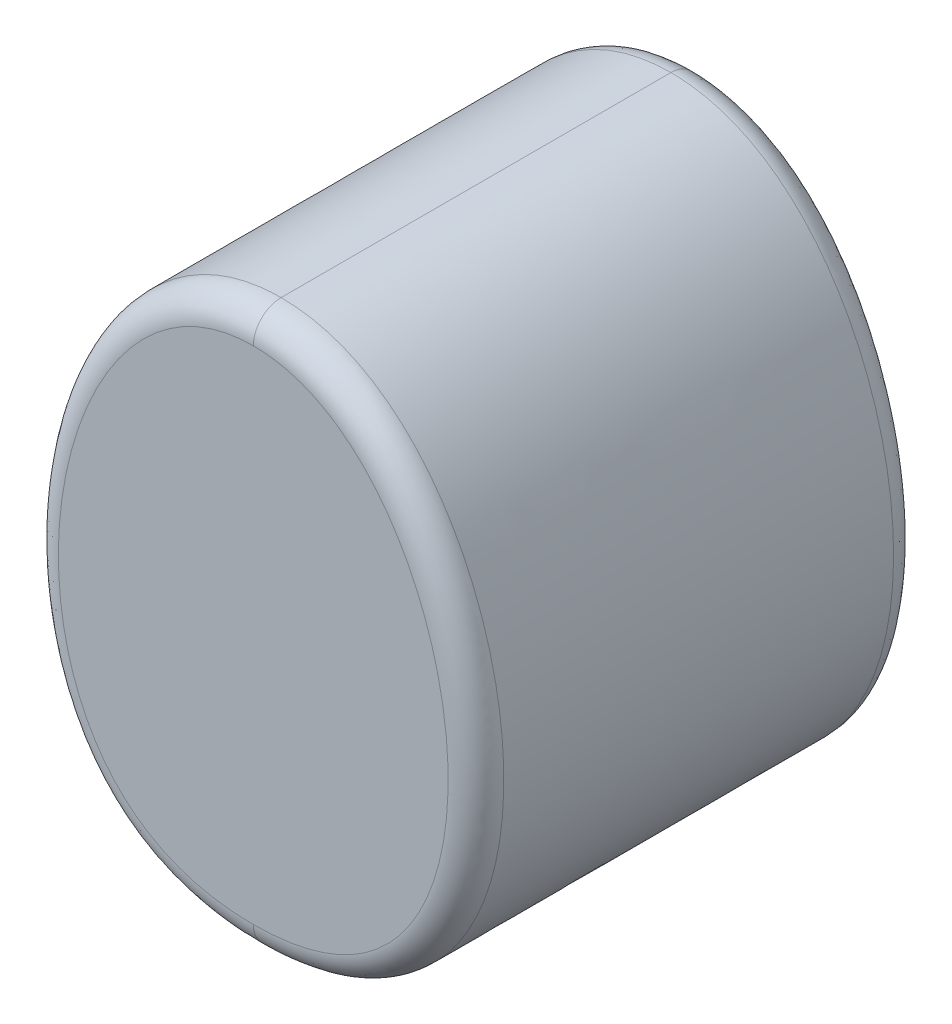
ISO-10303-21;
HEADER;
FILE_DESCRIPTION(('STEP AP214'),'2;1');
FILE_NAME('part.step','',(''),(''),'','','');
FILE_SCHEMA(('AUTOMOTIVE_DESIGN { 1 0 10303 214 1 1 1 1 }'));
ENDSEC;
DATA;
#1=APPLICATION_CONTEXT('core data for automotive mechanical design processes');
#2=APPLICATION_PROTOCOL_DEFINITION('international standard','automotive_design',2000,#1);
#3=PRODUCT_CONTEXT('',#1,'mechanical');
#4=PRODUCT('Part','Part','',(#3));
#5=PRODUCT_RELATED_PRODUCT_CATEGORY('part','',(#4));
#6=PRODUCT_DEFINITION_FORMATION('','',#4);
#7=PRODUCT_DEFINITION_CONTEXT('part definition',#1,'design');
#8=PRODUCT_DEFINITION('design','',#6,#7);
#9=PRODUCT_DEFINITION_SHAPE('','',#8);
#10=(LENGTH_UNIT() NAMED_UNIT(*) SI_UNIT(.MILLI.,.METRE.));
#11=(NAMED_UNIT(*) PLANE_ANGLE_UNIT() SI_UNIT($,.RADIAN.));
#12=(NAMED_UNIT(*) SI_UNIT($,.STERADIAN.) SOLID_ANGLE_UNIT());
#13=UNCERTAINTY_MEASURE_WITH_UNIT(LENGTH_MEASURE(1.E-05),#10,'distance_accuracy_value','');
#14=(GEOMETRIC_REPRESENTATION_CONTEXT(3) GLOBAL_UNCERTAINTY_ASSIGNED_CONTEXT((#13)) GLOBAL_UNIT_ASSIGNED_CONTEXT((#10,
#11,#12)) REPRESENTATION_CONTEXT('',''));
#15=CARTESIAN_POINT('',(0.,0.,0.));
#16=DIRECTION('',(0.,0.,1.));
#17=DIRECTION('',(1.,0.,0.));
#18=AXIS2_PLACEMENT_3D('',#15,#16,#17);
#19=CARTESIAN_POINT('',(-169.4648,86.5056,32.));
#20=CARTESIAN_POINT('',(-145.343,86.5056,32.));
#21=CARTESIAN_POINT('',(-151.1143,126.5056,32.));
#22=CARTESIAN_POINT('',(-169.4648,126.5056,32.));
#23=B_SPLINE_CURVE_WITH_KNOTS('',3,(#19,#20,#21,#22),.UNSPECIFIED.,.F.,.F.,(4,4),(0.,0.5),.UNSPECIFIED.);
#24=DIRECTION('',(0.,0.,-1.));
#25=VECTOR('',#24,1.);
#26=SURFACE_OF_LINEAR_EXTRUSION('',#23,#25);
#27=DIRECTION('',(0.,0.,-1.));
#28=VECTOR('',#27,1.);
#29=CARTESIAN_POINT('',(-169.4648,86.5056,32.));
#30=LINE('',#29,#28);
#31=CARTESIAN_POINT('',(-169.4648,86.5056,30.));
#32=VERTEX_POINT('',#31);
#33=CARTESIAN_POINT('',(-169.4648,86.5056,2.));
#34=VERTEX_POINT('',#33);
#35=EDGE_CURVE('E87',#32,#34,#30,.T.);
#36=ORIENTED_EDGE('',*,*,#35,.T.);
#37=CARTESIAN_POINT('',(-195.939359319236,88.5056,0.));
#38=CARTESIAN_POINT('',(-195.939359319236,86.5056,0.));
#39=CARTESIAN_POINT('',(-195.939359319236,86.5056,2.));
#40=CARTESIAN_POINT('',(-187.114506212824,88.5056,0.));
#41=CARTESIAN_POINT('',(-187.114506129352,86.5056,0.));
#42=CARTESIAN_POINT('',(-187.114506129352,86.5056,2.));
#43=CARTESIAN_POINT('',(-178.289653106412,88.5056,0.));
#44=CARTESIAN_POINT('',(-178.289652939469,86.5056,0.));
#45=CARTESIAN_POINT('',(-178.289652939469,86.5056,2.));
#46=CARTESIAN_POINT('',(-169.4648,88.5056,0.));
#47=CARTESIAN_POINT('',(-169.464799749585,86.5056,0.));
#48=CARTESIAN_POINT('',(-169.464799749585,86.5056,2.));
#49=CARTESIAN_POINT('',(-169.083627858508,88.5056144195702,0.));
#50=CARTESIAN_POINT('',(-169.045193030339,86.5056423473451,0.));
#51=CARTESIAN_POINT('',(-169.045193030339,86.5056423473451,2.));
#52=CARTESIAN_POINT('',(-168.702282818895,88.5165984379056,0.));
#53=CARTESIAN_POINT('',(-168.623339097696,86.5177091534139,0.));
#54=CARTESIAN_POINT('',(-168.623339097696,86.5177091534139,2.));
#55=CARTESIAN_POINT('',(-167.940570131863,88.5629710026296,0.));
#56=CARTESIAN_POINT('',(-167.776338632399,86.5692588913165,0.));
#57=CARTESIAN_POINT('',(-167.776338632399,86.5692588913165,2.));
#58=CARTESIAN_POINT('',(-167.560204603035,88.5983937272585,0.));
#59=CARTESIAN_POINT('',(-167.351188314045,86.6087802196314,0.));
#60=CARTESIAN_POINT('',(-167.351188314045,86.6087802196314,2.));
#61=CARTESIAN_POINT('',(-166.798995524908,88.6966204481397,0.));
#62=CARTESIAN_POINT('',(-166.495647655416,86.7191842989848,0.));
#63=CARTESIAN_POINT('',(-166.495647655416,86.7191842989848,2.));
#64=CARTESIAN_POINT('',(-166.418186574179,88.7596996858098,0.));
#65=CARTESIAN_POINT('',(-166.065248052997,86.790382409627,0.));
#66=CARTESIAN_POINT('',(-166.065248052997,86.790382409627,2.));
#67=CARTESIAN_POINT('',(-165.662817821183,88.9157111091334,0.));
#68=CARTESIAN_POINT('',(-165.206716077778,86.9677009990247,0.));
#69=CARTESIAN_POINT('',(-165.206716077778,86.9677009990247,2.));
#70=CARTESIAN_POINT('',(-165.28825565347,89.0086317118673,0.));
#71=CARTESIAN_POINT('',(-164.778582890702,87.0738079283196,0.));
#72=CARTESIAN_POINT('',(-164.778582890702,87.0738079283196,2.));
#73=CARTESIAN_POINT('',(-164.545037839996,89.2274267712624,0.));
#74=CARTESIAN_POINT('',(-163.924605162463,87.3252123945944,0.));
#75=CARTESIAN_POINT('',(-163.924605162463,87.3252123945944,2.));
#76=CARTESIAN_POINT('',(-164.176468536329,89.3535972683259,0.));
#77=CARTESIAN_POINT('',(-163.498818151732,87.4708623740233,0.));
#78=CARTESIAN_POINT('',(-163.498818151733,87.4708623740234,2.));
#79=CARTESIAN_POINT('',(-163.452664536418,89.6399138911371,0.));
#80=CARTESIAN_POINT('',(-162.658984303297,87.8030807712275,0.));
#81=CARTESIAN_POINT('',(-162.658984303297,87.8030807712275,2.));
#82=CARTESIAN_POINT('',(-163.097430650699,89.8000620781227,0.));
#83=CARTESIAN_POINT('',(-162.244938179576,87.9896516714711,0.));
#84=CARTESIAN_POINT('',(-162.244938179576,87.9896516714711,2.));
#85=CARTESIAN_POINT('',(-162.406271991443,90.1537165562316,0.));
#86=CARTESIAN_POINT('',(-161.437022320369,88.4030518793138,0.));
#87=CARTESIAN_POINT('',(-161.437022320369,88.4030518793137,2.));
#88=CARTESIAN_POINT('',(-162.070255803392,90.3470436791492,0.));
#89=CARTESIAN_POINT('',(-161.04305824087,88.6296651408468,0.));
#90=CARTESIAN_POINT('',(-161.04305824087,88.6296651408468,2.));
#91=CARTESIAN_POINT('',(-161.419463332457,90.7666103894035,0.));
#92=CARTESIAN_POINT('',(-160.27927458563,89.1220792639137,0.));
#93=CARTESIAN_POINT('',(-160.27927458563,89.1220792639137,2.));
#94=CARTESIAN_POINT('',(-161.104684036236,90.9928452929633,0.));
#95=CARTESIAN_POINT('',(-159.909451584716,89.3878745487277,0.));
#96=CARTESIAN_POINT('',(-159.909451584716,89.3878745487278,2.));
#97=CARTESIAN_POINT('',(-160.537989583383,91.4452405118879,0.));
#98=CARTESIAN_POINT('',(-159.244293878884,89.9188686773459,0.));
#99=CARTESIAN_POINT('',(-159.244293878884,89.918868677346,2.));
#100=CARTESIAN_POINT('',(-160.283164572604,91.6677720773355,0.));
#101=CARTESIAN_POINT('',(-158.945460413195,90.1798687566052,0.));
#102=CARTESIAN_POINT('',(-158.945460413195,90.1798687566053,2.));
#103=CARTESIAN_POINT('',(-159.793701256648,92.1339623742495,0.));
#104=CARTESIAN_POINT('',(-158.372684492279,90.7254094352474,0.));
#105=CARTESIAN_POINT('',(-158.372684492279,90.7254094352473,2.));
#106=CARTESIAN_POINT('',(-159.559060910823,92.3776189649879,0.));
#107=CARTESIAN_POINT('',(-158.098739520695,91.0099476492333,0.));
#108=CARTESIAN_POINT('',(-158.098739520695,91.0099476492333,2.));
#109=CARTESIAN_POINT('',(-159.110390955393,92.8840821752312,0.));
#110=CARTESIAN_POINT('',(-157.576531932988,91.5994179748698,0.));
#111=CARTESIAN_POINT('',(-157.576531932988,91.5994179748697,2.));
#112=CARTESIAN_POINT('',(-158.896405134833,93.1469274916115,0.));
#113=CARTESIAN_POINT('',(-157.328323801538,91.9043911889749,0.));
#114=CARTESIAN_POINT('',(-157.328323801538,91.9043911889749,2.));
#115=CARTESIAN_POINT('',(-158.489871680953,93.6886998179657,0.));
#116=CARTESIAN_POINT('',(-156.858512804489,92.530489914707,0.));
#117=CARTESIAN_POINT('',(-156.858512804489,92.530489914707,2.));
#118=CARTESIAN_POINT('',(-158.297327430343,93.9676293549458,0.));
#119=CARTESIAN_POINT('',(-156.636914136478,92.8516179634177,0.));
#120=CARTESIAN_POINT('',(-156.636914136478,92.8516179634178,2.));
#121=CARTESIAN_POINT('',(-157.879123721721,94.6244274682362,0.));
#122=CARTESIAN_POINT('',(-156.157503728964,93.604538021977,0.));
#123=CARTESIAN_POINT('',(-156.157503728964,93.604538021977,2.));
#124=CARTESIAN_POINT('',(-157.660763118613,95.0069532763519,0.));
#125=CARTESIAN_POINT('',(-155.90865975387,94.0407226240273,0.));
#126=CARTESIAN_POINT('',(-155.90865975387,94.0407226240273,2.));
#127=CARTESIAN_POINT('',(-157.258661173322,95.7897584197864,0.));
#128=CARTESIAN_POINT('',(-155.452692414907,94.9283887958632,0.));
#129=CARTESIAN_POINT('',(-155.452692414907,94.9283887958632,2.));
#130=CARTESIAN_POINT('',(-157.074929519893,96.1900426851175,0.));
#131=CARTESIAN_POINT('',(-155.245580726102,95.3798746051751,0.));
#132=CARTESIAN_POINT('',(-155.245580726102,95.3798746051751,2.));
#133=CARTESIAN_POINT('',(-156.74009310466,97.0045332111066,0.));
#134=CARTESIAN_POINT('',(-154.869837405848,96.2938703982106,0.));
#135=CARTESIAN_POINT('',(-154.869837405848,96.2938703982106,2.));
#136=CARTESIAN_POINT('',(-156.589028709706,97.4187559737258,0.));
#137=CARTESIAN_POINT('',(-154.701253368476,96.7563932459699,0.));
#138=CARTESIAN_POINT('',(-154.701253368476,96.7563932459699,2.));
#139=CARTESIAN_POINT('',(-156.317819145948,98.2571200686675,0.));
#140=CARTESIAN_POINT('',(-154.399779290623,97.688316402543,0.));
#141=CARTESIAN_POINT('',(-154.399779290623,97.688316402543,2.));
#142=CARTESIAN_POINT('',(-156.197675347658,98.6812618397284,0.));
#143=CARTESIAN_POINT('',(-154.26689083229,98.1577170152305,0.));
#144=CARTESIAN_POINT('',(-154.26689083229,98.1577170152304,2.));
#145=CARTESIAN_POINT('',(-155.940849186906,99.7207229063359,0.));
#146=CARTESIAN_POINT('',(-153.983741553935,99.3036930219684,0.));
#147=CARTESIAN_POINT('',(-153.983741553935,99.3036930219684,2.));
#148=CARTESIAN_POINT('',(-155.819282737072,100.33979890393,0.));
#149=CARTESIAN_POINT('',(-153.850596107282,99.9825321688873,0.));
#150=CARTESIAN_POINT('',(-153.850596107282,99.9825321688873,2.));
#151=CARTESIAN_POINT('',(-155.630196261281,101.586182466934,0.));
#152=CARTESIAN_POINT('',(-153.644128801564,101.343515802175,0.));
#153=CARTESIAN_POINT('',(-153.644128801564,101.343515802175,2.));
#154=CARTESIAN_POINT('',(-155.562699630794,102.213493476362,0.));
#155=CARTESIAN_POINT('',(-153.570832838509,102.025661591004,0.));
#156=CARTESIAN_POINT('',(-153.57083283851,102.025661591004,2.));
#157=CARTESIAN_POINT('',(-155.477593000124,103.472161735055,0.));
#158=CARTESIAN_POINT('',(-153.478568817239,103.390198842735,0.));
#159=CARTESIAN_POINT('',(-153.478568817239,103.390198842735,2.));
#160=CARTESIAN_POINT('',(-155.4600425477,104.103522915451,0.));
#161=CARTESIAN_POINT('',(-153.459665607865,104.072589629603,0.));
#162=CARTESIAN_POINT('',(-153.459665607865,104.072589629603,2.));
#163=CARTESIAN_POINT('',(-155.471834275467,105.365649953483,0.));
#164=CARTESIAN_POINT('',(-153.472385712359,105.433945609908,0.));
#165=CARTESIAN_POINT('',(-153.472385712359,105.433945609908,2.));
#166=CARTESIAN_POINT('',(-155.501170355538,105.99641587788,0.));
#167=CARTESIAN_POINT('',(-153.504002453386,106.112911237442,0.));
#168=CARTESIAN_POINT('',(-153.504002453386,106.112911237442,2.));
#169=CARTESIAN_POINT('',(-155.606266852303,107.275525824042,0.));
#170=CARTESIAN_POINT('',(-153.616999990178,107.488181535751,0.));
#171=CARTESIAN_POINT('',(-153.616999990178,107.488181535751,2.));
#172=CARTESIAN_POINT('',(-155.683563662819,107.92374294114,0.));
#173=CARTESIAN_POINT('',(-153.700027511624,108.184296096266,0.));
#174=CARTESIAN_POINT('',(-153.700027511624,108.184296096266,2.));
#175=CARTESIAN_POINT('',(-155.884490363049,109.213012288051,0.));
#176=CARTESIAN_POINT('',(-153.915735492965,109.568410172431,0.));
#177=CARTESIAN_POINT('',(-153.915735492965,109.568410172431,2.));
#178=CARTESIAN_POINT('',(-156.008125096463,109.854063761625,0.));
#179=CARTESIAN_POINT('',(-154.048421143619,110.256408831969,0.));
#180=CARTESIAN_POINT('',(-154.048421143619,110.256408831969,2.));
#181=CARTESIAN_POINT('',(-156.30118579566,111.125255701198,0.));
#182=CARTESIAN_POINT('',(-154.363124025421,111.621477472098,0.));
#183=CARTESIAN_POINT('',(-154.363124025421,111.621477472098,2.));
#184=CARTESIAN_POINT('',(-156.470586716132,111.755401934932,0.));
#185=CARTESIAN_POINT('',(-154.545114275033,112.29855321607,0.));
#186=CARTESIAN_POINT('',(-154.545114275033,112.29855321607,2.));
#187=CARTESIAN_POINT('',(-156.855656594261,113.001350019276,0.));
#188=CARTESIAN_POINT('',(-154.959481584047,113.639304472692,0.));
#189=CARTESIAN_POINT('',(-154.959481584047,113.639304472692,2.));
#190=CARTESIAN_POINT('',(-157.071316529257,113.617154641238,0.));
#191=CARTESIAN_POINT('',(-155.191848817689,114.302982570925,0.));
#192=CARTESIAN_POINT('',(-155.191848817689,114.302982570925,2.));
#193=CARTESIAN_POINT('',(-157.506932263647,114.720167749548,0.));
#194=CARTESIAN_POINT('',(-155.662532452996,115.49478582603,0.));
#195=CARTESIAN_POINT('',(-155.662532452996,115.49478582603,2.));
#196=CARTESIAN_POINT('',(-157.719046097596,115.210478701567,0.));
#197=CARTESIAN_POINT('',(-155.892160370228,116.025704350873,0.));
#198=CARTESIAN_POINT('',(-155.892160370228,116.025704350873,2.));
#199=CARTESIAN_POINT('',(-158.176503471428,116.175475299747,0.));
#200=CARTESIAN_POINT('',(-156.388953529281,117.073683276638,0.));
#201=CARTESIAN_POINT('',(-156.38895352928,117.073683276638,2.));
#202=CARTESIAN_POINT('',(-158.421848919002,116.650160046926,0.));
#203=CARTESIAN_POINT('',(-156.656120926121,117.590742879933,0.));
#204=CARTESIAN_POINT('',(-156.656120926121,117.590742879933,2.));
#205=CARTESIAN_POINT('',(-158.947091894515,117.57951086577,0.));
#206=CARTESIAN_POINT('',(-157.23048188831,118.607003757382,0.));
#207=CARTESIAN_POINT('',(-157.23048188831,118.607003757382,2.));
#208=CARTESIAN_POINT('',(-159.226957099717,118.034195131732,0.));
#209=CARTESIAN_POINT('',(-157.537638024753,119.106221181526,0.));
#210=CARTESIAN_POINT('',(-157.537638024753,119.106221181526,2.));
#211=CARTESIAN_POINT('',(-159.823254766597,118.918907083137,0.));
#212=CARTESIAN_POINT('',(-158.19562831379,120.082473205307,0.));
#213=CARTESIAN_POINT('',(-158.19562831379,120.082473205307,2.));
#214=CARTESIAN_POINT('',(-160.139672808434,119.348944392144,0.));
#215=CARTESIAN_POINT('',(-158.5464452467,120.559516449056,0.));
#216=CARTESIAN_POINT('',(-158.5464452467,120.559516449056,2.));
#217=CARTESIAN_POINT('',(-160.707228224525,120.049703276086,0.));
#218=CARTESIAN_POINT('',(-159.179993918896,121.341748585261,0.));
#219=CARTESIAN_POINT('',(-159.179993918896,121.341748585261,2.));
#220=CARTESIAN_POINT('',(-160.948316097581,120.328585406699,0.));
#221=CARTESIAN_POINT('',(-159.450256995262,121.654483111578,0.));
#222=CARTESIAN_POINT('',(-159.450256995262,121.654483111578,2.));
#223=CARTESIAN_POINT('',(-161.449476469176,120.868817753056,0.));
#224=CARTESIAN_POINT('',(-160.015047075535,122.263308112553,0.));
#225=CARTESIAN_POINT('',(-160.015047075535,122.263308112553,2.));
#226=CARTESIAN_POINT('',(-161.709548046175,121.130168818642,0.));
#227=CARTESIAN_POINT('',(-160.309572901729,122.559399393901,0.));
#228=CARTESIAN_POINT('',(-160.309572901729,122.559399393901,2.));
#229=CARTESIAN_POINT('',(-162.248624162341,121.631789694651,0.));
#230=CARTESIAN_POINT('',(-160.923674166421,123.130832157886,0.));
#231=CARTESIAN_POINT('',(-160.923674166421,123.130832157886,2.));
#232=CARTESIAN_POINT('',(-162.527599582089,121.872090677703,0.));
#233=CARTESIAN_POINT('',(-161.243211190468,123.406204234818,0.));
#234=CARTESIAN_POINT('',(-161.243211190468,123.406204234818,2.));
#235=CARTESIAN_POINT('',(-163.104794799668,122.328387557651,0.));
#236=CARTESIAN_POINT('',(-161.90850422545,123.932144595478,0.));
#237=CARTESIAN_POINT('',(-161.90850422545,123.932144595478,2.));
#238=CARTESIAN_POINT('',(-163.403010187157,122.54438899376,0.));
#239=CARTESIAN_POINT('',(-162.254254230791,124.182718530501,0.));
#240=CARTESIAN_POINT('',(-162.254254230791,124.182718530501,2.));
#241=CARTESIAN_POINT('',(-163.959740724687,122.909831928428,0.));
#242=CARTESIAN_POINT('',(-162.903793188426,124.609079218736,0.));
#243=CARTESIAN_POINT('',(-162.903793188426,124.609079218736,2.));
#244=CARTESIAN_POINT('',(-164.215070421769,123.064129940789,0.));
#245=CARTESIAN_POINT('',(-163.203118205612,124.790040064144,0.));
#246=CARTESIAN_POINT('',(-163.203118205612,124.790040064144,2.));
#247=CARTESIAN_POINT('',(-164.737168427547,123.351938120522,0.));
#248=CARTESIAN_POINT('',(-163.818041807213,125.129017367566,0.));
#249=CARTESIAN_POINT('',(-163.818041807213,125.129017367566,2.));
#250=CARTESIAN_POINT('',(-165.003934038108,123.485453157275,0.));
#251=CARTESIAN_POINT('',(-164.133636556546,125.287039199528,0.));
#252=CARTESIAN_POINT('',(-164.133636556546,125.287039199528,2.));
#253=CARTESIAN_POINT('',(-165.547483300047,123.729533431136,0.));
#254=CARTESIAN_POINT('',(-164.779156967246,125.576907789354,0.));
#255=CARTESIAN_POINT('',(-164.779156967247,125.576907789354,2.));
#256=CARTESIAN_POINT('',(-165.824257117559,123.840120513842,0.));
#257=CARTESIAN_POINT('',(-165.109068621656,125.70877945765,0.));
#258=CARTESIAN_POINT('',(-165.109068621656,125.70877945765,2.));
#259=CARTESIAN_POINT('',(-166.386369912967,124.036740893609,0.));
#260=CARTESIAN_POINT('',(-165.780817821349,125.943746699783,0.));
#261=CARTESIAN_POINT('',(-165.780817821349,125.943746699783,2.));
#262=CARTESIAN_POINT('',(-166.671706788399,124.122780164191,0.));
#263=CARTESIAN_POINT('',(-166.12265244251,126.046849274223,0.));
#264=CARTESIAN_POINT('',(-166.12265244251,126.046849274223,2.));
#265=CARTESIAN_POINT('',(-167.164476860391,124.247748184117,0.));
#266=CARTESIAN_POINT('',(-166.713516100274,126.196696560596,0.));
#267=CARTESIAN_POINT('',(-166.713516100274,126.196696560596,2.));
#268=CARTESIAN_POINT('',(-167.370305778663,124.293096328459,0.));
#269=CARTESIAN_POINT('',(-166.960470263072,126.251105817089,0.));
#270=CARTESIAN_POINT('',(-166.960470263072,126.251105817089,2.));
#271=CARTESIAN_POINT('',(-167.784397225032,124.370728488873,0.));
#272=CARTESIAN_POINT('',(-167.457154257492,126.344221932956,0.));
#273=CARTESIAN_POINT('',(-167.457154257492,126.344221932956,2.));
#274=CARTESIAN_POINT('',(-167.992659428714,124.403014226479,0.));
#275=CARTESIAN_POINT('',(-167.706883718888,126.382930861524,0.));
#276=CARTESIAN_POINT('',(-167.706883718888,126.382930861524,2.));
#277=CARTESIAN_POINT('',(-168.411167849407,124.454549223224,0.));
#278=CARTESIAN_POINT('',(-168.208121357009,126.444651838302,0.));
#279=CARTESIAN_POINT('',(-168.208121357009,126.444651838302,2.));
#280=CARTESIAN_POINT('',(-168.621417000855,124.473774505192,0.));
#281=CARTESIAN_POINT('',(-168.459631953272,126.467635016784,0.));
#282=CARTESIAN_POINT('',(-168.459631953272,126.467635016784,2.));
#283=CARTESIAN_POINT('',(-169.042716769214,124.49931568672,0.));
#284=CARTESIAN_POINT('',(-168.962605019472,126.498134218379,0.));
#285=CARTESIAN_POINT('',(-168.962605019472,126.498134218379,2.));
#286=CARTESIAN_POINT('',(-169.253767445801,124.505630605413,0.));
#287=CARTESIAN_POINT('',(-169.214067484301,126.505649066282,0.));
#288=CARTESIAN_POINT('',(-169.214067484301,126.505649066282,2.));
#289=CARTESIAN_POINT('',(-169.4648,124.5056,0.));
#290=CARTESIAN_POINT('',(-169.4648,126.5056,0.));
#291=CARTESIAN_POINT('',(-169.4648,126.5056,2.));
#292=CARTESIAN_POINT('',(-178.289653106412,124.5056,0.));
#293=CARTESIAN_POINT('',(-178.289653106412,126.5056,0.));
#294=CARTESIAN_POINT('',(-178.289653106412,126.5056,2.));
#295=CARTESIAN_POINT('',(-187.114506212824,124.5056,0.));
#296=CARTESIAN_POINT('',(-187.114506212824,126.5056,0.));
#297=CARTESIAN_POINT('',(-187.114506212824,126.5056,2.));
#298=CARTESIAN_POINT('',(-195.939359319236,124.5056,0.));
#299=CARTESIAN_POINT('',(-195.939359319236,126.5056,0.));
#300=CARTESIAN_POINT('',(-195.939359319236,126.5056,2.));
#301=(BOUNDED_SURFACE() B_SPLINE_SURFACE(3,2,((#37,#38,#39),(#40,#41,#42),(#43,#44,#45),(#46,
#47,#48),(#49,#50,#51),(#52,#53,#54),(#55,#56,#57),(#58,#59,#60),(#61,#62,#63),(#64,#65,#66),
(#67,#68,#69),(#70,#71,#72),(#73,#74,#75),(#76,#77,#78),(#79,#80,#81),(#82,#83,#84),(#85,#86,
#87),(#88,#89,#90),(#91,#92,#93),(#94,#95,#96),(#97,#98,#99),(#100,#101,#102),(#103,#104,#105),
(#106,#107,#108),(#109,#110,#111),(#112,#113,#114),(#115,#116,#117),(#118,#119,#120),(#121,#122,
#123),(#124,#125,#126),(#127,#128,#129),(#130,#131,#132),(#133,#134,#135),(#136,#137,#138),
(#139,#140,#141),(#142,#143,#144),(#145,#146,#147),(#148,#149,#150),(#151,#152,#153),(#154,#155,
#156),(#157,#158,#159),(#160,#161,#162),(#163,#164,#165),(#166,#167,#168),(#169,#170,#171),
(#172,#173,#174),(#175,#176,#177),(#178,#179,#180),(#181,#182,#183),(#184,#185,#186),(#187,#188,
#189),(#190,#191,#192),(#193,#194,#195),(#196,#197,#198),(#199,#200,#201),(#202,#203,#204),
(#205,#206,#207),(#208,#209,#210),(#211,#212,#213),(#214,#215,#216),(#217,#218,#219),(#220,#221,
#222),(#223,#224,#225),(#226,#227,#228),(#229,#230,#231),(#232,#233,#234),(#235,#236,#237),
(#238,#239,#240),(#241,#242,#243),(#244,#245,#246),(#247,#248,#249),(#250,#251,#252),(#253,#254,
#255),(#256,#257,#258),(#259,#260,#261),(#262,#263,#264),(#265,#266,#267),(#268,#269,#270),
(#271,#272,#273),(#274,#275,#276),(#277,#278,#279),(#280,#281,#282),(#283,#284,#285),(#286,#287,
#288),(#289,#290,#291),(#292,#293,#294),(#295,#296,#297),(#298,#299,#300)),.UNSPECIFIED.,.F.,
.F.,.F.) B_SPLINE_SURFACE_WITH_KNOTS((4,3,2,2,2,2,2,2,2,2,2,2,2,2,2,2,2,2,2,2,2,2,2,2,2,2,2,2,2,
2,2,2,2,2,2,2,2,2,2,2,2,3,4),(3,3),(0.,26.4745593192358,27.6181767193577,28.7633967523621,
29.9202824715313,31.0767196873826,32.2438231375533,33.4109974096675,34.5720565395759,
35.7329505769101,36.7466280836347,37.7602029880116,38.7758816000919,39.7917202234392,
41.1111292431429,42.4309068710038,43.7523061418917,45.073763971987,46.9636451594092,
48.8543436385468,50.7472953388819,52.6400007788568,54.5967122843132,56.5536283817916,
58.5094757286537,60.4649419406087,62.0664882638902,63.6681265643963,65.2682763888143,
66.8677971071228,67.9729515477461,69.0780523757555,70.1814879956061,71.2846715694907,
72.1788069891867,73.0727325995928,73.9658025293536,74.8586549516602,75.4905613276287,
76.1223843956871,76.7553642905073,77.3883922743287,103.862951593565),(0.,1.),
.UNSPECIFIED.) GEOMETRIC_REPRESENTATION_ITEM() RATIONAL_B_SPLINE_SURFACE(((1.,0.707106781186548,
1.),(1.,0.707106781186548,1.),(1.,0.707106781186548,1.),(1.,0.707106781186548,1.),(1.,
0.707106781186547,1.),(1.,0.707106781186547,1.),(1.,0.707106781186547,1.),(1.,0.707106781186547,
1.),(1.,0.707106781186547,1.),(1.,0.707106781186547,1.),(1.,0.707106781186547,1.),(1.,
0.707106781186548,1.),(1.,0.707106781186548,1.),(1.,0.707106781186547,1.),(1.,0.707106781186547,
1.),(1.,0.707106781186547,1.),(1.,0.707106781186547,1.),(1.,0.707106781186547,1.),(1.,
0.707106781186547,1.),(1.,0.707106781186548,1.),(1.,0.707106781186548,1.),(1.,0.707106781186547,
1.),(1.,0.707106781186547,1.),(1.,0.707106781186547,1.),(1.,0.707106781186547,1.),(1.,
0.707106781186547,1.),(1.,0.707106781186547,1.),(1.,0.707106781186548,1.),(1.,0.707106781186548,
1.),(1.,0.707106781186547,1.),(1.,0.707106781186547,1.),(1.,0.707106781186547,1.),(1.,
0.707106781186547,1.),(1.,0.707106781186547,1.),(1.,0.707106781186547,1.),(1.,0.707106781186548,
1.),(1.,0.707106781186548,1.),(1.,0.707106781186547,1.),(1.,0.707106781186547,1.),(1.,
0.707106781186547,1.),(1.,0.707106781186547,1.),(1.,0.707106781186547,1.),(1.,0.707106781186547,
1.),(1.,0.707106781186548,1.),(1.,0.707106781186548,1.),(1.,0.707106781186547,1.),(1.,
0.707106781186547,1.),(1.,0.707106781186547,1.),(1.,0.707106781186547,1.),(1.,0.707106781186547,
1.),(1.,0.707106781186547,1.),(1.,0.707106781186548,1.),(1.,0.707106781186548,1.),(1.,
0.707106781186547,1.),(1.,0.707106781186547,1.),(1.,0.707106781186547,1.),(1.,0.707106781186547,
1.),(1.,0.707106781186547,1.),(1.,0.707106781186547,1.),(1.,0.707106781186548,1.),(1.,
0.707106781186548,1.),(1.,0.707106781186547,1.),(1.,0.707106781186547,1.),(1.,0.707106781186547,
1.),(1.,0.707106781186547,1.),(1.,0.707106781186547,1.),(1.,0.707106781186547,1.),(1.,
0.707106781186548,1.),(1.,0.707106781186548,1.),(1.,0.707106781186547,1.),(1.,0.707106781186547,
1.),(1.,0.707106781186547,1.),(1.,0.707106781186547,1.),(1.,0.707106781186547,1.),(1.,
0.707106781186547,1.),(1.,0.707106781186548,1.),(1.,0.707106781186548,1.),(1.,0.707106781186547,
1.),(1.,0.707106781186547,1.),(1.,0.707106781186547,1.),(1.,0.707106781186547,1.),(1.,
0.707106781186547,1.),(1.,0.707106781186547,1.),(1.,0.707106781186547,1.),(1.,0.707106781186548,
1.),(1.,0.707106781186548,1.),(1.,0.707106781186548,1.),(1.,0.707106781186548,1.))) REPRESENTATION_ITEM('') SURFACE());
#302=CARTESIAN_POINT('',(-195.939359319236,86.5056,2.));
#303=CARTESIAN_POINT('',(-187.114506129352,86.5056,2.));
#304=CARTESIAN_POINT('',(-178.289652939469,86.5056,2.));
#305=CARTESIAN_POINT('',(-169.464799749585,86.5056,2.));
#306=CARTESIAN_POINT('',(-169.045193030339,86.5056423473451,2.));
#307=CARTESIAN_POINT('',(-168.623339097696,86.5177091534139,2.));
#308=CARTESIAN_POINT('',(-167.776338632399,86.5692588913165,2.));
#309=CARTESIAN_POINT('',(-167.351188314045,86.6087802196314,2.));
#310=CARTESIAN_POINT('',(-166.495647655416,86.7191842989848,2.));
#311=CARTESIAN_POINT('',(-166.065248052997,86.790382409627,2.));
#312=CARTESIAN_POINT('',(-165.206716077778,86.9677009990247,2.));
#313=CARTESIAN_POINT('',(-164.778582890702,87.0738079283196,2.));
#314=CARTESIAN_POINT('',(-163.924605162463,87.3252123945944,2.));
#315=CARTESIAN_POINT('',(-163.498818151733,87.4708623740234,2.));
#316=CARTESIAN_POINT('',(-162.658984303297,87.8030807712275,2.));
#317=CARTESIAN_POINT('',(-162.244938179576,87.9896516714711,2.));
#318=CARTESIAN_POINT('',(-161.437022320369,88.4030518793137,2.));
#319=CARTESIAN_POINT('',(-161.04305824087,88.6296651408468,2.));
#320=CARTESIAN_POINT('',(-160.27927458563,89.1220792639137,2.));
#321=CARTESIAN_POINT('',(-159.909451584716,89.3878745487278,2.));
#322=CARTESIAN_POINT('',(-159.244293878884,89.918868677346,2.));
#323=CARTESIAN_POINT('',(-158.945460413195,90.1798687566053,2.));
#324=CARTESIAN_POINT('',(-158.372684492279,90.7254094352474,2.));
#325=CARTESIAN_POINT('',(-158.098739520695,91.0099476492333,2.));
#326=CARTESIAN_POINT('',(-157.576531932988,91.5994179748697,2.));
#327=CARTESIAN_POINT('',(-157.328323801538,91.9043911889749,2.));
#328=CARTESIAN_POINT('',(-156.858512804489,92.530489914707,2.));
#329=CARTESIAN_POINT('',(-156.636914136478,92.8516179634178,2.));
#330=CARTESIAN_POINT('',(-156.157503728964,93.604538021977,2.));
#331=CARTESIAN_POINT('',(-155.90865975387,94.0407226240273,2.));
#332=CARTESIAN_POINT('',(-155.452692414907,94.9283887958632,2.));
#333=CARTESIAN_POINT('',(-155.245580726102,95.379874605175,2.));
#334=CARTESIAN_POINT('',(-154.869837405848,96.2938703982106,2.));
#335=CARTESIAN_POINT('',(-154.701253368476,96.7563932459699,2.));
#336=CARTESIAN_POINT('',(-154.399779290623,97.688316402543,2.));
#337=CARTESIAN_POINT('',(-154.26689083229,98.1577170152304,2.));
#338=CARTESIAN_POINT('',(-153.983741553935,99.3036930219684,2.));
#339=CARTESIAN_POINT('',(-153.850596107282,99.9825321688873,2.));
#340=CARTESIAN_POINT('',(-153.644128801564,101.343515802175,2.));
#341=CARTESIAN_POINT('',(-153.57083283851,102.025661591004,2.));
#342=CARTESIAN_POINT('',(-153.478568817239,103.390198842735,2.));
#343=CARTESIAN_POINT('',(-153.459665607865,104.072589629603,2.));
#344=CARTESIAN_POINT('',(-153.472385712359,105.433945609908,2.));
#345=CARTESIAN_POINT('',(-153.504002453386,106.112911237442,2.));
#346=CARTESIAN_POINT('',(-153.616999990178,107.488181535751,2.));
#347=CARTESIAN_POINT('',(-153.700027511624,108.184296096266,2.));
#348=CARTESIAN_POINT('',(-153.915735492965,109.568410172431,2.));
#349=CARTESIAN_POINT('',(-154.048421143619,110.256408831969,2.));
#350=CARTESIAN_POINT('',(-154.363124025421,111.621477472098,2.));
#351=CARTESIAN_POINT('',(-154.545114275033,112.29855321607,2.));
#352=CARTESIAN_POINT('',(-154.959481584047,113.639304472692,2.));
#353=CARTESIAN_POINT('',(-155.191848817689,114.302982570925,2.));
#354=CARTESIAN_POINT('',(-155.662532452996,115.49478582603,2.));
#355=CARTESIAN_POINT('',(-155.892160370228,116.025704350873,2.));
#356=CARTESIAN_POINT('',(-156.38895352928,117.073683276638,2.));
#357=CARTESIAN_POINT('',(-156.656120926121,117.590742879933,2.));
#358=CARTESIAN_POINT('',(-157.23048188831,118.607003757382,2.));
#359=CARTESIAN_POINT('',(-157.537638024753,119.106221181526,2.));
#360=CARTESIAN_POINT('',(-158.19562831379,120.082473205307,2.));
#361=CARTESIAN_POINT('',(-158.5464452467,120.559516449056,2.));
#362=CARTESIAN_POINT('',(-159.179993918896,121.341748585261,2.));
#363=CARTESIAN_POINT('',(-159.450256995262,121.654483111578,2.));
#364=CARTESIAN_POINT('',(-160.015047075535,122.263308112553,2.));
#365=CARTESIAN_POINT('',(-160.309572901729,122.559399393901,2.));
#366=CARTESIAN_POINT('',(-160.923674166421,123.130832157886,2.));
#367=CARTESIAN_POINT('',(-161.243211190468,123.406204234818,2.));
#368=CARTESIAN_POINT('',(-161.90850422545,123.932144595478,2.));
#369=CARTESIAN_POINT('',(-162.254254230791,124.182718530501,2.));
#370=CARTESIAN_POINT('',(-162.903793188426,124.609079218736,2.));
#371=CARTESIAN_POINT('',(-163.203118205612,124.790040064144,2.));
#372=CARTESIAN_POINT('',(-163.818041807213,125.129017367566,2.));
#373=CARTESIAN_POINT('',(-164.133636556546,125.287039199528,2.));
#374=CARTESIAN_POINT('',(-164.779156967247,125.576907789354,2.));
#375=CARTESIAN_POINT('',(-165.109068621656,125.70877945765,2.));
#376=CARTESIAN_POINT('',(-165.780817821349,125.943746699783,2.));
#377=CARTESIAN_POINT('',(-166.12265244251,126.046849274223,2.));
#378=CARTESIAN_POINT('',(-166.713516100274,126.196696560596,2.));
#379=CARTESIAN_POINT('',(-166.960470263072,126.251105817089,2.));
#380=CARTESIAN_POINT('',(-167.457154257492,126.344221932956,2.));
#381=CARTESIAN_POINT('',(-167.706883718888,126.382930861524,2.));
#382=CARTESIAN_POINT('',(-168.208121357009,126.444651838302,2.));
#383=CARTESIAN_POINT('',(-168.459631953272,126.467635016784,2.));
#384=CARTESIAN_POINT('',(-168.962605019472,126.498134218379,2.));
#385=CARTESIAN_POINT('',(-169.214067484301,126.505649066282,2.));
#386=CARTESIAN_POINT('',(-169.4648,126.5056,2.));
#387=CARTESIAN_POINT('',(-178.289653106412,126.5056,2.));
#388=CARTESIAN_POINT('',(-187.114506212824,126.5056,2.));
#389=CARTESIAN_POINT('',(-195.939359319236,126.5056,2.));
#390=B_SPLINE_CURVE_WITH_KNOTS('',3,(#302,#303,#304,#305,#306,#307,#308,#309,#310,#311,#312,
#313,#314,#315,#316,#317,#318,#319,#320,#321,#322,#323,#324,#325,#326,#327,#328,#329,#330,#331,
#332,#333,#334,#335,#336,#337,#338,#339,#340,#341,#342,#343,#344,#345,#346,#347,#348,#349,#350,
#351,#352,#353,#354,#355,#356,#357,#358,#359,#360,#361,#362,#363,#364,#365,#366,#367,#368,#369,
#370,#371,#372,#373,#374,#375,#376,#377,#378,#379,#380,#381,#382,#383,#384,#385,#386,#387,#388,
#389),.UNSPECIFIED.,.F.,.F.,(4,3,2,2,2,2,2,2,2,2,2,2,2,2,2,2,2,2,2,2,2,2,2,2,2,2,2,2,2,2,2,2,2,
2,2,2,2,2,2,2,2,3,4),(0.,26.4745593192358,27.6181767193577,28.7633967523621,29.9202824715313,
31.0767196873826,32.2438231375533,33.4109974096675,34.5720565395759,35.7329505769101,
36.7466280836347,37.7602029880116,38.7758816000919,39.7917202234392,41.1111292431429,
42.4309068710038,43.7523061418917,45.073763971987,46.9636451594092,48.8543436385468,
50.7472953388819,52.6400007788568,54.5967122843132,56.5536283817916,58.5094757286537,
60.4649419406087,62.0664882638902,63.6681265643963,65.2682763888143,66.8677971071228,
67.9729515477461,69.0780523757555,70.1814879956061,71.2846715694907,72.1788069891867,
73.0727325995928,73.9658025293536,74.8586549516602,75.4905613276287,76.1223843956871,
76.7553642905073,77.3883922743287,103.862951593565),.UNSPECIFIED.);
#391=CARTESIAN_POINT('',(-169.4648,126.5056,2.));
#392=VERTEX_POINT('',#391);
#393=EDGE_CURVE('E92',#34,#392,#390,.T.);
#394=ORIENTED_EDGE('',*,*,#393,.T.);
#395=DIRECTION('',(0.,0.,-1.));
#396=VECTOR('',#395,1.);
#397=CARTESIAN_POINT('',(-169.4648,126.5056,32.));
#398=LINE('',#397,#396);
#399=CARTESIAN_POINT('',(-169.4648,126.5056,30.));
#400=VERTEX_POINT('',#399);
#401=EDGE_CURVE('E89',#400,#392,#398,.T.);
#402=ORIENTED_EDGE('',*,*,#401,.F.);
#403=CARTESIAN_POINT('',(-195.939359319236,124.5056,32.));
#404=CARTESIAN_POINT('',(-195.939359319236,126.5056,32.));
#405=CARTESIAN_POINT('',(-195.939359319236,126.5056,30.));
#406=CARTESIAN_POINT('',(-187.114506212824,124.5056,32.));
#407=CARTESIAN_POINT('',(-187.114506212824,126.5056,32.));
#408=CARTESIAN_POINT('',(-187.114506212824,126.5056,30.));
#409=CARTESIAN_POINT('',(-178.289653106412,124.5056,32.));
#410=CARTESIAN_POINT('',(-178.289653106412,126.5056,32.));
#411=CARTESIAN_POINT('',(-178.289653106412,126.5056,30.));
#412=CARTESIAN_POINT('',(-169.4648,124.5056,32.));
#413=CARTESIAN_POINT('',(-169.4648,126.5056,32.));
#414=CARTESIAN_POINT('',(-169.4648,126.5056,30.));
#415=CARTESIAN_POINT('',(-169.319990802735,124.505602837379,32.));
#416=CARTESIAN_POINT('',(-169.292742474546,126.505604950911,32.));
#417=CARTESIAN_POINT('',(-169.292742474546,126.505604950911,30.));
#418=CARTESIAN_POINT('',(-169.175195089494,124.50263927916,32.));
#419=CARTESIAN_POINT('',(-169.120374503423,126.502081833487,32.));
#420=CARTESIAN_POINT('',(-169.120374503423,126.502081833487,30.));
#421=CARTESIAN_POINT('',(-168.885845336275,124.490673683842,32.));
#422=CARTESIAN_POINT('',(-168.775396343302,126.487815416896,32.));
#423=CARTESIAN_POINT('',(-168.775396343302,126.487815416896,30.));
#424=CARTESIAN_POINT('',(-168.741291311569,124.481671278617,32.));
#425=CARTESIAN_POINT('',(-168.602786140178,126.477071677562,32.));
#426=CARTESIAN_POINT('',(-168.602786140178,126.477071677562,30.));
#427=CARTESIAN_POINT('',(-168.308427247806,124.445455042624,32.));
#428=CARTESIAN_POINT('',(-168.085295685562,126.433772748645,32.));
#429=CARTESIAN_POINT('',(-168.085295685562,126.433772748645,30.));
#430=CARTESIAN_POINT('',(-168.020827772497,124.409032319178,32.));
#431=CARTESIAN_POINT('',(-167.740651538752,126.390150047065,32.));
#432=CARTESIAN_POINT('',(-167.740651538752,126.390150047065,30.));
#433=CARTESIAN_POINT('',(-167.451895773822,124.311768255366,32.));
#434=CARTESIAN_POINT('',(-167.058388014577,126.273511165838,32.));
#435=CARTESIAN_POINT('',(-167.058388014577,126.273511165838,30.));
#436=CARTESIAN_POINT('',(-167.170533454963,124.251099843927,32.));
#437=CARTESIAN_POINT('',(-166.720736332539,126.200703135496,32.));
#438=CARTESIAN_POINT('',(-166.720736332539,126.200703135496,30.));
#439=CARTESIAN_POINT('',(-166.614073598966,124.105845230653,32.));
#440=CARTESIAN_POINT('',(-166.053598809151,126.026558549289,32.));
#441=CARTESIAN_POINT('',(-166.053598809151,126.026558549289,30.));
#442=CARTESIAN_POINT('',(-166.338975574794,124.021260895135,32.));
#443=CARTESIAN_POINT('',(-165.724112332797,125.925224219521,32.));
#444=CARTESIAN_POINT('',(-165.724112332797,125.925224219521,30.));
#445=CARTESIAN_POINT('',(-165.796819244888,123.829261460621,32.));
#446=CARTESIAN_POINT('',(-165.076356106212,125.695829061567,32.));
#447=CARTESIAN_POINT('',(-165.076356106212,125.695829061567,30.));
#448=CARTESIAN_POINT('',(-165.529762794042,123.721841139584,32.));
#449=CARTESIAN_POINT('',(-164.758088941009,125.567762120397,32.));
#450=CARTESIAN_POINT('',(-164.758088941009,125.567762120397,30.));
#451=CARTESIAN_POINT('',(-165.005228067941,123.485760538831,32.));
#452=CARTESIAN_POINT('',(-164.135197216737,125.287414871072,32.));
#453=CARTESIAN_POINT('',(-164.135197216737,125.287414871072,30.));
#454=CARTESIAN_POINT('',(-164.747750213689,123.357099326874,32.));
#455=CARTESIAN_POINT('',(-163.830573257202,125.135133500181,32.));
#456=CARTESIAN_POINT('',(-163.830573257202,125.135133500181,30.));
#457=CARTESIAN_POINT('',(-164.243141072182,123.080227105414,32.));
#458=CARTESIAN_POINT('',(-163.236116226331,124.808964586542,32.));
#459=CARTESIAN_POINT('',(-163.236116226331,124.808964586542,30.));
#460=CARTESIAN_POINT('',(-163.996023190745,122.93199173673,32.));
#461=CARTESIAN_POINT('',(-162.946302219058,124.635050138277,32.));
#462=CARTESIAN_POINT('',(-162.946302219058,124.635050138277,30.));
#463=CARTESIAN_POINT('',(-163.513121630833,122.618046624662,32.));
#464=CARTESIAN_POINT('',(-162.382573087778,124.268557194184,32.));
#465=CARTESIAN_POINT('',(-162.382573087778,124.268557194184,30.));
#466=CARTESIAN_POINT('',(-163.277340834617,122.45233247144,32.));
#467=CARTESIAN_POINT('',(-162.10866200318,124.07597398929,32.));
#468=CARTESIAN_POINT('',(-162.10866200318,124.075973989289,30.));
#469=CARTESIAN_POINT('',(-162.713791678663,122.027115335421,32.));
#470=CARTESIAN_POINT('',(-161.457016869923,123.584290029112,32.));
#471=CARTESIAN_POINT('',(-161.457016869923,123.584290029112,30.));
#472=CARTESIAN_POINT('',(-162.392485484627,121.759015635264,32.));
#473=CARTESIAN_POINT('',(-161.088161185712,123.276316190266,32.));
#474=CARTESIAN_POINT('',(-161.088161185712,123.276316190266,30.));
#475=CARTESIAN_POINT('',(-161.774740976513,121.195552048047,32.));
#476=CARTESIAN_POINT('',(-160.383408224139,122.633489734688,32.));
#477=CARTESIAN_POINT('',(-160.383408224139,122.633489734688,30.));
#478=CARTESIAN_POINT('',(-161.478313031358,120.900176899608,32.));
#479=CARTESIAN_POINT('',(-160.047524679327,122.298626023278,32.));
#480=CARTESIAN_POINT('',(-160.047524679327,122.298626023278,30.));
#481=CARTESIAN_POINT('',(-160.909237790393,120.286180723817,32.));
#482=CARTESIAN_POINT('',(-159.406237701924,121.606717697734,32.));
#483=CARTESIAN_POINT('',(-159.406237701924,121.606717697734,30.));
#484=CARTESIAN_POINT('',(-160.636646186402,119.967508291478,32.));
#485=CARTESIAN_POINT('',(-159.100905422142,121.249624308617,32.));
#486=CARTESIAN_POINT('',(-159.100905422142,121.249624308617,30.));
#487=CARTESIAN_POINT('',(-160.115185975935,119.311433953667,32.));
#488=CARTESIAN_POINT('',(-158.51955245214,120.518192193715,32.));
#489=CARTESIAN_POINT('',(-158.519552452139,120.518192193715,30.));
#490=CARTESIAN_POINT('',(-159.8663173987,118.974032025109,32.));
#491=CARTESIAN_POINT('',(-158.243531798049,120.143853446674,32.));
#492=CARTESIAN_POINT('',(-158.243531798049,120.143853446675,30.));
#493=CARTESIAN_POINT('',(-159.276645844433,118.117004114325,32.));
#494=CARTESIAN_POINT('',(-157.592065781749,119.197025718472,32.));
#495=CARTESIAN_POINT('',(-157.592065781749,119.197025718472,30.));
#496=CARTESIAN_POINT('',(-158.94942280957,117.588004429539,32.));
#497=CARTESIAN_POINT('',(-157.232907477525,118.616077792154,32.));
#498=CARTESIAN_POINT('',(-157.232907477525,118.616077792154,30.));
#499=CARTESIAN_POINT('',(-158.34186953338,116.503679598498,32.));
#500=CARTESIAN_POINT('',(-156.568802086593,117.430807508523,32.));
#501=CARTESIAN_POINT('',(-156.568802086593,117.430807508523,30.));
#502=CARTESIAN_POINT('',(-158.0615621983,115.948341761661,32.));
#503=CARTESIAN_POINT('',(-156.263881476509,116.826473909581,32.));
#504=CARTESIAN_POINT('',(-156.263881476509,116.826473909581,30.));
#505=CARTESIAN_POINT('',(-157.545328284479,114.817000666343,32.));
#506=CARTESIAN_POINT('',(-155.703944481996,115.599353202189,32.));
#507=CARTESIAN_POINT('',(-155.703944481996,115.599353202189,30.));
#508=CARTESIAN_POINT('',(-157.309434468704,114.24098252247,32.));
#509=CARTESIAN_POINT('',(-155.448964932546,114.976552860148,32.));
#510=CARTESIAN_POINT('',(-155.448964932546,114.976552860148,30.));
#511=CARTESIAN_POINT('',(-156.880594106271,113.073351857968,32.));
#512=CARTESIAN_POINT('',(-154.986299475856,113.716819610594,32.));
#513=CARTESIAN_POINT('',(-154.986299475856,113.716819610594,30.));
#514=CARTESIAN_POINT('',(-156.687641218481,112.481741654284,32.));
#515=CARTESIAN_POINT('',(-154.778606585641,113.079888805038,32.));
#516=CARTESIAN_POINT('',(-154.778606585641,113.079888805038,30.));
#517=CARTESIAN_POINT('',(-156.336892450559,111.263014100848,32.));
#518=CARTESIAN_POINT('',(-154.401446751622,111.769391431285,32.));
#519=CARTESIAN_POINT('',(-154.401446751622,111.769391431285,30.));
#520=CARTESIAN_POINT('',(-156.180774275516,110.635414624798,32.));
#521=CARTESIAN_POINT('',(-154.233800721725,111.095368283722,32.));
#522=CARTESIAN_POINT('',(-154.233800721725,111.095368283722,30.));
#523=CARTESIAN_POINT('',(-155.913567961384,109.370652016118,32.));
#524=CARTESIAN_POINT('',(-153.94692949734,109.737524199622,32.));
#525=CARTESIAN_POINT('',(-153.94692949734,109.737524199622,30.));
#526=CARTESIAN_POINT('',(-155.802484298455,108.733487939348,32.));
#527=CARTESIAN_POINT('',(-153.82770911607,109.053702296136,32.));
#528=CARTESIAN_POINT('',(-153.82770911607,109.053702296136,30.));
#529=CARTESIAN_POINT('',(-155.626070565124,107.453030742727,32.));
#530=CARTESIAN_POINT('',(-153.638278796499,107.678767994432,32.));
#531=CARTESIAN_POINT('',(-153.638278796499,107.678767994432,30.));
#532=CARTESIAN_POINT('',(-155.560727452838,106.809739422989,32.));
#533=CARTESIAN_POINT('',(-153.568054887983,106.987657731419,32.));
#534=CARTESIAN_POINT('',(-153.568054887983,106.987657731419,30.));
#535=CARTESIAN_POINT('',(-155.477365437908,105.520128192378,32.));
#536=CARTESIAN_POINT('',(-153.478369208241,105.600241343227,32.));
#537=CARTESIAN_POINT('',(-153.478369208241,105.600241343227,30.));
#538=CARTESIAN_POINT('',(-155.459339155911,104.873808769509,32.));
#539=CARTESIAN_POINT('',(-153.458899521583,104.903936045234,32.));
#540=CARTESIAN_POINT('',(-153.458899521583,104.903936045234,30.));
#541=CARTESIAN_POINT('',(-155.472238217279,103.673068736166,32.));
#542=CARTESIAN_POINT('',(-153.472830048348,103.607281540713,32.));
#543=CARTESIAN_POINT('',(-153.472830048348,103.607281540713,30.));
#544=CARTESIAN_POINT('',(-155.496602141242,103.118576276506,32.));
#545=CARTESIAN_POINT('',(-153.499143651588,103.00728621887,32.));
#546=CARTESIAN_POINT('',(-153.499143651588,103.00728621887,30.));
#547=CARTESIAN_POINT('',(-155.584446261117,102.01258103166,32.));
#548=CARTESIAN_POINT('',(-153.594462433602,101.807163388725,32.));
#549=CARTESIAN_POINT('',(-153.594462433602,101.807163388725,30.));
#550=CARTESIAN_POINT('',(-155.647928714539,101.46107842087,32.));
#551=CARTESIAN_POINT('',(-153.663470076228,101.207035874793,32.));
#552=CARTESIAN_POINT('',(-153.663470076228,101.207035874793,30.));
#553=CARTESIAN_POINT('',(-155.816807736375,100.365107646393,32.));
#554=CARTESIAN_POINT('',(-153.847916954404,100.010029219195,32.));
#555=CARTESIAN_POINT('',(-153.847916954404,100.010029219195,30.));
#556=CARTESIAN_POINT('',(-155.922155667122,99.820632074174,32.));
#557=CARTESIAN_POINT('',(-153.963302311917,99.4131471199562,32.));
#558=CARTESIAN_POINT('',(-153.963302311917,99.4131471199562,30.));
#559=CARTESIAN_POINT('',(-156.178222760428,98.7424607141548,32.));
#560=CARTESIAN_POINT('',(-154.245322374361,98.2256876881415,32.));
#561=CARTESIAN_POINT('',(-154.245322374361,98.2256876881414,30.));
#562=CARTESIAN_POINT('',(-156.328925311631,98.2087610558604,32.));
#563=CARTESIAN_POINT('',(-154.411938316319,97.6351081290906,32.));
#564=CARTESIAN_POINT('',(-154.411938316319,97.6351081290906,30.));
#565=CARTESIAN_POINT('',(-156.629402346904,97.3080982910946,32.));
#566=CARTESIAN_POINT('',(-154.746319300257,96.6328342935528,32.));
#567=CARTESIAN_POINT('',(-154.746319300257,96.6328342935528,30.));
#568=CARTESIAN_POINT('',(-156.767119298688,96.9370966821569,32.));
#569=CARTESIAN_POINT('',(-154.900131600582,96.2182785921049,32.));
#570=CARTESIAN_POINT('',(-154.900131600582,96.2182785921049,30.));
#571=CARTESIAN_POINT('',(-157.069113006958,96.2060086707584,32.));
#572=CARTESIAN_POINT('',(-155.239089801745,95.3977018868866,32.));
#573=CARTESIAN_POINT('',(-155.239089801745,95.3977018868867,30.));
#574=CARTESIAN_POINT('',(-157.233387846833,95.8459214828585,32.));
#575=CARTESIAN_POINT('',(-155.424233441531,94.9916802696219,32.));
#576=CARTESIAN_POINT('',(-155.424233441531,94.9916802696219,30.));
#577=CARTESIAN_POINT('',(-157.589641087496,95.1401078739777,32.));
#578=CARTESIAN_POINT('',(-155.827858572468,94.1920146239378,32.));
#579=CARTESIAN_POINT('',(-155.827858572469,94.1920146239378,30.));
#580=CARTESIAN_POINT('',(-157.781591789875,94.7943675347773,32.));
#581=CARTESIAN_POINT('',(-156.046306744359,93.7983586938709,32.));
#582=CARTESIAN_POINT('',(-156.046306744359,93.7983586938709,30.));
#583=CARTESIAN_POINT('',(-158.194311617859,94.120498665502,32.));
#584=CARTESIAN_POINT('',(-156.518499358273,93.0273892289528,32.));
#585=CARTESIAN_POINT('',(-156.518499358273,93.0273892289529,30.));
#586=CARTESIAN_POINT('',(-158.41507588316,93.7923671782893,32.));
#587=CARTESIAN_POINT('',(-156.772237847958,92.6500729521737,32.));
#588=CARTESIAN_POINT('',(-156.772237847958,92.6500729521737,30.));
#589=CARTESIAN_POINT('',(-158.848981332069,93.2073722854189,32.));
#590=CARTESIAN_POINT('',(-157.273405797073,91.9743967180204,32.));
#591=CARTESIAN_POINT('',(-157.273405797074,91.9743967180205,30.));
#592=CARTESIAN_POINT('',(-159.057916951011,92.9473877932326,32.));
#593=CARTESIAN_POINT('',(-157.515618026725,91.6729160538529,32.));
#594=CARTESIAN_POINT('',(-157.515618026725,91.6729160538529,30.));
#595=CARTESIAN_POINT('',(-159.496312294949,92.4453256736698,32.));
#596=CARTESIAN_POINT('',(-158.025583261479,91.0888921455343,32.));
#597=CARTESIAN_POINT('',(-158.025583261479,91.0888921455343,30.));
#598=CARTESIAN_POINT('',(-159.725769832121,92.2032461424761,32.));
#599=CARTESIAN_POINT('',(-158.293333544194,90.8063468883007,32.));
#600=CARTESIAN_POINT('',(-158.293333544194,90.8063468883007,30.));
#601=CARTESIAN_POINT('',(-160.204035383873,91.7397765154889,32.));
#602=CARTESIAN_POINT('',(-158.852757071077,90.2642320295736,32.));
#603=CARTESIAN_POINT('',(-158.852757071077,90.2642320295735,30.));
#604=CARTESIAN_POINT('',(-160.452812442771,91.5183545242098,32.));
#605=CARTESIAN_POINT('',(-159.144392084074,90.0046270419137,32.));
#606=CARTESIAN_POINT('',(-159.144392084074,90.0046270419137,30.));
#607=CARTESIAN_POINT('',(-160.968622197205,91.0978854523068,32.));
#608=CARTESIAN_POINT('',(-159.749695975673,89.511206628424,32.));
#609=CARTESIAN_POINT('',(-159.749695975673,89.511206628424,30.));
#610=CARTESIAN_POINT('',(-161.235654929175,90.8988384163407,32.));
#611=CARTESIAN_POINT('',(-160.063364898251,89.2773912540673,32.));
#612=CARTESIAN_POINT('',(-160.063364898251,89.2773912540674,30.));
#613=CARTESIAN_POINT('',(-161.785833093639,90.5248306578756,32.));
#614=CARTESIAN_POINT('',(-160.70931983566,88.8382748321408,32.));
#615=CARTESIAN_POINT('',(-160.70931983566,88.8382748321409,30.));
#616=CARTESIAN_POINT('',(-162.068968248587,90.3498548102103,32.));
#617=CARTESIAN_POINT('',(-161.041593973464,88.6329558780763,32.));
#618=CARTESIAN_POINT('',(-161.041593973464,88.6329558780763,30.));
#619=CARTESIAN_POINT('',(-162.649141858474,90.0247404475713,32.));
#620=CARTESIAN_POINT('',(-161.721117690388,88.2521670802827,32.));
#621=CARTESIAN_POINT('',(-161.721117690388,88.2521670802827,30.));
#622=CARTESIAN_POINT('',(-162.946180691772,89.8746026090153,32.));
#623=CARTESIAN_POINT('',(-162.068367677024,88.0766980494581,32.));
#624=CARTESIAN_POINT('',(-162.068367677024,88.076698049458,30.));
#625=CARTESIAN_POINT('',(-163.552706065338,89.5988349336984,32.));
#626=CARTESIAN_POINT('',(-162.775130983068,87.7553537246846,32.));
#627=CARTESIAN_POINT('',(-162.775130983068,87.7553537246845,30.));
#628=CARTESIAN_POINT('',(-163.862234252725,89.4732969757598,32.));
#629=CARTESIAN_POINT('',(-163.134684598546,87.6095892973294,32.));
#630=CARTESIAN_POINT('',(-163.134684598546,87.6095892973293,30.));
#631=CARTESIAN_POINT('',(-164.490135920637,89.2469160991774,32.));
#632=CARTESIAN_POINT('',(-163.861039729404,87.3477110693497,32.));
#633=CARTESIAN_POINT('',(-163.861039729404,87.3477110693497,30.));
#634=CARTESIAN_POINT('',(-164.808509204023,89.146072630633,32.));
#635=CARTESIAN_POINT('',(-164.227841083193,87.2315966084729,32.));
#636=CARTESIAN_POINT('',(-164.227841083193,87.2315966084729,30.));
#637=CARTESIAN_POINT('',(-165.48358080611,88.9592335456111,32.));
#638=CARTESIAN_POINT('',(-165.001954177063,87.0173441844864,32.));
#639=CARTESIAN_POINT('',(-165.001954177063,87.0173441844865,30.));
#640=CARTESIAN_POINT('',(-165.840955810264,88.8756921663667,32.));
#641=CARTESIAN_POINT('',(-165.409685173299,86.9221191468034,32.));
#642=CARTESIAN_POINT('',(-165.409685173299,86.9221191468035,30.));
#643=CARTESIAN_POINT('',(-166.561002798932,88.7352921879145,32.));
#644=CARTESIAN_POINT('',(-166.226776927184,86.7627965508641,32.));
#645=CARTESIAN_POINT('',(-166.226776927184,86.7627965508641,30.));
#646=CARTESIAN_POINT('',(-166.923676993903,88.6784450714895,32.));
#647=CARTESIAN_POINT('',(-166.636138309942,86.6987123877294,32.));
#648=CARTESIAN_POINT('',(-166.636138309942,86.6987123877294,30.));
#649=CARTESIAN_POINT('',(-167.649053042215,88.5897120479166,32.));
#650=CARTESIAN_POINT('',(-167.450570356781,86.5990816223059,32.));
#651=CARTESIAN_POINT('',(-167.450570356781,86.5990816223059,30.));
#652=CARTESIAN_POINT('',(-168.011731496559,88.5576302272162,32.));
#653=CARTESIAN_POINT('',(-167.855649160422,86.563310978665,32.));
#654=CARTESIAN_POINT('',(-167.855649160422,86.5633109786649,30.));
#655=CARTESIAN_POINT('',(-168.737922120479,88.5155945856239,32.));
#656=CARTESIAN_POINT('',(-168.662756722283,86.5166038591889,32.));
#657=CARTESIAN_POINT('',(-168.662756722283,86.5166038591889,30.));
#658=CARTESIAN_POINT('',(-169.10143261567,88.5056123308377,32.));
#659=CARTESIAN_POINT('',(-169.064788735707,86.5056354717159,32.));
#660=CARTESIAN_POINT('',(-169.064788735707,86.5056354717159,30.));
#661=CARTESIAN_POINT('',(-169.4648,88.5056,32.));
#662=CARTESIAN_POINT('',(-169.464799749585,86.5056,32.));
#663=CARTESIAN_POINT('',(-169.464799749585,86.5056,30.));
#664=CARTESIAN_POINT('',(-178.289653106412,88.5056,32.));
#665=CARTESIAN_POINT('',(-178.289652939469,86.5056,32.));
#666=CARTESIAN_POINT('',(-178.289652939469,86.5056,30.));
#667=CARTESIAN_POINT('',(-187.114506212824,88.5056,32.));
#668=CARTESIAN_POINT('',(-187.114506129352,86.5056,32.));
#669=CARTESIAN_POINT('',(-187.114506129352,86.5056,30.));
#670=CARTESIAN_POINT('',(-195.939359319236,88.5056,32.));
#671=CARTESIAN_POINT('',(-195.939359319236,86.5056,32.));
#672=CARTESIAN_POINT('',(-195.939359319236,86.5056,30.));
#673=(BOUNDED_SURFACE() B_SPLINE_SURFACE(3,2,((#403,#404,#405),(#406,#407,#408),(#409,#410,
#411),(#412,#413,#414),(#415,#416,#417),(#418,#419,#420),(#421,#422,#423),(#424,#425,#426),
(#427,#428,#429),(#430,#431,#432),(#433,#434,#435),(#436,#437,#438),(#439,#440,#441),(#442,#443,
#444),(#445,#446,#447),(#448,#449,#450),(#451,#452,#453),(#454,#455,#456),(#457,#458,#459),
(#460,#461,#462),(#463,#464,#465),(#466,#467,#468),(#469,#470,#471),(#472,#473,#474),(#475,#476,
#477),(#478,#479,#480),(#481,#482,#483),(#484,#485,#486),(#487,#488,#489),(#490,#491,#492),
(#493,#494,#495),(#496,#497,#498),(#499,#500,#501),(#502,#503,#504),(#505,#506,#507),(#508,#509,
#510),(#511,#512,#513),(#514,#515,#516),(#517,#518,#519),(#520,#521,#522),(#523,#524,#525),
(#526,#527,#528),(#529,#530,#531),(#532,#533,#534),(#535,#536,#537),(#538,#539,#540),(#541,#542,
#543),(#544,#545,#546),(#547,#548,#549),(#550,#551,#552),(#553,#554,#555),(#556,#557,#558),
(#559,#560,#561),(#562,#563,#564),(#565,#566,#567),(#568,#569,#570),(#571,#572,#573),(#574,#575,
#576),(#577,#578,#579),(#580,#581,#582),(#583,#584,#585),(#586,#587,#588),(#589,#590,#591),
(#592,#593,#594),(#595,#596,#597),(#598,#599,#600),(#601,#602,#603),(#604,#605,#606),(#607,#608,
#609),(#610,#611,#612),(#613,#614,#615),(#616,#617,#618),(#619,#620,#621),(#622,#623,#624),
(#625,#626,#627),(#628,#629,#630),(#631,#632,#633),(#634,#635,#636),(#637,#638,#639),(#640,#641,
#642),(#643,#644,#645),(#646,#647,#648),(#649,#650,#651),(#652,#653,#654),(#655,#656,#657),
(#658,#659,#660),(#661,#662,#663),(#664,#665,#666),(#667,#668,#669),(#670,#671,#672)),
.UNSPECIFIED.,.F.,.F.,.F.) B_SPLINE_SURFACE_WITH_KNOTS((4,3,2,2,2,2,2,2,2,2,2,2,2,2,2,2,2,2,2,2,
2,2,2,2,2,2,2,2,2,2,2,2,2,2,2,2,2,2,2,2,2,2,3,4),(3,3),(0.,26.4745593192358,26.9089267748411,
27.3433207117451,28.2118470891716,29.0742863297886,29.9366582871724,30.7992276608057,
31.661834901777,32.5255259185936,33.3894353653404,34.6429000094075,35.896884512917,
37.1537246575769,38.4105663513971,40.2738352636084,42.1380112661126,44.0035570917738,
45.8688272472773,47.8073291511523,49.7460236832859,51.6841652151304,53.6220044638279,
55.2858298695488,56.9497513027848,58.6117452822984,60.2731312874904,61.4594370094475,
62.6456571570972,63.8306982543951,65.0155397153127,66.0151161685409,67.0145861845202,
68.0124865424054,69.0103888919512,70.0076613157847,71.0049608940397,72.0059171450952,
73.0068511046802,74.1067605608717,75.2071427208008,76.2987281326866,77.3889082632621,
103.863467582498),(0.,1.),
.UNSPECIFIED.) GEOMETRIC_REPRESENTATION_ITEM() RATIONAL_B_SPLINE_SURFACE(((1.,0.707106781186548,
1.),(1.,0.707106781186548,1.),(1.,0.707106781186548,1.),(1.,0.707106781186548,1.),(1.,
0.707106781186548,1.),(1.,0.707106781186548,1.),(1.,0.707106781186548,1.),(1.,0.707106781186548,
1.),(1.,0.707106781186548,1.),(1.,0.707106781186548,1.),(1.,0.707106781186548,1.),(1.,
0.707106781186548,1.),(1.,0.707106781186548,1.),(1.,0.707106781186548,1.),(1.,0.707106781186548,
1.),(1.,0.707106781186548,1.),(1.,0.707106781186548,1.),(1.,0.707106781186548,1.),(1.,
0.707106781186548,1.),(1.,0.707106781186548,1.),(1.,0.707106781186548,1.),(1.,0.707106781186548,
1.),(1.,0.707106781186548,1.),(1.,0.707106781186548,1.),(1.,0.707106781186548,1.),(1.,
0.707106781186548,1.),(1.,0.707106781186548,1.),(1.,0.707106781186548,1.),(1.,0.707106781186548,
1.),(1.,0.707106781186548,1.),(1.,0.707106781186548,1.),(1.,0.707106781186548,1.),(1.,
0.707106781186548,1.),(1.,0.707106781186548,1.),(1.,0.707106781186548,1.),(1.,0.707106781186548,
1.),(1.,0.707106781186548,1.),(1.,0.707106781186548,1.),(1.,0.707106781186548,1.),(1.,
0.707106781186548,1.),(1.,0.707106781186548,1.),(1.,0.707106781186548,1.),(1.,0.707106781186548,
1.),(1.,0.707106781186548,1.),(1.,0.707106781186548,1.),(1.,0.707106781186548,1.),(1.,
0.707106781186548,1.),(1.,0.707106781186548,1.),(1.,0.707106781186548,1.),(1.,0.707106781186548,
1.),(1.,0.707106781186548,1.),(1.,0.707106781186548,1.),(1.,0.707106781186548,1.),(1.,
0.707106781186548,1.),(1.,0.707106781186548,1.),(1.,0.707106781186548,1.),(1.,0.707106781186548,
1.),(1.,0.707106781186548,1.),(1.,0.707106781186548,1.),(1.,0.707106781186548,1.),(1.,
0.707106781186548,1.),(1.,0.707106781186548,1.),(1.,0.707106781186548,1.),(1.,0.707106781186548,
1.),(1.,0.707106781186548,1.),(1.,0.707106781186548,1.),(1.,0.707106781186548,1.),(1.,
0.707106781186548,1.),(1.,0.707106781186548,1.),(1.,0.707106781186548,1.),(1.,0.707106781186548,
1.),(1.,0.707106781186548,1.),(1.,0.707106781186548,1.),(1.,0.707106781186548,1.),(1.,
0.707106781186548,1.),(1.,0.707106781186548,1.),(1.,0.707106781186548,1.),(1.,0.707106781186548,
1.),(1.,0.707106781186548,1.),(1.,0.707106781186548,1.),(1.,0.707106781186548,1.),(1.,
0.707106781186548,1.),(1.,0.707106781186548,1.),(1.,0.707106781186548,1.),(1.,0.707106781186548,
1.),(1.,0.707106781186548,1.),(1.,0.707106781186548,1.),(1.,0.707106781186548,1.),(1.,
0.707106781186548,1.),(1.,0.707106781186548,1.))) REPRESENTATION_ITEM('') SURFACE());
#674=CARTESIAN_POINT('',(-195.939359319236,126.5056,30.));
#675=CARTESIAN_POINT('',(-187.114506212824,126.5056,30.));
#676=CARTESIAN_POINT('',(-178.289653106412,126.5056,30.));
#677=CARTESIAN_POINT('',(-169.4648,126.5056,30.));
#678=CARTESIAN_POINT('',(-169.292742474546,126.505604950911,30.));
#679=CARTESIAN_POINT('',(-169.120374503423,126.502081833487,30.));
#680=CARTESIAN_POINT('',(-168.775396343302,126.487815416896,30.));
#681=CARTESIAN_POINT('',(-168.602786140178,126.477071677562,30.));
#682=CARTESIAN_POINT('',(-168.085295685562,126.433772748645,30.));
#683=CARTESIAN_POINT('',(-167.740651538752,126.390150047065,30.));
#684=CARTESIAN_POINT('',(-167.058388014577,126.273511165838,30.));
#685=CARTESIAN_POINT('',(-166.720736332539,126.200703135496,30.));
#686=CARTESIAN_POINT('',(-166.053598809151,126.026558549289,30.));
#687=CARTESIAN_POINT('',(-165.724112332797,125.925224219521,30.));
#688=CARTESIAN_POINT('',(-165.076356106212,125.695829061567,30.));
#689=CARTESIAN_POINT('',(-164.758088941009,125.567762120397,30.));
#690=CARTESIAN_POINT('',(-164.135197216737,125.287414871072,30.));
#691=CARTESIAN_POINT('',(-163.830573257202,125.135133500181,30.));
#692=CARTESIAN_POINT('',(-163.236116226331,124.808964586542,30.));
#693=CARTESIAN_POINT('',(-162.946302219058,124.635050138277,30.));
#694=CARTESIAN_POINT('',(-162.382573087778,124.268557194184,30.));
#695=CARTESIAN_POINT('',(-162.10866200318,124.075973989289,30.));
#696=CARTESIAN_POINT('',(-161.457016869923,123.584290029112,30.));
#697=CARTESIAN_POINT('',(-161.088161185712,123.276316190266,30.));
#698=CARTESIAN_POINT('',(-160.383408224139,122.633489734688,30.));
#699=CARTESIAN_POINT('',(-160.047524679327,122.298626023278,30.));
#700=CARTESIAN_POINT('',(-159.406237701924,121.606717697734,30.));
#701=CARTESIAN_POINT('',(-159.100905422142,121.249624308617,30.));
#702=CARTESIAN_POINT('',(-158.519552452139,120.518192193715,30.));
#703=CARTESIAN_POINT('',(-158.243531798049,120.143853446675,30.));
#704=CARTESIAN_POINT('',(-157.592065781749,119.197025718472,30.));
#705=CARTESIAN_POINT('',(-157.232907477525,118.616077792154,30.));
#706=CARTESIAN_POINT('',(-156.568802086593,117.430807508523,30.));
#707=CARTESIAN_POINT('',(-156.263881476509,116.826473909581,30.));
#708=CARTESIAN_POINT('',(-155.703944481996,115.599353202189,30.));
#709=CARTESIAN_POINT('',(-155.448964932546,114.976552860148,30.));
#710=CARTESIAN_POINT('',(-154.986299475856,113.716819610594,30.));
#711=CARTESIAN_POINT('',(-154.778606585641,113.079888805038,30.));
#712=CARTESIAN_POINT('',(-154.401446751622,111.769391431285,30.));
#713=CARTESIAN_POINT('',(-154.233800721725,111.095368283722,30.));
#714=CARTESIAN_POINT('',(-153.94692949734,109.737524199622,30.));
#715=CARTESIAN_POINT('',(-153.82770911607,109.053702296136,30.));
#716=CARTESIAN_POINT('',(-153.638278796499,107.678767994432,30.));
#717=CARTESIAN_POINT('',(-153.568054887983,106.987657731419,30.));
#718=CARTESIAN_POINT('',(-153.478369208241,105.600241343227,30.));
#719=CARTESIAN_POINT('',(-153.458899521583,104.903936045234,30.));
#720=CARTESIAN_POINT('',(-153.472830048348,103.607281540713,30.));
#721=CARTESIAN_POINT('',(-153.499143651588,103.00728621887,30.));
#722=CARTESIAN_POINT('',(-153.594462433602,101.807163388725,30.));
#723=CARTESIAN_POINT('',(-153.663470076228,101.207035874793,30.));
#724=CARTESIAN_POINT('',(-153.847916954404,100.010029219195,30.));
#725=CARTESIAN_POINT('',(-153.963302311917,99.4131471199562,30.));
#726=CARTESIAN_POINT('',(-154.245322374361,98.2256876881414,30.));
#727=CARTESIAN_POINT('',(-154.411938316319,97.6351081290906,30.));
#728=CARTESIAN_POINT('',(-154.746319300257,96.6328342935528,30.));
#729=CARTESIAN_POINT('',(-154.900131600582,96.2182785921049,30.));
#730=CARTESIAN_POINT('',(-155.239089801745,95.3977018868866,30.));
#731=CARTESIAN_POINT('',(-155.424233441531,94.9916802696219,30.));
#732=CARTESIAN_POINT('',(-155.827858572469,94.1920146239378,30.));
#733=CARTESIAN_POINT('',(-156.046306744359,93.7983586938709,30.));
#734=CARTESIAN_POINT('',(-156.518499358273,93.0273892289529,30.));
#735=CARTESIAN_POINT('',(-156.772237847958,92.6500729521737,30.));
#736=CARTESIAN_POINT('',(-157.273405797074,91.9743967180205,30.));
#737=CARTESIAN_POINT('',(-157.515618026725,91.6729160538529,30.));
#738=CARTESIAN_POINT('',(-158.025583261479,91.0888921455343,30.));
#739=CARTESIAN_POINT('',(-158.293333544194,90.8063468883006,30.));
#740=CARTESIAN_POINT('',(-158.852757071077,90.2642320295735,30.));
#741=CARTESIAN_POINT('',(-159.144392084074,90.0046270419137,30.));
#742=CARTESIAN_POINT('',(-159.749695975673,89.511206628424,30.));
#743=CARTESIAN_POINT('',(-160.063364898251,89.2773912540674,30.));
#744=CARTESIAN_POINT('',(-160.70931983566,88.8382748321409,30.));
#745=CARTESIAN_POINT('',(-161.041593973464,88.6329558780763,30.));
#746=CARTESIAN_POINT('',(-161.721117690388,88.2521670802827,30.));
#747=CARTESIAN_POINT('',(-162.068367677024,88.076698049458,30.));
#748=CARTESIAN_POINT('',(-162.775130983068,87.7553537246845,30.));
#749=CARTESIAN_POINT('',(-163.134684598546,87.6095892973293,30.));
#750=CARTESIAN_POINT('',(-163.861039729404,87.3477110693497,30.));
#751=CARTESIAN_POINT('',(-164.227841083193,87.2315966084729,30.));
#752=CARTESIAN_POINT('',(-165.001954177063,87.0173441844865,30.));
#753=CARTESIAN_POINT('',(-165.409685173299,86.9221191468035,30.));
#754=CARTESIAN_POINT('',(-166.226776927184,86.7627965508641,30.));
#755=CARTESIAN_POINT('',(-166.636138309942,86.6987123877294,30.));
#756=CARTESIAN_POINT('',(-167.450570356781,86.5990816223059,30.));
#757=CARTESIAN_POINT('',(-167.855649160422,86.5633109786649,30.));
#758=CARTESIAN_POINT('',(-168.662756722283,86.5166038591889,30.));
#759=CARTESIAN_POINT('',(-169.064788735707,86.5056354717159,30.));
#760=CARTESIAN_POINT('',(-169.464799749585,86.5056,30.));
#761=CARTESIAN_POINT('',(-178.289652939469,86.5056,30.));
#762=CARTESIAN_POINT('',(-187.114506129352,86.5056,30.));
#763=CARTESIAN_POINT('',(-195.939359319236,86.5056,30.));
#764=B_SPLINE_CURVE_WITH_KNOTS('',3,(#674,#675,#676,#677,#678,#679,#680,#681,#682,#683,#684,
#685,#686,#687,#688,#689,#690,#691,#692,#693,#694,#695,#696,#697,#698,#699,#700,#701,#702,#703,
#704,#705,#706,#707,#708,#709,#710,#711,#712,#713,#714,#715,#716,#717,#718,#719,#720,#721,#722,
#723,#724,#725,#726,#727,#728,#729,#730,#731,#732,#733,#734,#735,#736,#737,#738,#739,#740,#741,
#742,#743,#744,#745,#746,#747,#748,#749,#750,#751,#752,#753,#754,#755,#756,#757,#758,#759,#760,
#761,#762,#763),.UNSPECIFIED.,.F.,.F.,(4,3,2,2,2,2,2,2,2,2,2,2,2,2,2,2,2,2,2,2,2,2,2,2,2,2,2,2,
2,2,2,2,2,2,2,2,2,2,2,2,2,2,3,4),(0.,26.4745593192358,26.9089267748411,27.3433207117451,
28.2118470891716,29.0742863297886,29.9366582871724,30.7992276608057,31.661834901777,
32.5255259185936,33.3894353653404,34.6429000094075,35.896884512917,37.1537246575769,
38.4105663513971,40.2738352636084,42.1380112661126,44.0035570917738,45.8688272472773,
47.8073291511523,49.7460236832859,51.6841652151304,53.6220044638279,55.2858298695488,
56.9497513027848,58.6117452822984,60.2731312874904,61.4594370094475,62.6456571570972,
63.8306982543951,65.0155397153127,66.0151161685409,67.0145861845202,68.0124865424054,
69.0103888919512,70.0076613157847,71.0049608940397,72.0059171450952,73.0068511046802,
74.1067605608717,75.2071427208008,76.2987281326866,77.3889082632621,103.863467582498),.UNSPECIFIED.);
#765=EDGE_CURVE('E85',#400,#32,#764,.T.);
#766=ORIENTED_EDGE('',*,*,#765,.T.);
#767=EDGE_LOOP('',(#36,#394,#402,#766));
#768=FACE_BOUND('',#767,.T.);
#769=ADVANCED_FACE('F36',(#768),#26,.F.);
#770=CARTESIAN_POINT('',(-169.4648,126.5056,32.));
#771=CARTESIAN_POINT('',(-187.8153,126.5056,32.));
#772=CARTESIAN_POINT('',(-193.5866,86.5056,32.));
#773=CARTESIAN_POINT('',(-169.4648,86.5056,32.));
#774=B_SPLINE_CURVE_WITH_KNOTS('',3,(#770,#771,#772,#773),.UNSPECIFIED.,.F.,.F.,(4,4),(0.5,1.),.UNSPECIFIED.);
#775=DIRECTION('',(0.,0.,-1.));
#776=VECTOR('',#775,1.);
#777=SURFACE_OF_LINEAR_EXTRUSION('',#774,#776);
#778=ORIENTED_EDGE('',*,*,#401,.T.);
#779=CARTESIAN_POINT('',(-142.990240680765,124.5056,0.));
#780=CARTESIAN_POINT('',(-142.990240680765,126.5056,0.));
#781=CARTESIAN_POINT('',(-142.990240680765,126.5056,2.));
#782=CARTESIAN_POINT('',(-151.815093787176,124.5056,0.));
#783=CARTESIAN_POINT('',(-151.815093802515,126.5056,0.));
#784=CARTESIAN_POINT('',(-151.815093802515,126.5056,2.));
#785=CARTESIAN_POINT('',(-160.639946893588,124.5056,0.));
#786=CARTESIAN_POINT('',(-160.639946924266,126.5056,0.));
#787=CARTESIAN_POINT('',(-160.639946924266,126.5056,2.));
#788=CARTESIAN_POINT('',(-169.4648,124.5056,0.));
#789=CARTESIAN_POINT('',(-169.464800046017,126.5056,0.));
#790=CARTESIAN_POINT('',(-169.464800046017,126.5056,2.));
#791=CARTESIAN_POINT('',(-169.609609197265,124.50560283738,0.));
#792=CARTESIAN_POINT('',(-169.636857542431,126.505604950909,0.));
#793=CARTESIAN_POINT('',(-169.636857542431,126.505604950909,2.));
#794=CARTESIAN_POINT('',(-169.754404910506,124.50263927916,0.));
#795=CARTESIAN_POINT('',(-169.809225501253,126.502081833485,0.));
#796=CARTESIAN_POINT('',(-169.809225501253,126.502081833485,2.));
#797=CARTESIAN_POINT('',(-170.043754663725,124.490673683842,0.));
#798=CARTESIAN_POINT('',(-170.154203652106,126.487815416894,0.));
#799=CARTESIAN_POINT('',(-170.154203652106,126.487815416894,2.));
#800=CARTESIAN_POINT('',(-170.188308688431,124.481671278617,0.));
#801=CARTESIAN_POINT('',(-170.326813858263,126.47707167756,0.));
#802=CARTESIAN_POINT('',(-170.326813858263,126.47707167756,2.));
#803=CARTESIAN_POINT('',(-170.621172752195,124.445455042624,0.));
#804=CARTESIAN_POINT('',(-170.844304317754,126.433772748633,0.));
#805=CARTESIAN_POINT('',(-170.844304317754,126.433772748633,2.));
#806=CARTESIAN_POINT('',(-170.908772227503,124.409032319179,0.));
#807=CARTESIAN_POINT('',(-171.188948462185,126.390150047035,0.));
#808=CARTESIAN_POINT('',(-171.188948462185,126.390150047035,2.));
#809=CARTESIAN_POINT('',(-171.477704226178,124.311768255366,0.));
#810=CARTESIAN_POINT('',(-171.871211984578,126.273511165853,0.));
#811=CARTESIAN_POINT('',(-171.871211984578,126.273511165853,2.));
#812=CARTESIAN_POINT('',(-171.759066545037,124.251099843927,0.));
#813=CARTESIAN_POINT('',(-172.208863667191,126.200703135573,0.));
#814=CARTESIAN_POINT('',(-172.208863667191,126.200703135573,2.));
#815=CARTESIAN_POINT('',(-172.315526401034,124.105845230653,0.));
#816=CARTESIAN_POINT('',(-172.876001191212,126.026558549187,0.));
#817=CARTESIAN_POINT('',(-172.876001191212,126.026558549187,2.));
#818=CARTESIAN_POINT('',(-172.590624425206,124.021260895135,0.));
#819=CARTESIAN_POINT('',(-173.205487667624,125.925224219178,0.));
#820=CARTESIAN_POINT('',(-173.205487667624,125.925224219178,2.));
#821=CARTESIAN_POINT('',(-173.132780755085,123.82926146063,0.));
#822=CARTESIAN_POINT('',(-173.853243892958,125.695829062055,0.));
#823=CARTESIAN_POINT('',(-173.853243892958,125.695829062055,2.));
#824=CARTESIAN_POINT('',(-173.399837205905,123.721841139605,0.));
#825=CARTESIAN_POINT('',(-174.171511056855,125.56776212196,0.));
#826=CARTESIAN_POINT('',(-174.171511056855,125.56776212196,2.));
#827=CARTESIAN_POINT('',(-173.924371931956,123.48576053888,0.));
#828=CARTESIAN_POINT('',(-174.794402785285,125.28741486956,0.));
#829=CARTESIAN_POINT('',(-174.794402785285,125.28741486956,2.));
#830=CARTESIAN_POINT('',(-174.181849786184,123.357099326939,0.));
#831=CARTESIAN_POINT('',(-175.099026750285,125.135133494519,0.));
#832=CARTESIAN_POINT('',(-175.099026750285,125.135133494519,2.));
#833=CARTESIAN_POINT('',(-174.686458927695,123.080227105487,0.));
#834=CARTESIAN_POINT('',(-175.693483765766,124.808964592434,0.));
#835=CARTESIAN_POINT('',(-175.693483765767,124.808964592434,2.));
#836=CARTESIAN_POINT('',(-174.933576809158,122.93199173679,0.));
#837=CARTESIAN_POINT('',(-175.983297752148,124.635050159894,0.));
#838=CARTESIAN_POINT('',(-175.983297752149,124.635050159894,2.));
#839=CARTESIAN_POINT('',(-175.41647836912,122.618046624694,0.));
#840=CARTESIAN_POINT('',(-176.547026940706,124.268557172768,0.));
#841=CARTESIAN_POINT('',(-176.547026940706,124.268557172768,2.));
#842=CARTESIAN_POINT('',(-175.65225916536,122.452332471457,0.));
#843=CARTESIAN_POINT('',(-176.820938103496,124.075973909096,0.));
#844=CARTESIAN_POINT('',(-176.820938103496,124.075973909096,2.));
#845=CARTESIAN_POINT('',(-176.215808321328,122.027115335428,0.));
#846=CARTESIAN_POINT('',(-177.472583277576,123.584289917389,0.));
#847=CARTESIAN_POINT('',(-177.472583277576,123.584289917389,2.));
#848=CARTESIAN_POINT('',(-176.537114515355,121.759015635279,0.));
#849=CARTESIAN_POINT('',(-177.841438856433,123.27631615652,0.));
#850=CARTESIAN_POINT('',(-177.841438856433,123.27631615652,2.));
#851=CARTESIAN_POINT('',(-177.154859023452,121.195552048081,0.));
#852=CARTESIAN_POINT('',(-178.54619173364,122.633489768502,0.));
#853=CARTESIAN_POINT('',(-178.54619173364,122.633489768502,2.));
#854=CARTESIAN_POINT('',(-177.451286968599,120.900176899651,0.));
#855=CARTESIAN_POINT('',(-178.882075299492,122.298626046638,0.));
#856=CARTESIAN_POINT('',(-178.882075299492,122.298626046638,2.));
#857=CARTESIAN_POINT('',(-178.020362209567,120.286180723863,0.));
#858=CARTESIAN_POINT('',(-179.523362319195,121.606717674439,0.));
#859=CARTESIAN_POINT('',(-179.523362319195,121.606717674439,2.));
#860=CARTESIAN_POINT('',(-178.292953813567,119.967508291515,0.));
#861=CARTESIAN_POINT('',(-179.828694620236,121.249624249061,0.));
#862=CARTESIAN_POINT('',(-179.828694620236,121.249624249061,2.));
#863=CARTESIAN_POINT('',(-178.814414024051,119.311433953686,0.));
#864=CARTESIAN_POINT('',(-180.410047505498,120.518192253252,0.));
#865=CARTESIAN_POINT('',(-180.410047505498,120.518192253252,2.));
#866=CARTESIAN_POINT('',(-179.063282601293,118.974032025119,0.));
#867=CARTESIAN_POINT('',(-180.68606805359,120.143853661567,0.));
#868=CARTESIAN_POINT('',(-180.68606805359,120.143853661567,2.));
#869=CARTESIAN_POINT('',(-179.652954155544,118.117004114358,0.));
#870=CARTESIAN_POINT('',(-181.337534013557,119.197026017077,0.));
#871=CARTESIAN_POINT('',(-181.337534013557,119.197026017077,2.));
#872=CARTESIAN_POINT('',(-179.980177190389,117.588004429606,0.));
#873=CARTESIAN_POINT('',(-181.696692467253,118.616077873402,0.));
#874=CARTESIAN_POINT('',(-181.696692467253,118.616077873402,2.));
#875=CARTESIAN_POINT('',(-180.587730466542,116.503679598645,0.));
#876=CARTESIAN_POINT('',(-182.360797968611,117.430807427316,0.));
#877=CARTESIAN_POINT('',(-182.360797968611,117.430807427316,2.));
#878=CARTESIAN_POINT('',(-180.868037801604,115.948341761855,0.));
#879=CARTESIAN_POINT('',(-182.665718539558,116.82647388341,0.));
#880=CARTESIAN_POINT('',(-182.665718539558,116.82647388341,2.));
#881=CARTESIAN_POINT('',(-181.384271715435,114.817000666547,0.));
#882=CARTESIAN_POINT('',(-183.225655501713,115.599353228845,0.));
#883=CARTESIAN_POINT('',(-183.225655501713,115.599353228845,2.));
#884=CARTESIAN_POINT('',(-181.620165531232,114.240982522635,0.));
#885=CARTESIAN_POINT('',(-183.480635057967,114.976552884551,0.));
#886=CARTESIAN_POINT('',(-183.480635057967,114.976552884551,2.));
#887=CARTESIAN_POINT('',(-182.049005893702,113.073351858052,0.));
#888=CARTESIAN_POINT('',(-183.943300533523,113.716819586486,0.));
#889=CARTESIAN_POINT('',(-183.943300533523,113.716819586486,2.));
#890=CARTESIAN_POINT('',(-182.241958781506,112.481741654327,0.));
#891=CARTESIAN_POINT('',(-184.150993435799,113.079888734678,0.));
#892=CARTESIAN_POINT('',(-184.150993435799,113.079888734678,2.));
#893=CARTESIAN_POINT('',(-182.592707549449,111.26301410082,0.));
#894=CARTESIAN_POINT('',(-184.528153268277,111.769391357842,0.));
#895=CARTESIAN_POINT('',(-184.528153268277,111.769391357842,2.));
#896=CARTESIAN_POINT('',(-182.748825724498,110.635414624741,0.));
#897=CARTESIAN_POINT('',(-184.695799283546,111.095368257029,0.));
#898=CARTESIAN_POINT('',(-184.695799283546,111.095368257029,2.));
#899=CARTESIAN_POINT('',(-183.01603203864,109.370652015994,0.));
#900=CARTESIAN_POINT('',(-184.982670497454,109.737524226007,0.));
#901=CARTESIAN_POINT('',(-184.982670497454,109.737524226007,2.));
#902=CARTESIAN_POINT('',(-183.127115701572,108.733487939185,0.));
#903=CARTESIAN_POINT('',(-185.101890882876,109.053702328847,0.));
#904=CARTESIAN_POINT('',(-185.101890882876,109.053702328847,2.));
#905=CARTESIAN_POINT('',(-183.303529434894,107.45303074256,0.));
#906=CARTESIAN_POINT('',(-185.291321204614,107.678767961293,0.));
#907=CARTESIAN_POINT('',(-185.291321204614,107.678767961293,2.));
#908=CARTESIAN_POINT('',(-183.368872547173,106.809739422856,0.));
#909=CARTESIAN_POINT('',(-185.361545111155,106.987657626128,0.));
#910=CARTESIAN_POINT('',(-185.361545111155,106.987657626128,2.));
#911=CARTESIAN_POINT('',(-183.452234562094,105.520128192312,0.));
#912=CARTESIAN_POINT('',(-185.451230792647,105.60024144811,0.));
#913=CARTESIAN_POINT('',(-185.451230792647,105.60024144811,2.));
#914=CARTESIAN_POINT('',(-183.470260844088,104.873808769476,0.));
#915=CARTESIAN_POINT('',(-185.47070048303,104.903936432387,0.));
#916=CARTESIAN_POINT('',(-185.47070048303,104.903936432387,2.));
#917=CARTESIAN_POINT('',(-183.457361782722,103.673068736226,0.));
#918=CARTESIAN_POINT('',(-185.456769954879,103.607281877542,0.));
#919=CARTESIAN_POINT('',(-185.456769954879,103.607281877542,2.));
#920=CARTESIAN_POINT('',(-183.432997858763,103.118576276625,0.));
#921=CARTESIAN_POINT('',(-185.430456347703,103.007286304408,0.));
#922=CARTESIAN_POINT('',(-185.430456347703,103.007286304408,2.));
#923=CARTESIAN_POINT('',(-183.345153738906,102.012581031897,0.));
#924=CARTESIAN_POINT('',(-185.335137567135,101.807163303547,0.));
#925=CARTESIAN_POINT('',(-185.335137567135,101.807163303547,2.));
#926=CARTESIAN_POINT('',(-183.281671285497,101.461078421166,0.));
#927=CARTESIAN_POINT('',(-185.26612992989,101.207035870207,0.));
#928=CARTESIAN_POINT('',(-185.26612992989,101.207035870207,2.));
#929=CARTESIAN_POINT('',(-183.11279226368,100.365107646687,0.));
#930=CARTESIAN_POINT('',(-185.081683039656,100.010029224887,0.));
#931=CARTESIAN_POINT('',(-185.081683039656,100.010029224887,2.));
#932=CARTESIAN_POINT('',(-183.007444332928,99.8206320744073,0.));
#933=CARTESIAN_POINT('',(-184.96629766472,99.4131470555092,0.));
#934=CARTESIAN_POINT('',(-184.96629766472,99.4131470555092,2.));
#935=CARTESIAN_POINT('',(-182.751377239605,98.7424607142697,0.));
#936=CARTESIAN_POINT('',(-184.684277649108,98.225687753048,0.));
#937=CARTESIAN_POINT('',(-184.684277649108,98.225687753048,2.));
#938=CARTESIAN_POINT('',(-182.600674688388,98.2087610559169,0.));
#939=CARTESIAN_POINT('',(-184.517661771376,97.6351083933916,0.));
#940=CARTESIAN_POINT('',(-184.517661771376,97.6351083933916,2.));
#941=CARTESIAN_POINT('',(-182.300197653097,97.3080982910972,0.));
#942=CARTESIAN_POINT('',(-184.18328076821,96.6328344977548,0.));
#943=CARTESIAN_POINT('',(-184.18328076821,96.6328344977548,2.));
#944=CARTESIAN_POINT('',(-182.162480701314,96.9370966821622,0.));
#945=CARTESIAN_POINT('',(-184.029468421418,96.2182786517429,0.));
#946=CARTESIAN_POINT('',(-184.029468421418,96.2182786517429,2.));
#947=CARTESIAN_POINT('',(-181.860486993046,96.2060086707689,0.));
#948=CARTESIAN_POINT('',(-183.690510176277,95.3977018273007,0.));
#949=CARTESIAN_POINT('',(-183.690510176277,95.3977018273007,2.));
#950=CARTESIAN_POINT('',(-181.696212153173,95.8459214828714,0.));
#951=CARTESIAN_POINT('',(-183.505366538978,94.9916802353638,0.));
#952=CARTESIAN_POINT('',(-183.505366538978,94.9916802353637,2.));
#953=CARTESIAN_POINT('',(-181.339958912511,95.1401078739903,0.));
#954=CARTESIAN_POINT('',(-183.101741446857,94.1920146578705,0.));
#955=CARTESIAN_POINT('',(-183.101741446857,94.1920146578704,2.));
#956=CARTESIAN_POINT('',(-181.148008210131,94.7943675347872,0.));
#957=CARTESIAN_POINT('',(-182.883293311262,93.7983587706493,0.));
#958=CARTESIAN_POINT('',(-182.883293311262,93.7983587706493,2.));
#959=CARTESIAN_POINT('',(-180.735288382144,94.1204986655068,0.));
#960=CARTESIAN_POINT('',(-182.411100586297,93.0273891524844,0.));
#961=CARTESIAN_POINT('',(-182.411100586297,93.0273891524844,2.));
#962=CARTESIAN_POINT('',(-180.514524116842,93.7923671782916,0.));
#963=CARTESIAN_POINT('',(-182.157361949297,92.6500726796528,0.));
#964=CARTESIAN_POINT('',(-182.157361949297,92.6500726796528,2.));
#965=CARTESIAN_POINT('',(-180.080618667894,93.2073722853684,0.));
#966=CARTESIAN_POINT('',(-181.656194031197,91.9743964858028,0.));
#967=CARTESIAN_POINT('',(-181.656194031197,91.9743964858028,2.));
#968=CARTESIAN_POINT('',(-179.87168304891,92.9473877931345,0.));
#969=CARTESIAN_POINT('',(-181.41398193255,91.6729159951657,0.));
#970=CARTESIAN_POINT('',(-181.41398193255,91.6729159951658,2.));
#971=CARTESIAN_POINT('',(-179.433287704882,92.4453256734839,0.));
#972=CARTESIAN_POINT('',(-180.904016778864,91.0888922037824,0.));
#973=CARTESIAN_POINT('',(-180.904016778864,91.0888922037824,2.));
#974=CARTESIAN_POINT('',(-179.203830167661,92.2032461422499,0.));
#975=CARTESIAN_POINT('',(-180.636266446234,90.806346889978,0.));
#976=CARTESIAN_POINT('',(-180.636266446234,90.8063468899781,2.));
#977=CARTESIAN_POINT('',(-178.725564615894,91.739776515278,0.));
#978=CARTESIAN_POINT('',(-180.07684293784,90.2642320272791,0.));
#979=CARTESIAN_POINT('',(-180.07684293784,90.2642320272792,2.));
#980=CARTESIAN_POINT('',(-178.476787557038,91.5183545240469,0.));
#981=CARTESIAN_POINT('',(-179.785207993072,90.0046270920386,0.));
#982=CARTESIAN_POINT('',(-179.785207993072,90.0046270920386,2.));
#983=CARTESIAN_POINT('',(-177.960977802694,91.0978854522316,0.));
#984=CARTESIAN_POINT('',(-179.179903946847,89.5112065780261,0.));
#985=CARTESIAN_POINT('',(-179.179903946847,89.5112065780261,2.));
#986=CARTESIAN_POINT('',(-177.693945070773,90.8988384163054,0.));
#987=CARTESIAN_POINT('',(-178.866234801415,89.2773910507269,0.));
#988=CARTESIAN_POINT('',(-178.866234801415,89.2773910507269,2.));
#989=CARTESIAN_POINT('',(-177.143766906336,90.524830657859,0.));
#990=CARTESIAN_POINT('',(-178.22027986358,88.8382746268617,0.));
#991=CARTESIAN_POINT('',(-178.22027986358,88.8382746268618,2.));
#992=CARTESIAN_POINT('',(-176.860631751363,90.3498548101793,0.));
#993=CARTESIAN_POINT('',(-177.888005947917,88.6329558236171,0.));
#994=CARTESIAN_POINT('',(-177.888005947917,88.6329558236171,2.));
#995=CARTESIAN_POINT('',(-176.280458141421,90.0247404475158,0.));
#996=CARTESIAN_POINT('',(-177.208482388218,88.2521671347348,0.));
#997=CARTESIAN_POINT('',(-177.208482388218,88.2521671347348,2.));
#998=CARTESIAN_POINT('',(-175.983419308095,89.8746026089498,0.));
#999=CARTESIAN_POINT('',(-176.861232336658,88.0766980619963,0.));
#1000=CARTESIAN_POINT('',(-176.861232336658,88.0766980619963,2.));
#1001=CARTESIAN_POINT('',(-175.376893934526,89.5988349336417,0.));
#1002=CARTESIAN_POINT('',(-176.154469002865,87.7553537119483,0.));
#1003=CARTESIAN_POINT('',(-176.154469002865,87.7553537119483,2.));
#1004=CARTESIAN_POINT('',(-175.067365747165,89.4732969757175,0.));
#1005=CARTESIAN_POINT('',(-175.794915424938,87.6095893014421,0.));
#1006=CARTESIAN_POINT('',(-175.794915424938,87.6095893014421,2.));
#1007=CARTESIAN_POINT('',(-174.439464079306,89.2469160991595,0.));
#1008=CARTESIAN_POINT('',(-175.068560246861,87.3477110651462,0.));
#1009=CARTESIAN_POINT('',(-175.068560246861,87.3477110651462,2.));
#1010=CARTESIAN_POINT('',(-174.121090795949,89.1460726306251,0.));
#1011=CARTESIAN_POINT('',(-174.701758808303,87.2315965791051,0.));
#1012=CARTESIAN_POINT('',(-174.701758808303,87.2315965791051,2.));
#1013=CARTESIAN_POINT('',(-173.446019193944,88.959233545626,0.));
#1014=CARTESIAN_POINT('',(-173.927645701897,87.0173441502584,0.));
#1015=CARTESIAN_POINT('',(-173.927645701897,87.0173441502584,2.));
#1016=CARTESIAN_POINT('',(-173.088644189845,88.8756921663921,0.));
#1017=CARTESIAN_POINT('',(-173.519914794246,86.9221191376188,0.));
#1018=CARTESIAN_POINT('',(-173.519914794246,86.9221191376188,2.));
#1019=CARTESIAN_POINT('',(-172.368597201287,88.7352921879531,0.));
#1020=CARTESIAN_POINT('',(-172.702823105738,86.762796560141,0.));
#1021=CARTESIAN_POINT('',(-172.702823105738,86.762796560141,2.));
#1022=CARTESIAN_POINT('',(-172.005923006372,88.6784450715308,0.));
#1023=CARTESIAN_POINT('',(-172.293461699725,86.6987123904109,0.));
#1024=CARTESIAN_POINT('',(-172.293461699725,86.698712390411,2.));
#1025=CARTESIAN_POINT('',(-171.280546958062,88.589712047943,0.));
#1026=CARTESIAN_POINT('',(-171.479029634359,86.5990816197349,0.));
#1027=CARTESIAN_POINT('',(-171.479029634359,86.5990816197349,2.));
#1028=CARTESIAN_POINT('',(-170.917868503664,88.5576302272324,0.));
#1029=CARTESIAN_POINT('',(-171.073950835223,86.5633109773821,0.));
#1030=CARTESIAN_POINT('',(-171.073950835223,86.5633109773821,2.));
#1031=CARTESIAN_POINT('',(-170.191677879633,88.515594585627,0.));
#1032=CARTESIAN_POINT('',(-170.266843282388,86.5166038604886,0.));
#1033=CARTESIAN_POINT('',(-170.266843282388,86.5166038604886,2.));
#1034=CARTESIAN_POINT('',(-169.828167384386,88.5056123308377,0.));
#1035=CARTESIAN_POINT('',(-169.864811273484,86.5056354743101,0.));
#1036=CARTESIAN_POINT('',(-169.864811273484,86.5056354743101,2.));
#1037=CARTESIAN_POINT('',(-169.4648,88.5056,0.));
#1038=CARTESIAN_POINT('',(-169.464800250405,86.5056,0.));
#1039=CARTESIAN_POINT('',(-169.464800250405,86.5056,2.));
#1040=CARTESIAN_POINT('',(-160.639946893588,88.5056,0.));
#1041=CARTESIAN_POINT('',(-160.639947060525,86.5056,0.));
#1042=CARTESIAN_POINT('',(-160.639947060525,86.5056,2.));
#1043=CARTESIAN_POINT('',(-151.815093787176,88.5056,0.));
#1044=CARTESIAN_POINT('',(-151.815093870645,86.5056,0.));
#1045=CARTESIAN_POINT('',(-151.815093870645,86.5056,2.));
#1046=CARTESIAN_POINT('',(-142.990240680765,88.5056,0.));
#1047=CARTESIAN_POINT('',(-142.990240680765,86.5056,0.));
#1048=CARTESIAN_POINT('',(-142.990240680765,86.5056,2.));
#1049=(BOUNDED_SURFACE() B_SPLINE_SURFACE(3,2,((#779,#780,#781),(#782,#783,#784),(#785,#786,
#787),(#788,#789,#790),(#791,#792,#793),(#794,#795,#796),(#797,#798,#799),(#800,#801,#802),
(#803,#804,#805),(#806,#807,#808),(#809,#810,#811),(#812,#813,#814),(#815,#816,#817),(#818,#819,
#820),(#821,#822,#823),(#824,#825,#826),(#827,#828,#829),(#830,#831,#832),(#833,#834,#835),
(#836,#837,#838),(#839,#840,#841),(#842,#843,#844),(#845,#846,#847),(#848,#849,#850),(#851,#852,
#853),(#854,#855,#856),(#857,#858,#859),(#860,#861,#862),(#863,#864,#865),(#866,#867,#868),
(#869,#870,#871),(#872,#873,#874),(#875,#876,#877),(#878,#879,#880),(#881,#882,#883),(#884,#885,
#886),(#887,#888,#889),(#890,#891,#892),(#893,#894,#895),(#896,#897,#898),(#899,#900,#901),
(#902,#903,#904),(#905,#906,#907),(#908,#909,#910),(#911,#912,#913),(#914,#915,#916),(#917,#918,
#919),(#920,#921,#922),(#923,#924,#925),(#926,#927,#928),(#929,#930,#931),(#932,#933,#934),
(#935,#936,#937),(#938,#939,#940),(#941,#942,#943),(#944,#945,#946),(#947,#948,#949),(#950,#951,
#952),(#953,#954,#955),(#956,#957,#958),(#959,#960,#961),(#962,#963,#964),(#965,#966,#967),
(#968,#969,#970),(#971,#972,#973),(#974,#975,#976),(#977,#978,#979),(#980,#981,#982),(#983,#984,
#985),(#986,#987,#988),(#989,#990,#991),(#992,#993,#994),(#995,#996,#997),(#998,#999,#1000),
(#1001,#1002,#1003),(#1004,#1005,#1006),(#1007,#1008,#1009),(#1010,#1011,#1012),(#1013,#1014,
#1015),(#1016,#1017,#1018),(#1019,#1020,#1021),(#1022,#1023,#1024),(#1025,#1026,#1027),(#1028,
#1029,#1030),(#1031,#1032,#1033),(#1034,#1035,#1036),(#1037,#1038,#1039),(#1040,#1041,#1042),
(#1043,#1044,#1045),(#1046,#1047,#1048)),.UNSPECIFIED.,.F.,.F.,
.F.) B_SPLINE_SURFACE_WITH_KNOTS((4,3,2,2,2,2,2,2,2,2,2,2,2,2,2,2,2,2,2,2,2,2,2,2,2,2,2,2,2,2,2,
2,2,2,2,2,2,2,2,2,2,2,3,4),(3,3),(0.,26.4745593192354,26.9089267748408,27.3433207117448,
28.2118470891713,29.0742863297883,29.936658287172,30.7992276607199,31.6618349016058,
32.5255259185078,33.38943536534,34.6429000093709,35.8968845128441,37.1537246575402,
38.4105663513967,40.2738352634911,42.1380112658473,44.0035570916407,45.8688272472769,
47.80732915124,49.7460236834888,51.6841652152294,53.6220044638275,55.2858298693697,
56.9497513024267,58.6117452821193,60.27313128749,61.4594370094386,62.6456571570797,
63.830698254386,65.0155397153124,66.0151161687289,67.0145861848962,68.0124865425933,
69.0103888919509,70.0076613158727,71.0049608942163,72.0059171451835,73.00685110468,
74.1067605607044,75.2071427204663,76.2987281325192,77.3889082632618,103.863467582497),(0.,1.),
.UNSPECIFIED.) GEOMETRIC_REPRESENTATION_ITEM() RATIONAL_B_SPLINE_SURFACE(((1.,0.707106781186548,
1.),(1.,0.707106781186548,1.),(1.,0.707106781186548,1.),(1.,0.707106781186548,1.),(1.,
0.707106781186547,1.),(1.,0.707106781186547,1.),(1.,0.707106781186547,1.),(1.,0.707106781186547,
1.),(1.,0.707106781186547,1.),(1.,0.707106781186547,1.),(1.,0.707106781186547,1.),(1.,
0.707106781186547,1.),(1.,0.707106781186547,1.),(1.,0.707106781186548,1.),(1.,0.707106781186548,
1.),(1.,0.707106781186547,1.),(1.,0.707106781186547,1.),(1.,0.707106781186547,1.),(1.,
0.707106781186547,1.),(1.,0.707106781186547,1.),(1.,0.707106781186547,1.),(1.,0.707106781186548,
1.),(1.,0.707106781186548,1.),(1.,0.707106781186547,1.),(1.,0.707106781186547,1.),(1.,
0.707106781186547,1.),(1.,0.707106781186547,1.),(1.,0.707106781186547,1.),(1.,0.707106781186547,
1.),(1.,0.707106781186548,1.),(1.,0.707106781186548,1.),(1.,0.707106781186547,1.),(1.,
0.707106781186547,1.),(1.,0.707106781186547,1.),(1.,0.707106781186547,1.),(1.,0.707106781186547,
1.),(1.,0.707106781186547,1.),(1.,0.707106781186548,1.),(1.,0.707106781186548,1.),(1.,
0.707106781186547,1.),(1.,0.707106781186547,1.),(1.,0.707106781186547,1.),(1.,0.707106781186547,
1.),(1.,0.707106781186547,1.),(1.,0.707106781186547,1.),(1.,0.707106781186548,1.),(1.,
0.707106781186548,1.),(1.,0.707106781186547,1.),(1.,0.707106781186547,1.),(1.,0.707106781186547,
1.),(1.,0.707106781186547,1.),(1.,0.707106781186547,1.),(1.,0.707106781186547,1.),(1.,
0.707106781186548,1.),(1.,0.707106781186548,1.),(1.,0.707106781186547,1.),(1.,0.707106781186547,
1.),(1.,0.707106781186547,1.),(1.,0.707106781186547,1.),(1.,0.707106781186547,1.),(1.,
0.707106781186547,1.),(1.,0.707106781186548,1.),(1.,0.707106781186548,1.),(1.,0.707106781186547,
1.),(1.,0.707106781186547,1.),(1.,0.707106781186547,1.),(1.,0.707106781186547,1.),(1.,
0.707106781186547,1.),(1.,0.707106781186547,1.),(1.,0.707106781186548,1.),(1.,0.707106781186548,
1.),(1.,0.707106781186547,1.),(1.,0.707106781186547,1.),(1.,0.707106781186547,1.),(1.,
0.707106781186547,1.),(1.,0.707106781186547,1.),(1.,0.707106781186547,1.),(1.,0.707106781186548,
1.),(1.,0.707106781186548,1.),(1.,0.707106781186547,1.),(1.,0.707106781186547,1.),(1.,
0.707106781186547,1.),(1.,0.707106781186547,1.),(1.,0.707106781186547,1.),(1.,0.707106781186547,
1.),(1.,0.707106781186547,1.),(1.,0.707106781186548,1.),(1.,0.707106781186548,1.),(1.,
0.707106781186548,1.),(1.,0.707106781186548,1.))) REPRESENTATION_ITEM('') SURFACE());
#1050=CARTESIAN_POINT('',(-142.990240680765,126.5056,2.));
#1051=CARTESIAN_POINT('',(-151.815093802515,126.5056,2.));
#1052=CARTESIAN_POINT('',(-160.639946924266,126.5056,2.));
#1053=CARTESIAN_POINT('',(-169.464800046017,126.5056,2.));
#1054=CARTESIAN_POINT('',(-169.636857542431,126.505604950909,2.));
#1055=CARTESIAN_POINT('',(-169.809225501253,126.502081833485,2.));
#1056=CARTESIAN_POINT('',(-170.154203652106,126.487815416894,2.));
#1057=CARTESIAN_POINT('',(-170.326813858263,126.47707167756,2.));
#1058=CARTESIAN_POINT('',(-170.844304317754,126.433772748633,2.));
#1059=CARTESIAN_POINT('',(-171.188948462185,126.390150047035,2.));
#1060=CARTESIAN_POINT('',(-171.871211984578,126.273511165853,2.));
#1061=CARTESIAN_POINT('',(-172.208863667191,126.200703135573,2.));
#1062=CARTESIAN_POINT('',(-172.876001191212,126.026558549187,2.));
#1063=CARTESIAN_POINT('',(-173.205487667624,125.925224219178,2.));
#1064=CARTESIAN_POINT('',(-173.853243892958,125.695829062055,2.));
#1065=CARTESIAN_POINT('',(-174.171511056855,125.56776212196,2.));
#1066=CARTESIAN_POINT('',(-174.794402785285,125.28741486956,2.));
#1067=CARTESIAN_POINT('',(-175.099026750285,125.135133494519,2.));
#1068=CARTESIAN_POINT('',(-175.693483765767,124.808964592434,2.));
#1069=CARTESIAN_POINT('',(-175.983297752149,124.635050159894,2.));
#1070=CARTESIAN_POINT('',(-176.547026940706,124.268557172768,2.));
#1071=CARTESIAN_POINT('',(-176.820938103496,124.075973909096,2.));
#1072=CARTESIAN_POINT('',(-177.472583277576,123.584289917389,2.));
#1073=CARTESIAN_POINT('',(-177.841438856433,123.27631615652,2.));
#1074=CARTESIAN_POINT('',(-178.54619173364,122.633489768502,2.));
#1075=CARTESIAN_POINT('',(-178.882075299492,122.298626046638,2.));
#1076=CARTESIAN_POINT('',(-179.523362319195,121.606717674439,2.));
#1077=CARTESIAN_POINT('',(-179.828694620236,121.249624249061,2.));
#1078=CARTESIAN_POINT('',(-180.410047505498,120.518192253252,2.));
#1079=CARTESIAN_POINT('',(-180.68606805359,120.143853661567,2.));
#1080=CARTESIAN_POINT('',(-181.337534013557,119.197026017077,2.));
#1081=CARTESIAN_POINT('',(-181.696692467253,118.616077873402,2.));
#1082=CARTESIAN_POINT('',(-182.360797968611,117.430807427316,2.));
#1083=CARTESIAN_POINT('',(-182.665718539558,116.82647388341,2.));
#1084=CARTESIAN_POINT('',(-183.225655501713,115.599353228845,2.));
#1085=CARTESIAN_POINT('',(-183.480635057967,114.976552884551,2.));
#1086=CARTESIAN_POINT('',(-183.943300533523,113.716819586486,2.));
#1087=CARTESIAN_POINT('',(-184.150993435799,113.079888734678,2.));
#1088=CARTESIAN_POINT('',(-184.528153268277,111.769391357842,2.));
#1089=CARTESIAN_POINT('',(-184.695799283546,111.095368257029,2.));
#1090=CARTESIAN_POINT('',(-184.982670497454,109.737524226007,2.));
#1091=CARTESIAN_POINT('',(-185.101890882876,109.053702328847,2.));
#1092=CARTESIAN_POINT('',(-185.291321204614,107.678767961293,2.));
#1093=CARTESIAN_POINT('',(-185.361545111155,106.987657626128,2.));
#1094=CARTESIAN_POINT('',(-185.451230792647,105.60024144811,2.));
#1095=CARTESIAN_POINT('',(-185.47070048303,104.903936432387,2.));
#1096=CARTESIAN_POINT('',(-185.456769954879,103.607281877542,2.));
#1097=CARTESIAN_POINT('',(-185.430456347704,103.007286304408,2.));
#1098=CARTESIAN_POINT('',(-185.335137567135,101.807163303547,2.));
#1099=CARTESIAN_POINT('',(-185.26612992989,101.207035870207,2.));
#1100=CARTESIAN_POINT('',(-185.081683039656,100.010029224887,2.));
#1101=CARTESIAN_POINT('',(-184.96629766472,99.4131470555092,2.));
#1102=CARTESIAN_POINT('',(-184.684277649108,98.225687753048,2.));
#1103=CARTESIAN_POINT('',(-184.517661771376,97.6351083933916,2.));
#1104=CARTESIAN_POINT('',(-184.18328076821,96.6328344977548,2.));
#1105=CARTESIAN_POINT('',(-184.029468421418,96.2182786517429,2.));
#1106=CARTESIAN_POINT('',(-183.690510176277,95.3977018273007,2.));
#1107=CARTESIAN_POINT('',(-183.505366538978,94.9916802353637,2.));
#1108=CARTESIAN_POINT('',(-183.101741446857,94.1920146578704,2.));
#1109=CARTESIAN_POINT('',(-182.883293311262,93.7983587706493,2.));
#1110=CARTESIAN_POINT('',(-182.411100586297,93.0273891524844,2.));
#1111=CARTESIAN_POINT('',(-182.157361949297,92.6500726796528,2.));
#1112=CARTESIAN_POINT('',(-181.656194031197,91.9743964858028,2.));
#1113=CARTESIAN_POINT('',(-181.41398193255,91.6729159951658,2.));
#1114=CARTESIAN_POINT('',(-180.904016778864,91.0888922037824,2.));
#1115=CARTESIAN_POINT('',(-180.636266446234,90.806346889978,2.));
#1116=CARTESIAN_POINT('',(-180.07684293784,90.2642320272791,2.));
#1117=CARTESIAN_POINT('',(-179.785207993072,90.0046270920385,2.));
#1118=CARTESIAN_POINT('',(-179.179903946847,89.511206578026,2.));
#1119=CARTESIAN_POINT('',(-178.866234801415,89.2773910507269,2.));
#1120=CARTESIAN_POINT('',(-178.22027986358,88.8382746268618,2.));
#1121=CARTESIAN_POINT('',(-177.888005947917,88.6329558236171,2.));
#1122=CARTESIAN_POINT('',(-177.208482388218,88.2521671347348,2.));
#1123=CARTESIAN_POINT('',(-176.861232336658,88.0766980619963,2.));
#1124=CARTESIAN_POINT('',(-176.154469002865,87.7553537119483,2.));
#1125=CARTESIAN_POINT('',(-175.794915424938,87.6095893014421,2.));
#1126=CARTESIAN_POINT('',(-175.068560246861,87.3477110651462,2.));
#1127=CARTESIAN_POINT('',(-174.701758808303,87.2315965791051,2.));
#1128=CARTESIAN_POINT('',(-173.927645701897,87.0173441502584,2.));
#1129=CARTESIAN_POINT('',(-173.519914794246,86.9221191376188,2.));
#1130=CARTESIAN_POINT('',(-172.702823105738,86.762796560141,2.));
#1131=CARTESIAN_POINT('',(-172.293461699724,86.6987123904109,2.));
#1132=CARTESIAN_POINT('',(-171.479029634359,86.5990816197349,2.));
#1133=CARTESIAN_POINT('',(-171.073950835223,86.5633109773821,2.));
#1134=CARTESIAN_POINT('',(-170.266843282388,86.5166038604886,2.));
#1135=CARTESIAN_POINT('',(-169.864811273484,86.5056354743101,2.));
#1136=CARTESIAN_POINT('',(-169.464800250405,86.5056,2.));
#1137=CARTESIAN_POINT('',(-160.639947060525,86.5056,2.));
#1138=CARTESIAN_POINT('',(-151.815093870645,86.5056,2.));
#1139=CARTESIAN_POINT('',(-142.990240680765,86.5056,2.));
#1140=B_SPLINE_CURVE_WITH_KNOTS('',3,(#1050,#1051,#1052,#1053,#1054,#1055,#1056,#1057,#1058,
#1059,#1060,#1061,#1062,#1063,#1064,#1065,#1066,#1067,#1068,#1069,#1070,#1071,#1072,#1073,#1074,
#1075,#1076,#1077,#1078,#1079,#1080,#1081,#1082,#1083,#1084,#1085,#1086,#1087,#1088,#1089,#1090,
#1091,#1092,#1093,#1094,#1095,#1096,#1097,#1098,#1099,#1100,#1101,#1102,#1103,#1104,#1105,#1106,
#1107,#1108,#1109,#1110,#1111,#1112,#1113,#1114,#1115,#1116,#1117,#1118,#1119,#1120,#1121,#1122,
#1123,#1124,#1125,#1126,#1127,#1128,#1129,#1130,#1131,#1132,#1133,#1134,#1135,#1136,#1137,#1138,
#1139),.UNSPECIFIED.,.F.,.F.,(4,3,2,2,2,2,2,2,2,2,2,2,2,2,2,2,2,2,2,2,2,2,2,2,2,2,2,2,2,2,2,2,2,
2,2,2,2,2,2,2,2,2,3,4),(0.,26.4745593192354,26.9089267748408,27.3433207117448,28.2118470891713,
29.0742863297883,29.936658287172,30.7992276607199,31.6618349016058,32.5255259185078,
33.38943536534,34.6429000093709,35.8968845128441,37.1537246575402,38.4105663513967,
40.2738352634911,42.1380112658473,44.0035570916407,45.8688272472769,47.80732915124,
49.7460236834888,51.6841652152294,53.6220044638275,55.2858298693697,56.9497513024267,
58.6117452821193,60.27313128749,61.4594370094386,62.6456571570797,63.830698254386,
65.0155397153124,66.0151161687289,67.0145861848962,68.0124865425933,69.0103888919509,
70.0076613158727,71.0049608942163,72.0059171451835,73.00685110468,74.1067605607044,
75.2071427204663,76.2987281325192,77.3889082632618,103.863467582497),.UNSPECIFIED.);
#1141=EDGE_CURVE('E100',#392,#34,#1140,.T.);
#1142=ORIENTED_EDGE('',*,*,#1141,.T.);
#1143=ORIENTED_EDGE('',*,*,#35,.F.);
#1144=CARTESIAN_POINT('',(-142.990240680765,88.5056,32.));
#1145=CARTESIAN_POINT('',(-142.990240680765,86.5056,32.));
#1146=CARTESIAN_POINT('',(-142.990240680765,86.5056,30.));
#1147=CARTESIAN_POINT('',(-151.815093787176,88.5056,32.));
#1148=CARTESIAN_POINT('',(-151.815093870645,86.5056,32.));
#1149=CARTESIAN_POINT('',(-151.815093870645,86.5056,30.));
#1150=CARTESIAN_POINT('',(-160.639946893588,88.5056,32.));
#1151=CARTESIAN_POINT('',(-160.639947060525,86.5056,32.));
#1152=CARTESIAN_POINT('',(-160.639947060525,86.5056,30.));
#1153=CARTESIAN_POINT('',(-169.4648,88.5056,32.));
#1154=CARTESIAN_POINT('',(-169.464800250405,86.5056,32.));
#1155=CARTESIAN_POINT('',(-169.464800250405,86.5056,30.));
#1156=CARTESIAN_POINT('',(-169.845972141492,88.5056144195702,32.));
#1157=CARTESIAN_POINT('',(-169.884406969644,86.5056423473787,32.));
#1158=CARTESIAN_POINT('',(-169.884406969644,86.5056423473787,30.));
#1159=CARTESIAN_POINT('',(-170.227317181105,88.5165984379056,32.));
#1160=CARTESIAN_POINT('',(-170.306260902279,86.5177091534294,32.));
#1161=CARTESIAN_POINT('',(-170.306260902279,86.5177091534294,30.));
#1162=CARTESIAN_POINT('',(-170.989029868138,88.5629710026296,32.));
#1163=CARTESIAN_POINT('',(-171.153261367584,86.5692588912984,32.));
#1164=CARTESIAN_POINT('',(-171.153261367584,86.5692588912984,30.));
#1165=CARTESIAN_POINT('',(-171.369395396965,88.5983937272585,32.));
#1166=CARTESIAN_POINT('',(-171.578411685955,86.6087802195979,32.));
#1167=CARTESIAN_POINT('',(-171.578411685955,86.6087802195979,30.));
#1168=CARTESIAN_POINT('',(-172.130604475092,88.6966204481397,32.));
#1169=CARTESIAN_POINT('',(-172.433952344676,86.7191842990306,32.));
#1170=CARTESIAN_POINT('',(-172.433952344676,86.7191842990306,30.));
#1171=CARTESIAN_POINT('',(-172.51141342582,88.7596996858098,32.));
#1172=CARTESIAN_POINT('',(-172.864351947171,86.7903824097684,32.));
#1173=CARTESIAN_POINT('',(-172.864351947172,86.7903824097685,30.));
#1174=CARTESIAN_POINT('',(-173.266782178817,88.9157111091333,32.));
#1175=CARTESIAN_POINT('',(-173.722883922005,86.9677009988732,32.));
#1176=CARTESIAN_POINT('',(-173.722883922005,86.9677009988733,30.));
#1177=CARTESIAN_POINT('',(-173.64134434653,89.0086317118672,32.));
#1178=CARTESIAN_POINT('',(-174.151017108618,87.0738079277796,32.));
#1179=CARTESIAN_POINT('',(-174.151017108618,87.0738079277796,30.));
#1180=CARTESIAN_POINT('',(-174.384562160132,89.2274267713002,32.));
#1181=CARTESIAN_POINT('',(-175.004994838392,87.3252123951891,32.));
#1182=CARTESIAN_POINT('',(-175.004994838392,87.3252123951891,30.));
#1183=CARTESIAN_POINT('',(-174.753131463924,89.3535972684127,32.));
#1184=CARTESIAN_POINT('',(-175.43078185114,87.4708623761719,32.));
#1185=CARTESIAN_POINT('',(-175.43078185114,87.4708623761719,30.));
#1186=CARTESIAN_POINT('',(-175.476935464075,89.6399138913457,32.));
#1187=CARTESIAN_POINT('',(-176.270615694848,87.8030807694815,32.));
#1188=CARTESIAN_POINT('',(-176.270615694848,87.8030807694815,30.));
#1189=CARTESIAN_POINT('',(-175.832169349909,89.8000620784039,32.));
#1190=CARTESIAN_POINT('',(-176.684661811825,87.9896516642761,32.));
#1191=CARTESIAN_POINT('',(-176.684661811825,87.9896516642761,30.));
#1192=CARTESIAN_POINT('',(-176.523328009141,90.1537165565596,32.));
#1193=CARTESIAN_POINT('',(-177.492577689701,88.4030518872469,32.));
#1194=CARTESIAN_POINT('',(-177.492577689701,88.4030518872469,30.));
#1195=CARTESIAN_POINT('',(-176.859344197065,90.3470436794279,32.));
#1196=CARTESIAN_POINT('',(-177.886541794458,88.6296651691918,32.));
#1197=CARTESIAN_POINT('',(-177.886541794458,88.6296651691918,30.));
#1198=CARTESIAN_POINT('',(-177.51013666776,90.7666103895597,32.));
#1199=CARTESIAN_POINT('',(-178.650325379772,89.1220792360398,32.));
#1200=CARTESIAN_POINT('',(-178.650325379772,89.1220792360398,30.));
#1201=CARTESIAN_POINT('',(-177.824915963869,90.9928452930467,32.));
#1202=CARTESIAN_POINT('',(-179.020148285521,89.3878744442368,32.));
#1203=CARTESIAN_POINT('',(-179.020148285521,89.3878744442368,30.));
#1204=CARTESIAN_POINT('',(-178.391610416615,91.4452405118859,32.));
#1205=CARTESIAN_POINT('',(-179.685306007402,89.9188685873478,32.));
#1206=CARTESIAN_POINT('',(-179.685306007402,89.9188685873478,30.));
#1207=CARTESIAN_POINT('',(-178.646435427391,91.6677720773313,32.));
#1208=CARTESIAN_POINT('',(-179.984139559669,90.1798687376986,32.));
#1209=CARTESIAN_POINT('',(-179.984139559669,90.1798687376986,30.));
#1210=CARTESIAN_POINT('',(-179.135898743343,92.1339623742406,32.));
#1211=CARTESIAN_POINT('',(-180.556915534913,90.7254094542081,32.));
#1212=CARTESIAN_POINT('',(-180.556915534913,90.7254094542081,30.));
#1213=CARTESIAN_POINT('',(-179.370539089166,92.3776189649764,32.));
#1214=CARTESIAN_POINT('',(-180.830860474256,91.0099476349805,32.));
#1215=CARTESIAN_POINT('',(-180.830860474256,91.0099476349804,30.));
#1216=CARTESIAN_POINT('',(-179.819209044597,92.884082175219,32.));
#1217=CARTESIAN_POINT('',(-181.353068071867,91.5994179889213,32.));
#1218=CARTESIAN_POINT('',(-181.353068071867,91.5994179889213,30.));
#1219=CARTESIAN_POINT('',(-180.033194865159,93.1469274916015,32.));
#1220=CARTESIAN_POINT('',(-181.601276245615,91.9043912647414,32.));
#1221=CARTESIAN_POINT('',(-181.601276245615,91.9043912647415,30.));
#1222=CARTESIAN_POINT('',(-180.439728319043,93.6886998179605,32.));
#1223=CARTESIAN_POINT('',(-182.07108714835,92.5304898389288,32.));
#1224=CARTESIAN_POINT('',(-182.07108714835,92.5304898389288,30.));
#1225=CARTESIAN_POINT('',(-180.632272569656,93.9676293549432,32.));
#1226=CARTESIAN_POINT('',(-182.292685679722,92.8516176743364,32.));
#1227=CARTESIAN_POINT('',(-182.292685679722,92.8516176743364,30.));
#1228=CARTESIAN_POINT('',(-181.05047627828,94.6244274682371,32.));
#1229=CARTESIAN_POINT('',(-182.772096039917,93.60453765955,32.));
#1230=CARTESIAN_POINT('',(-182.772096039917,93.60453765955,30.));
#1231=CARTESIAN_POINT('',(-181.268836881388,95.0069532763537,32.));
#1232=CARTESIAN_POINT('',(-183.020940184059,94.0407225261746,32.));
#1233=CARTESIAN_POINT('',(-183.020940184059,94.0407225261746,30.));
#1234=CARTESIAN_POINT('',(-181.670938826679,95.78975841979,32.));
#1235=CARTESIAN_POINT('',(-183.476907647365,94.9283888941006,32.));
#1236=CARTESIAN_POINT('',(-183.476907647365,94.9283888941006,30.));
#1237=CARTESIAN_POINT('',(-181.854670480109,96.1900426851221,32.));
#1238=CARTESIAN_POINT('',(-183.684019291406,95.3798746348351,32.));
#1239=CARTESIAN_POINT('',(-183.684019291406,95.3798746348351,30.));
#1240=CARTESIAN_POINT('',(-182.189506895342,97.0045332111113,32.));
#1241=CARTESIAN_POINT('',(-184.059762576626,96.2938703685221,32.));
#1242=CARTESIAN_POINT('',(-184.059762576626,96.2938703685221,30.));
#1243=CARTESIAN_POINT('',(-182.340571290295,97.4187559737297,32.));
#1244=CARTESIAN_POINT('',(-184.228346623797,96.7563932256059,32.));
#1245=CARTESIAN_POINT('',(-184.228346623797,96.7563932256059,30.));
#1246=CARTESIAN_POINT('',(-182.611780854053,98.2571200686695,32.));
#1247=CARTESIAN_POINT('',(-184.529820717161,97.6883164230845,32.));
#1248=CARTESIAN_POINT('',(-184.529820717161,97.6883164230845,30.));
#1249=CARTESIAN_POINT('',(-182.731924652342,98.6812618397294,32.));
#1250=CARTESIAN_POINT('',(-184.662709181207,98.157717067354,32.));
#1251=CARTESIAN_POINT('',(-184.662709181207,98.157717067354,30.));
#1252=CARTESIAN_POINT('',(-182.988750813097,99.7207229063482,32.));
#1253=CARTESIAN_POINT('',(-184.945858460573,99.3036930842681,32.));
#1254=CARTESIAN_POINT('',(-184.945858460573,99.3036930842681,30.));
#1255=CARTESIAN_POINT('',(-183.110317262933,100.339798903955,32.));
#1256=CARTESIAN_POINT('',(-185.079003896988,99.9825321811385,32.));
#1257=CARTESIAN_POINT('',(-185.079003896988,99.9825321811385,30.));
#1258=CARTESIAN_POINT('',(-183.299403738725,101.586182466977,32.));
#1259=CARTESIAN_POINT('',(-185.285471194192,101.3435157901,32.));
#1260=CARTESIAN_POINT('',(-185.285471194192,101.3435157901,30.));
#1261=CARTESIAN_POINT('',(-183.366900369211,102.213493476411,32.));
#1262=CARTESIAN_POINT('',(-185.358767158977,102.025661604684,32.));
#1263=CARTESIAN_POINT('',(-185.358767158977,102.025661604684,30.));
#1264=CARTESIAN_POINT('',(-183.452006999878,103.472161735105,32.));
#1265=CARTESIAN_POINT('',(-185.451031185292,103.390198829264,32.));
#1266=CARTESIAN_POINT('',(-185.451031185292,103.390198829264,30.));
#1267=CARTESIAN_POINT('',(-183.469557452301,104.103522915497,32.));
#1268=CARTESIAN_POINT('',(-185.469934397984,104.072589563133,32.));
#1269=CARTESIAN_POINT('',(-185.469934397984,104.072589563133,30.));
#1270=CARTESIAN_POINT('',(-183.457765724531,105.36564995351,32.));
#1271=CARTESIAN_POINT('',(-185.45721428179,105.433945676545,32.));
#1272=CARTESIAN_POINT('',(-185.45721428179,105.433945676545,30.));
#1273=CARTESIAN_POINT('',(-183.428429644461,105.996415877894,32.));
#1274=CARTESIAN_POINT('',(-185.425597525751,106.112911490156,32.));
#1275=CARTESIAN_POINT('',(-185.425597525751,106.112911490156,30.));
#1276=CARTESIAN_POINT('',(-183.323333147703,107.275525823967,32.));
#1277=CARTESIAN_POINT('',(-185.312599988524,107.488181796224,32.));
#1278=CARTESIAN_POINT('',(-185.312599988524,107.488181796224,30.));
#1279=CARTESIAN_POINT('',(-183.246036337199,107.923742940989,32.));
#1280=CARTESIAN_POINT('',(-185.22957248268,108.184296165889,32.));
#1281=CARTESIAN_POINT('',(-185.22957248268,108.184296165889,30.));
#1282=CARTESIAN_POINT('',(-183.045109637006,109.213012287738,32.));
#1283=CARTESIAN_POINT('',(-185.013864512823,109.568410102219,32.));
#1284=CARTESIAN_POINT('',(-185.013864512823,109.568410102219,30.));
#1285=CARTESIAN_POINT('',(-182.921474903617,109.854063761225,32.));
#1286=CARTESIAN_POINT('',(-184.88117885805,110.256408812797,32.));
#1287=CARTESIAN_POINT('',(-184.88117885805,110.256408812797,30.));
#1288=CARTESIAN_POINT('',(-182.628414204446,111.125255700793,32.));
#1289=CARTESIAN_POINT('',(-184.566475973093,111.621477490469,32.));
#1290=CARTESIAN_POINT('',(-184.566475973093,111.621477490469,30.));
#1291=CARTESIAN_POINT('',(-182.459013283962,111.755401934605,32.));
#1292=CARTESIAN_POINT('',(-184.38448572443,112.298553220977,32.));
#1293=CARTESIAN_POINT('',(-184.38448572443,112.298553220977,30.));
#1294=CARTESIAN_POINT('',(-182.073943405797,113.001350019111,32.));
#1295=CARTESIAN_POINT('',(-183.970118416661,113.63930446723,32.));
#1296=CARTESIAN_POINT('',(-183.970118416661,113.63930446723,30.));
#1297=CARTESIAN_POINT('',(-181.858283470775,113.617154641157,32.));
#1298=CARTESIAN_POINT('',(-183.737751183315,114.302982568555,32.));
#1299=CARTESIAN_POINT('',(-183.737751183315,114.302982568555,30.));
#1300=CARTESIAN_POINT('',(-181.422667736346,114.720167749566,32.));
#1301=CARTESIAN_POINT('',(-183.267067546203,115.494785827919,32.));
#1302=CARTESIAN_POINT('',(-183.267067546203,115.494785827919,30.));
#1303=CARTESIAN_POINT('',(-181.210553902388,115.210478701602,32.));
#1304=CARTESIAN_POINT('',(-183.0374396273,116.025704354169,32.));
#1305=CARTESIAN_POINT('',(-183.0374396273,116.025704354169,30.));
#1306=CARTESIAN_POINT('',(-180.753096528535,116.175475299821,32.));
#1307=CARTESIAN_POINT('',(-182.540646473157,117.073683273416,32.));
#1308=CARTESIAN_POINT('',(-182.540646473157,117.073683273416,30.));
#1309=CARTESIAN_POINT('',(-180.507751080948,116.650160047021,32.));
#1310=CARTESIAN_POINT('',(-182.273479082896,117.590742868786,32.));
#1311=CARTESIAN_POINT('',(-182.273479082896,117.590742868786,30.));
#1312=CARTESIAN_POINT('',(-179.982508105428,117.579510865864,32.));
#1313=CARTESIAN_POINT('',(-181.699118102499,118.607003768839,32.));
#1314=CARTESIAN_POINT('',(-181.699118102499,118.607003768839,30.));
#1315=CARTESIAN_POINT('',(-179.702642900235,118.034195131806,32.));
#1316=CARTESIAN_POINT('',(-181.391961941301,119.106221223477,32.));
#1317=CARTESIAN_POINT('',(-181.391961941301,119.106221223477,30.));
#1318=CARTESIAN_POINT('',(-179.106345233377,118.918907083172,32.));
#1319=CARTESIAN_POINT('',(-180.733971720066,120.082473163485,32.));
#1320=CARTESIAN_POINT('',(-180.733971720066,120.082473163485,30.));
#1321=CARTESIAN_POINT('',(-178.789927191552,119.348944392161,32.));
#1322=CARTESIAN_POINT('',(-180.383154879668,120.559516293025,32.));
#1323=CARTESIAN_POINT('',(-180.383154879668,120.559516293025,30.));
#1324=CARTESIAN_POINT('',(-178.222371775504,120.049703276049,32.));
#1325=CARTESIAN_POINT('',(-179.749606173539,121.341748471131,32.));
#1326=CARTESIAN_POINT('',(-179.749606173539,121.34174847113,30.));
#1327=CARTESIAN_POINT('',(-177.98128390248,120.328585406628,32.));
#1328=CARTESIAN_POINT('',(-179.479343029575,121.654483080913,32.));
#1329=CARTESIAN_POINT('',(-179.479343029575,121.654483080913,30.));
#1330=CARTESIAN_POINT('',(-177.480123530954,120.868817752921,32.));
#1331=CARTESIAN_POINT('',(-178.914552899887,122.263308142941,32.));
#1332=CARTESIAN_POINT('',(-178.914552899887,122.263308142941,30.));
#1333=CARTESIAN_POINT('',(-177.220051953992,121.130168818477,32.));
#1334=CARTESIAN_POINT('',(-178.620027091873,122.559399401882,32.));
#1335=CARTESIAN_POINT('',(-178.620027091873,122.559399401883,30.));
#1336=CARTESIAN_POINT('',(-176.680975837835,121.631789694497,32.));
#1337=CARTESIAN_POINT('',(-178.005925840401,123.130832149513,32.));
#1338=CARTESIAN_POINT('',(-178.005925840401,123.130832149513,30.));
#1339=CARTESIAN_POINT('',(-176.402000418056,121.872090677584,32.));
#1340=CARTESIAN_POINT('',(-177.686388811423,123.406204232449,32.));
#1341=CARTESIAN_POINT('',(-177.686388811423,123.406204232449,30.));
#1342=CARTESIAN_POINT('',(-175.824805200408,122.328387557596,32.));
#1343=CARTESIAN_POINT('',(-177.021095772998,123.932144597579,32.));
#1344=CARTESIAN_POINT('',(-177.021095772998,123.932144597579,30.));
#1345=CARTESIAN_POINT('',(-175.526589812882,122.544388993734,32.));
#1346=CARTESIAN_POINT('',(-176.675345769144,124.182718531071,32.));
#1347=CARTESIAN_POINT('',(-176.675345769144,124.182718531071,30.));
#1348=CARTESIAN_POINT('',(-174.969859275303,122.909831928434,32.));
#1349=CARTESIAN_POINT('',(-176.025806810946,124.609079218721,32.));
#1350=CARTESIAN_POINT('',(-176.025806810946,124.609079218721,30.));
#1351=CARTESIAN_POINT('',(-174.714529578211,123.064129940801,32.));
#1352=CARTESIAN_POINT('',(-175.726481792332,124.79004006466,32.));
#1353=CARTESIAN_POINT('',(-175.726481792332,124.79004006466,30.));
#1354=CARTESIAN_POINT('',(-174.192431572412,123.351938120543,32.));
#1355=CARTESIAN_POINT('',(-175.111558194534,125.12901736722,32.));
#1356=CARTESIAN_POINT('',(-175.111558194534,125.12901736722,30.));
#1357=CARTESIAN_POINT('',(-173.92566596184,123.485453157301,32.));
#1358=CARTESIAN_POINT('',(-174.795963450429,125.28703919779,32.));
#1359=CARTESIAN_POINT('',(-174.795963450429,125.28703919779,30.));
#1360=CARTESIAN_POINT('',(-173.3821166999,123.729533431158,32.));
#1361=CARTESIAN_POINT('',(-174.150443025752,125.576907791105,32.));
#1362=CARTESIAN_POINT('',(-174.150443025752,125.576907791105,30.));
#1363=CARTESIAN_POINT('',(-173.105342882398,123.840120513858,32.));
#1364=CARTESIAN_POINT('',(-173.820531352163,125.708779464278,32.));
#1365=CARTESIAN_POINT('',(-173.820531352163,125.708779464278,30.));
#1366=CARTESIAN_POINT('',(-172.543230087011,124.036740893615,32.));
#1367=CARTESIAN_POINT('',(-173.148782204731,125.94374669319,32.));
#1368=CARTESIAN_POINT('',(-173.148782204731,125.94374669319,30.));
#1369=CARTESIAN_POINT('',(-172.25789321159,124.122780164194,32.));
#1370=CARTESIAN_POINT('',(-172.80694765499,126.046849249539,32.));
#1371=CARTESIAN_POINT('',(-172.80694765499,126.046849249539,30.));
#1372=CARTESIAN_POINT('',(-171.765123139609,124.247748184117,32.));
#1373=CARTESIAN_POINT('',(-172.216083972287,126.196696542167,32.));
#1374=CARTESIAN_POINT('',(-172.216083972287,126.196696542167,30.));
#1375=CARTESIAN_POINT('',(-171.559294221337,124.293096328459,32.));
#1376=CARTESIAN_POINT('',(-171.969129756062,126.251105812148,32.));
#1377=CARTESIAN_POINT('',(-171.969129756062,126.251105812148,30.));
#1378=CARTESIAN_POINT('',(-171.145202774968,124.370728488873,32.));
#1379=CARTESIAN_POINT('',(-171.472445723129,126.344221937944,32.));
#1380=CARTESIAN_POINT('',(-171.472445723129,126.344221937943,30.));
#1381=CARTESIAN_POINT('',(-170.936940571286,124.403014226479,32.));
#1382=CARTESIAN_POINT('',(-171.222716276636,126.382930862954,32.));
#1383=CARTESIAN_POINT('',(-171.222716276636,126.382930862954,30.));
#1384=CARTESIAN_POINT('',(-170.518432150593,124.454549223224,32.));
#1385=CARTESIAN_POINT('',(-170.721478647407,126.444651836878,32.));
#1386=CARTESIAN_POINT('',(-170.721478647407,126.444651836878,30.));
#1387=CARTESIAN_POINT('',(-170.308182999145,124.473774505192,32.));
#1388=CARTESIAN_POINT('',(-170.469968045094,126.467635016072,32.));
#1389=CARTESIAN_POINT('',(-170.469968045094,126.467635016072,30.));
#1390=CARTESIAN_POINT('',(-169.886883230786,124.49931568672,32.));
#1391=CARTESIAN_POINT('',(-169.96699498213,126.498134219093,32.));
#1392=CARTESIAN_POINT('',(-169.96699498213,126.498134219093,30.));
#1393=CARTESIAN_POINT('',(-169.675832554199,124.505630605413,32.));
#1394=CARTESIAN_POINT('',(-169.715532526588,126.505649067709,32.));
#1395=CARTESIAN_POINT('',(-169.715532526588,126.505649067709,30.));
#1396=CARTESIAN_POINT('',(-169.4648,124.5056,32.));
#1397=CARTESIAN_POINT('',(-169.464800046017,126.5056,32.));
#1398=CARTESIAN_POINT('',(-169.464800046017,126.5056,30.));
#1399=CARTESIAN_POINT('',(-160.639946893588,124.5056,32.));
#1400=CARTESIAN_POINT('',(-160.639946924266,126.5056,32.));
#1401=CARTESIAN_POINT('',(-160.639946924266,126.5056,30.));
#1402=CARTESIAN_POINT('',(-151.815093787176,124.5056,32.));
#1403=CARTESIAN_POINT('',(-151.815093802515,126.5056,32.));
#1404=CARTESIAN_POINT('',(-151.815093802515,126.5056,30.));
#1405=CARTESIAN_POINT('',(-142.990240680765,124.5056,32.));
#1406=CARTESIAN_POINT('',(-142.990240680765,126.5056,32.));
#1407=CARTESIAN_POINT('',(-142.990240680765,126.5056,30.));
#1408=(BOUNDED_SURFACE() B_SPLINE_SURFACE(3,2,((#1144,#1145,#1146),(#1147,#1148,#1149),(#1150,
#1151,#1152),(#1153,#1154,#1155),(#1156,#1157,#1158),(#1159,#1160,#1161),(#1162,#1163,#1164),
(#1165,#1166,#1167),(#1168,#1169,#1170),(#1171,#1172,#1173),(#1174,#1175,#1176),(#1177,#1178,
#1179),(#1180,#1181,#1182),(#1183,#1184,#1185),(#1186,#1187,#1188),(#1189,#1190,#1191),(#1192,
#1193,#1194),(#1195,#1196,#1197),(#1198,#1199,#1200),(#1201,#1202,#1203),(#1204,#1205,#1206),
(#1207,#1208,#1209),(#1210,#1211,#1212),(#1213,#1214,#1215),(#1216,#1217,#1218),(#1219,#1220,
#1221),(#1222,#1223,#1224),(#1225,#1226,#1227),(#1228,#1229,#1230),(#1231,#1232,#1233),(#1234,
#1235,#1236),(#1237,#1238,#1239),(#1240,#1241,#1242),(#1243,#1244,#1245),(#1246,#1247,#1248),
(#1249,#1250,#1251),(#1252,#1253,#1254),(#1255,#1256,#1257),(#1258,#1259,#1260),(#1261,#1262,
#1263),(#1264,#1265,#1266),(#1267,#1268,#1269),(#1270,#1271,#1272),(#1273,#1274,#1275),(#1276,
#1277,#1278),(#1279,#1280,#1281),(#1282,#1283,#1284),(#1285,#1286,#1287),(#1288,#1289,#1290),
(#1291,#1292,#1293),(#1294,#1295,#1296),(#1297,#1298,#1299),(#1300,#1301,#1302),(#1303,#1304,
#1305),(#1306,#1307,#1308),(#1309,#1310,#1311),(#1312,#1313,#1314),(#1315,#1316,#1317),(#1318,
#1319,#1320),(#1321,#1322,#1323),(#1324,#1325,#1326),(#1327,#1328,#1329),(#1330,#1331,#1332),
(#1333,#1334,#1335),(#1336,#1337,#1338),(#1339,#1340,#1341),(#1342,#1343,#1344),(#1345,#1346,
#1347),(#1348,#1349,#1350),(#1351,#1352,#1353),(#1354,#1355,#1356),(#1357,#1358,#1359),(#1360,
#1361,#1362),(#1363,#1364,#1365),(#1366,#1367,#1368),(#1369,#1370,#1371),(#1372,#1373,#1374),
(#1375,#1376,#1377),(#1378,#1379,#1380),(#1381,#1382,#1383),(#1384,#1385,#1386),(#1387,#1388,
#1389),(#1390,#1391,#1392),(#1393,#1394,#1395),(#1396,#1397,#1398),(#1399,#1400,#1401),(#1402,
#1403,#1404),(#1405,#1406,#1407)),.UNSPECIFIED.,.F.,.F.,.F.) B_SPLINE_SURFACE_WITH_KNOTS((4,3,2,
2,2,2,2,2,2,2,2,2,2,2,2,2,2,2,2,2,2,2,2,2,2,2,2,2,2,2,2,2,2,2,2,2,2,2,2,2,2,3,4),(3,3),(0.,
26.4745593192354,27.6181767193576,28.7633967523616,29.9202824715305,31.0767196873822,
32.2438231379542,33.4109974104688,34.5720565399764,35.7329505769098,36.7466280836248,
37.7602029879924,38.7758816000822,39.7917202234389,41.1111292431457,42.4309068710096,
43.7523061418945,45.0737639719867,46.9636451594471,48.8543436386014,50.7472953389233,
52.6400007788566,54.5967122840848,56.5536283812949,58.5094757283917,60.4649419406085,
62.0664882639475,63.6681265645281,65.2682763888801,66.8677971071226,67.9729515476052,
69.0780523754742,70.1814879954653,71.2846715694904,72.1788069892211,73.0727325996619,
73.965802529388,74.8586549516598,75.4905613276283,76.1223843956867,76.7553642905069,
77.3883922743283,103.862951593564),(0.,1.),
.UNSPECIFIED.) GEOMETRIC_REPRESENTATION_ITEM() RATIONAL_B_SPLINE_SURFACE(((1.,0.707106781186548,
1.),(1.,0.707106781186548,1.),(1.,0.707106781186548,1.),(1.,0.707106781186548,1.),(1.,
0.707106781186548,1.),(1.,0.707106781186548,1.),(1.,0.707106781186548,1.),(1.,0.707106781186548,
1.),(1.,0.707106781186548,1.),(1.,0.707106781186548,1.),(1.,0.707106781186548,1.),(1.,
0.707106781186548,1.),(1.,0.707106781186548,1.),(1.,0.707106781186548,1.),(1.,0.707106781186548,
1.),(1.,0.707106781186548,1.),(1.,0.707106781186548,1.),(1.,0.707106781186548,1.),(1.,
0.707106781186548,1.),(1.,0.707106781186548,1.),(1.,0.707106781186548,1.),(1.,0.707106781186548,
1.),(1.,0.707106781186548,1.),(1.,0.707106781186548,1.),(1.,0.707106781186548,1.),(1.,
0.707106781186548,1.),(1.,0.707106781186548,1.),(1.,0.707106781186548,1.),(1.,0.707106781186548,
1.),(1.,0.707106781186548,1.),(1.,0.707106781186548,1.),(1.,0.707106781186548,1.),(1.,
0.707106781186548,1.),(1.,0.707106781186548,1.),(1.,0.707106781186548,1.),(1.,0.707106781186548,
1.),(1.,0.707106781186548,1.),(1.,0.707106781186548,1.),(1.,0.707106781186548,1.),(1.,
0.707106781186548,1.),(1.,0.707106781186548,1.),(1.,0.707106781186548,1.),(1.,0.707106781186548,
1.),(1.,0.707106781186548,1.),(1.,0.707106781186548,1.),(1.,0.707106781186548,1.),(1.,
0.707106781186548,1.),(1.,0.707106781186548,1.),(1.,0.707106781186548,1.),(1.,0.707106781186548,
1.),(1.,0.707106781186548,1.),(1.,0.707106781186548,1.),(1.,0.707106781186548,1.),(1.,
0.707106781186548,1.),(1.,0.707106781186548,1.),(1.,0.707106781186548,1.),(1.,0.707106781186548,
1.),(1.,0.707106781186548,1.),(1.,0.707106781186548,1.),(1.,0.707106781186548,1.),(1.,
0.707106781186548,1.),(1.,0.707106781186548,1.),(1.,0.707106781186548,1.),(1.,0.707106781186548,
1.),(1.,0.707106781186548,1.),(1.,0.707106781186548,1.),(1.,0.707106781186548,1.),(1.,
0.707106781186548,1.),(1.,0.707106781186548,1.),(1.,0.707106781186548,1.),(1.,0.707106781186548,
1.),(1.,0.707106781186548,1.),(1.,0.707106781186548,1.),(1.,0.707106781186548,1.),(1.,
0.707106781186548,1.),(1.,0.707106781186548,1.),(1.,0.707106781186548,1.),(1.,0.707106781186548,
1.),(1.,0.707106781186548,1.),(1.,0.707106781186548,1.),(1.,0.707106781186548,1.),(1.,
0.707106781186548,1.),(1.,0.707106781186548,1.),(1.,0.707106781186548,1.),(1.,0.707106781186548,
1.),(1.,0.707106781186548,1.),(1.,0.707106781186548,1.),(1.,0.707106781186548,1.))) REPRESENTATION_ITEM('') SURFACE());
#1409=CARTESIAN_POINT('',(-142.990240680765,86.5056,30.));
#1410=CARTESIAN_POINT('',(-151.815093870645,86.5056,30.));
#1411=CARTESIAN_POINT('',(-160.639947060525,86.5056,30.));
#1412=CARTESIAN_POINT('',(-169.464800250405,86.5056,30.));
#1413=CARTESIAN_POINT('',(-169.884406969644,86.5056423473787,30.));
#1414=CARTESIAN_POINT('',(-170.306260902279,86.5177091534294,30.));
#1415=CARTESIAN_POINT('',(-171.153261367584,86.5692588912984,30.));
#1416=CARTESIAN_POINT('',(-171.578411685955,86.6087802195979,30.));
#1417=CARTESIAN_POINT('',(-172.433952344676,86.7191842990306,30.));
#1418=CARTESIAN_POINT('',(-172.864351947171,86.7903824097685,30.));
#1419=CARTESIAN_POINT('',(-173.722883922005,86.9677009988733,30.));
#1420=CARTESIAN_POINT('',(-174.151017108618,87.0738079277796,30.));
#1421=CARTESIAN_POINT('',(-175.004994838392,87.3252123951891,30.));
#1422=CARTESIAN_POINT('',(-175.43078185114,87.4708623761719,30.));
#1423=CARTESIAN_POINT('',(-176.270615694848,87.8030807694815,30.));
#1424=CARTESIAN_POINT('',(-176.684661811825,87.9896516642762,30.));
#1425=CARTESIAN_POINT('',(-177.492577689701,88.4030518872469,30.));
#1426=CARTESIAN_POINT('',(-177.886541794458,88.6296651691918,30.));
#1427=CARTESIAN_POINT('',(-178.650325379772,89.1220792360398,30.));
#1428=CARTESIAN_POINT('',(-179.020148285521,89.3878744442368,30.));
#1429=CARTESIAN_POINT('',(-179.685306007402,89.9188685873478,30.));
#1430=CARTESIAN_POINT('',(-179.984139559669,90.1798687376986,30.));
#1431=CARTESIAN_POINT('',(-180.556915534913,90.7254094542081,30.));
#1432=CARTESIAN_POINT('',(-180.830860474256,91.0099476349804,30.));
#1433=CARTESIAN_POINT('',(-181.353068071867,91.5994179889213,30.));
#1434=CARTESIAN_POINT('',(-181.601276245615,91.9043912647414,30.));
#1435=CARTESIAN_POINT('',(-182.07108714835,92.5304898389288,30.));
#1436=CARTESIAN_POINT('',(-182.292685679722,92.8516176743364,30.));
#1437=CARTESIAN_POINT('',(-182.772096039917,93.60453765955,30.));
#1438=CARTESIAN_POINT('',(-183.020940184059,94.0407225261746,30.));
#1439=CARTESIAN_POINT('',(-183.476907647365,94.9283888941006,30.));
#1440=CARTESIAN_POINT('',(-183.684019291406,95.3798746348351,30.));
#1441=CARTESIAN_POINT('',(-184.059762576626,96.2938703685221,30.));
#1442=CARTESIAN_POINT('',(-184.228346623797,96.7563932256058,30.));
#1443=CARTESIAN_POINT('',(-184.529820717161,97.6883164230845,30.));
#1444=CARTESIAN_POINT('',(-184.662709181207,98.157717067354,30.));
#1445=CARTESIAN_POINT('',(-184.945858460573,99.3036930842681,30.));
#1446=CARTESIAN_POINT('',(-185.079003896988,99.9825321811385,30.));
#1447=CARTESIAN_POINT('',(-185.285471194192,101.3435157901,30.));
#1448=CARTESIAN_POINT('',(-185.358767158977,102.025661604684,30.));
#1449=CARTESIAN_POINT('',(-185.451031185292,103.390198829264,30.));
#1450=CARTESIAN_POINT('',(-185.469934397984,104.072589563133,30.));
#1451=CARTESIAN_POINT('',(-185.45721428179,105.433945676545,30.));
#1452=CARTESIAN_POINT('',(-185.425597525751,106.112911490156,30.));
#1453=CARTESIAN_POINT('',(-185.312599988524,107.488181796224,30.));
#1454=CARTESIAN_POINT('',(-185.22957248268,108.184296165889,30.));
#1455=CARTESIAN_POINT('',(-185.013864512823,109.568410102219,30.));
#1456=CARTESIAN_POINT('',(-184.88117885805,110.256408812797,30.));
#1457=CARTESIAN_POINT('',(-184.566475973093,111.621477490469,30.));
#1458=CARTESIAN_POINT('',(-184.38448572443,112.298553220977,30.));
#1459=CARTESIAN_POINT('',(-183.970118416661,113.63930446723,30.));
#1460=CARTESIAN_POINT('',(-183.737751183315,114.302982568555,30.));
#1461=CARTESIAN_POINT('',(-183.267067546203,115.494785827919,30.));
#1462=CARTESIAN_POINT('',(-183.0374396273,116.025704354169,30.));
#1463=CARTESIAN_POINT('',(-182.540646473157,117.073683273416,30.));
#1464=CARTESIAN_POINT('',(-182.273479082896,117.590742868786,30.));
#1465=CARTESIAN_POINT('',(-181.699118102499,118.607003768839,30.));
#1466=CARTESIAN_POINT('',(-181.391961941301,119.106221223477,30.));
#1467=CARTESIAN_POINT('',(-180.733971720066,120.082473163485,30.));
#1468=CARTESIAN_POINT('',(-180.383154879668,120.559516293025,30.));
#1469=CARTESIAN_POINT('',(-179.749606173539,121.34174847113,30.));
#1470=CARTESIAN_POINT('',(-179.479343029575,121.654483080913,30.));
#1471=CARTESIAN_POINT('',(-178.914552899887,122.263308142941,30.));
#1472=CARTESIAN_POINT('',(-178.620027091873,122.559399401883,30.));
#1473=CARTESIAN_POINT('',(-178.005925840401,123.130832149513,30.));
#1474=CARTESIAN_POINT('',(-177.686388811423,123.406204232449,30.));
#1475=CARTESIAN_POINT('',(-177.021095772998,123.932144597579,30.));
#1476=CARTESIAN_POINT('',(-176.675345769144,124.182718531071,30.));
#1477=CARTESIAN_POINT('',(-176.025806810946,124.609079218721,30.));
#1478=CARTESIAN_POINT('',(-175.726481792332,124.79004006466,30.));
#1479=CARTESIAN_POINT('',(-175.111558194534,125.12901736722,30.));
#1480=CARTESIAN_POINT('',(-174.795963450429,125.28703919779,30.));
#1481=CARTESIAN_POINT('',(-174.150443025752,125.576907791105,30.));
#1482=CARTESIAN_POINT('',(-173.820531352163,125.708779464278,30.));
#1483=CARTESIAN_POINT('',(-173.148782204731,125.94374669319,30.));
#1484=CARTESIAN_POINT('',(-172.80694765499,126.046849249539,30.));
#1485=CARTESIAN_POINT('',(-172.216083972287,126.196696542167,30.));
#1486=CARTESIAN_POINT('',(-171.969129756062,126.251105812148,30.));
#1487=CARTESIAN_POINT('',(-171.472445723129,126.344221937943,30.));
#1488=CARTESIAN_POINT('',(-171.222716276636,126.382930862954,30.));
#1489=CARTESIAN_POINT('',(-170.721478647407,126.444651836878,30.));
#1490=CARTESIAN_POINT('',(-170.469968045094,126.467635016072,30.));
#1491=CARTESIAN_POINT('',(-169.96699498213,126.498134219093,30.));
#1492=CARTESIAN_POINT('',(-169.715532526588,126.505649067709,30.));
#1493=CARTESIAN_POINT('',(-169.464800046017,126.5056,30.));
#1494=CARTESIAN_POINT('',(-160.639946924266,126.5056,30.));
#1495=CARTESIAN_POINT('',(-151.815093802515,126.5056,30.));
#1496=CARTESIAN_POINT('',(-142.990240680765,126.5056,30.));
#1497=B_SPLINE_CURVE_WITH_KNOTS('',3,(#1409,#1410,#1411,#1412,#1413,#1414,#1415,#1416,#1417,
#1418,#1419,#1420,#1421,#1422,#1423,#1424,#1425,#1426,#1427,#1428,#1429,#1430,#1431,#1432,#1433,
#1434,#1435,#1436,#1437,#1438,#1439,#1440,#1441,#1442,#1443,#1444,#1445,#1446,#1447,#1448,#1449,
#1450,#1451,#1452,#1453,#1454,#1455,#1456,#1457,#1458,#1459,#1460,#1461,#1462,#1463,#1464,#1465,
#1466,#1467,#1468,#1469,#1470,#1471,#1472,#1473,#1474,#1475,#1476,#1477,#1478,#1479,#1480,#1481,
#1482,#1483,#1484,#1485,#1486,#1487,#1488,#1489,#1490,#1491,#1492,#1493,#1494,#1495,#1496),
.UNSPECIFIED.,.F.,.F.,(4,3,2,2,2,2,2,2,2,2,2,2,2,2,2,2,2,2,2,2,2,2,2,2,2,2,2,2,2,2,2,2,2,2,2,2,
2,2,2,2,2,3,4),(0.,26.4745593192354,27.6181767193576,28.7633967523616,29.9202824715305,
31.0767196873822,32.2438231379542,33.4109974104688,34.5720565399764,35.7329505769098,
36.7466280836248,37.7602029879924,38.7758816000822,39.7917202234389,41.1111292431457,
42.4309068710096,43.7523061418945,45.0737639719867,46.9636451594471,48.8543436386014,
50.7472953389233,52.6400007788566,54.5967122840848,56.5536283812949,58.5094757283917,
60.4649419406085,62.0664882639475,63.6681265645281,65.2682763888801,66.8677971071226,
67.9729515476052,69.0780523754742,70.1814879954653,71.2846715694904,72.1788069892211,
73.0727325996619,73.965802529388,74.8586549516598,75.4905613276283,76.1223843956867,
76.7553642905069,77.3883922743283,103.862951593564),.UNSPECIFIED.);
#1498=EDGE_CURVE('E98',#32,#400,#1497,.T.);
#1499=ORIENTED_EDGE('',*,*,#1498,.T.);
#1500=EDGE_LOOP('',(#778,#1142,#1143,#1499));
#1501=FACE_BOUND('',#1500,.T.);
#1502=ADVANCED_FACE('F97',(#1501),#777,.F.);
#1503=CARTESIAN_POINT('',(-153.5376875,106.5056,32.));
#1504=DIRECTION('',(0.,0.,1.));
#1505=DIRECTION('',(1.,0.,0.));
#1506=AXIS2_PLACEMENT_3D('',#1503,#1504,#1505);
#1507=PLANE('',#1506);
#1508=CARTESIAN_POINT('',(-195.939359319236,88.5056,32.));
#1509=CARTESIAN_POINT('',(-187.114506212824,88.5056,32.));
#1510=CARTESIAN_POINT('',(-178.289653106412,88.5056,32.));
#1511=CARTESIAN_POINT('',(-169.4648,88.5056,32.));
#1512=CARTESIAN_POINT('',(-169.10143261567,88.5056123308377,32.));
#1513=CARTESIAN_POINT('',(-168.737922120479,88.515594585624,32.));
#1514=CARTESIAN_POINT('',(-168.011731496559,88.5576302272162,32.));
#1515=CARTESIAN_POINT('',(-167.649053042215,88.5897120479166,32.));
#1516=CARTESIAN_POINT('',(-166.923676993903,88.6784450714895,32.));
#1517=CARTESIAN_POINT('',(-166.561002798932,88.7352921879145,32.));
#1518=CARTESIAN_POINT('',(-165.840955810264,88.8756921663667,32.));
#1519=CARTESIAN_POINT('',(-165.48358080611,88.9592335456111,32.));
#1520=CARTESIAN_POINT('',(-164.808509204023,89.146072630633,32.));
#1521=CARTESIAN_POINT('',(-164.490135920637,89.2469160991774,32.));
#1522=CARTESIAN_POINT('',(-163.862234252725,89.4732969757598,32.));
#1523=CARTESIAN_POINT('',(-163.552706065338,89.5988349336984,32.));
#1524=CARTESIAN_POINT('',(-162.946180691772,89.8746026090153,32.));
#1525=CARTESIAN_POINT('',(-162.649141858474,90.0247404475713,32.));
#1526=CARTESIAN_POINT('',(-162.068968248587,90.3498548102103,32.));
#1527=CARTESIAN_POINT('',(-161.785833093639,90.5248306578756,32.));
#1528=CARTESIAN_POINT('',(-161.235654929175,90.8988384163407,32.));
#1529=CARTESIAN_POINT('',(-160.968622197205,91.0978854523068,32.));
#1530=CARTESIAN_POINT('',(-160.452812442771,91.5183545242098,32.));
#1531=CARTESIAN_POINT('',(-160.204035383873,91.7397765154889,32.));
#1532=CARTESIAN_POINT('',(-159.725769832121,92.2032461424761,32.));
#1533=CARTESIAN_POINT('',(-159.496312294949,92.4453256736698,32.));
#1534=CARTESIAN_POINT('',(-159.057916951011,92.9473877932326,32.));
#1535=CARTESIAN_POINT('',(-158.848981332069,93.2073722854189,32.));
#1536=CARTESIAN_POINT('',(-158.41507588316,93.7923671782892,32.));
#1537=CARTESIAN_POINT('',(-158.194311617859,94.120498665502,32.));
#1538=CARTESIAN_POINT('',(-157.781591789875,94.7943675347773,32.));
#1539=CARTESIAN_POINT('',(-157.589641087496,95.1401078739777,32.));
#1540=CARTESIAN_POINT('',(-157.233387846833,95.8459214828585,32.));
#1541=CARTESIAN_POINT('',(-157.069113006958,96.2060086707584,32.));
#1542=CARTESIAN_POINT('',(-156.767119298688,96.9370966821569,32.));
#1543=CARTESIAN_POINT('',(-156.629402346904,97.3080982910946,32.));
#1544=CARTESIAN_POINT('',(-156.328925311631,98.2087610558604,32.));
#1545=CARTESIAN_POINT('',(-156.178222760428,98.7424607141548,32.));
#1546=CARTESIAN_POINT('',(-155.922155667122,99.820632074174,32.));
#1547=CARTESIAN_POINT('',(-155.816807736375,100.365107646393,32.));
#1548=CARTESIAN_POINT('',(-155.647928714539,101.46107842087,32.));
#1549=CARTESIAN_POINT('',(-155.584446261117,102.01258103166,32.));
#1550=CARTESIAN_POINT('',(-155.496602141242,103.118576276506,32.));
#1551=CARTESIAN_POINT('',(-155.472238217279,103.673068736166,32.));
#1552=CARTESIAN_POINT('',(-155.459339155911,104.873808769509,32.));
#1553=CARTESIAN_POINT('',(-155.477365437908,105.520128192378,32.));
#1554=CARTESIAN_POINT('',(-155.560727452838,106.809739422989,32.));
#1555=CARTESIAN_POINT('',(-155.626070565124,107.453030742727,32.));
#1556=CARTESIAN_POINT('',(-155.802484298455,108.733487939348,32.));
#1557=CARTESIAN_POINT('',(-155.913567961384,109.370652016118,32.));
#1558=CARTESIAN_POINT('',(-156.180774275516,110.635414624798,32.));
#1559=CARTESIAN_POINT('',(-156.336892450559,111.263014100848,32.));
#1560=CARTESIAN_POINT('',(-156.687641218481,112.481741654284,32.));
#1561=CARTESIAN_POINT('',(-156.880594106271,113.073351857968,32.));
#1562=CARTESIAN_POINT('',(-157.309434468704,114.24098252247,32.));
#1563=CARTESIAN_POINT('',(-157.545328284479,114.817000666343,32.));
#1564=CARTESIAN_POINT('',(-158.0615621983,115.948341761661,32.));
#1565=CARTESIAN_POINT('',(-158.34186953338,116.503679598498,32.));
#1566=CARTESIAN_POINT('',(-158.94942280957,117.588004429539,32.));
#1567=CARTESIAN_POINT('',(-159.276645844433,118.117004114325,32.));
#1568=CARTESIAN_POINT('',(-159.8663173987,118.974032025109,32.));
#1569=CARTESIAN_POINT('',(-160.115185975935,119.311433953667,32.));
#1570=CARTESIAN_POINT('',(-160.636646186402,119.967508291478,32.));
#1571=CARTESIAN_POINT('',(-160.909237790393,120.286180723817,32.));
#1572=CARTESIAN_POINT('',(-161.478313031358,120.900176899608,32.));
#1573=CARTESIAN_POINT('',(-161.774740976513,121.195552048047,32.));
#1574=CARTESIAN_POINT('',(-162.392485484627,121.759015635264,32.));
#1575=CARTESIAN_POINT('',(-162.713791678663,122.027115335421,32.));
#1576=CARTESIAN_POINT('',(-163.277340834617,122.45233247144,32.));
#1577=CARTESIAN_POINT('',(-163.513121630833,122.618046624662,32.));
#1578=CARTESIAN_POINT('',(-163.996023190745,122.93199173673,32.));
#1579=CARTESIAN_POINT('',(-164.243141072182,123.080227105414,32.));
#1580=CARTESIAN_POINT('',(-164.747750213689,123.357099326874,32.));
#1581=CARTESIAN_POINT('',(-165.005228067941,123.485760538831,32.));
#1582=CARTESIAN_POINT('',(-165.529762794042,123.721841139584,32.));
#1583=CARTESIAN_POINT('',(-165.796819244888,123.829261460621,32.));
#1584=CARTESIAN_POINT('',(-166.338975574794,124.021260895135,32.));
#1585=CARTESIAN_POINT('',(-166.614073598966,124.105845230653,32.));
#1586=CARTESIAN_POINT('',(-167.170533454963,124.251099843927,32.));
#1587=CARTESIAN_POINT('',(-167.451895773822,124.311768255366,32.));
#1588=CARTESIAN_POINT('',(-168.020827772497,124.409032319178,32.));
#1589=CARTESIAN_POINT('',(-168.308427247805,124.445455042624,32.));
#1590=CARTESIAN_POINT('',(-168.741291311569,124.481671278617,32.));
#1591=CARTESIAN_POINT('',(-168.885845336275,124.490673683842,32.));
#1592=CARTESIAN_POINT('',(-169.175195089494,124.50263927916,32.));
#1593=CARTESIAN_POINT('',(-169.319990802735,124.505602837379,32.));
#1594=CARTESIAN_POINT('',(-169.4648,124.5056,32.));
#1595=CARTESIAN_POINT('',(-178.289653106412,124.5056,32.));
#1596=CARTESIAN_POINT('',(-187.114506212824,124.5056,32.));
#1597=CARTESIAN_POINT('',(-195.939359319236,124.5056,32.));
#1598=B_SPLINE_CURVE_WITH_KNOTS('',3,(#1508,#1509,#1510,#1511,#1512,#1513,#1514,#1515,#1516,
#1517,#1518,#1519,#1520,#1521,#1522,#1523,#1524,#1525,#1526,#1527,#1528,#1529,#1530,#1531,#1532,
#1533,#1534,#1535,#1536,#1537,#1538,#1539,#1540,#1541,#1542,#1543,#1544,#1545,#1546,#1547,#1548,
#1549,#1550,#1551,#1552,#1553,#1554,#1555,#1556,#1557,#1558,#1559,#1560,#1561,#1562,#1563,#1564,
#1565,#1566,#1567,#1568,#1569,#1570,#1571,#1572,#1573,#1574,#1575,#1576,#1577,#1578,#1579,#1580,
#1581,#1582,#1583,#1584,#1585,#1586,#1587,#1588,#1589,#1590,#1591,#1592,#1593,#1594,#1595,#1596,
#1597),.UNSPECIFIED.,.F.,.F.,(4,3,2,2,2,2,2,2,2,2,2,2,2,2,2,2,2,2,2,2,2,2,2,2,2,2,2,2,2,2,2,2,2,
2,2,2,2,2,2,2,2,2,3,4),(0.,26.4745593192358,27.5647394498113,28.6563248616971,29.7567070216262,
30.8566164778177,31.8575504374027,32.8585066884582,33.8558062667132,34.8530786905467,
35.8509810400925,36.8488813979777,37.848351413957,38.8479278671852,40.0327693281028,
41.2178104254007,42.4040305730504,43.5903362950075,45.2517223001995,46.9137162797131,
48.5776377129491,50.24146311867,52.1793023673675,54.1174438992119,56.0561384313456,
57.9946403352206,59.8599104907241,61.7254563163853,63.5896323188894,65.4529012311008,
66.709742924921,67.9665830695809,69.2205675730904,70.4740322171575,71.3379416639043,
72.2016326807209,73.0642399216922,73.9268092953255,74.7891812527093,75.6516204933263,
76.5201468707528,76.9545408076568,77.3889082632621,103.863467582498),.UNSPECIFIED.);
#1599=CARTESIAN_POINT('',(-169.4648,88.5056,32.));
#1600=VERTEX_POINT('',#1599);
#1601=CARTESIAN_POINT('',(-169.4648,124.5056,32.));
#1602=VERTEX_POINT('',#1601);
#1603=EDGE_CURVE('E50',#1600,#1602,#1598,.T.);
#1604=ORIENTED_EDGE('',*,*,#1603,.T.);
#1605=CARTESIAN_POINT('',(-142.990240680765,124.5056,32.));
#1606=CARTESIAN_POINT('',(-151.815093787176,124.5056,32.));
#1607=CARTESIAN_POINT('',(-160.639946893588,124.5056,32.));
#1608=CARTESIAN_POINT('',(-169.4648,124.5056,32.));
#1609=CARTESIAN_POINT('',(-169.675832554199,124.505630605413,32.));
#1610=CARTESIAN_POINT('',(-169.886883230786,124.49931568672,32.));
#1611=CARTESIAN_POINT('',(-170.308182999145,124.473774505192,32.));
#1612=CARTESIAN_POINT('',(-170.518432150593,124.454549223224,32.));
#1613=CARTESIAN_POINT('',(-170.936940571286,124.403014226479,32.));
#1614=CARTESIAN_POINT('',(-171.145202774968,124.370728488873,32.));
#1615=CARTESIAN_POINT('',(-171.559294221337,124.293096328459,32.));
#1616=CARTESIAN_POINT('',(-171.765123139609,124.247748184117,32.));
#1617=CARTESIAN_POINT('',(-172.25789321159,124.122780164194,32.));
#1618=CARTESIAN_POINT('',(-172.543230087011,124.036740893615,32.));
#1619=CARTESIAN_POINT('',(-173.105342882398,123.840120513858,32.));
#1620=CARTESIAN_POINT('',(-173.3821166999,123.729533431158,32.));
#1621=CARTESIAN_POINT('',(-173.92566596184,123.485453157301,32.));
#1622=CARTESIAN_POINT('',(-174.192431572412,123.351938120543,32.));
#1623=CARTESIAN_POINT('',(-174.714529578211,123.064129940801,32.));
#1624=CARTESIAN_POINT('',(-174.969859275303,122.909831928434,32.));
#1625=CARTESIAN_POINT('',(-175.526589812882,122.544388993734,32.));
#1626=CARTESIAN_POINT('',(-175.824805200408,122.328387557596,32.));
#1627=CARTESIAN_POINT('',(-176.402000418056,121.872090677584,32.));
#1628=CARTESIAN_POINT('',(-176.680975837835,121.631789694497,32.));
#1629=CARTESIAN_POINT('',(-177.220051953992,121.130168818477,32.));
#1630=CARTESIAN_POINT('',(-177.480123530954,120.868817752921,32.));
#1631=CARTESIAN_POINT('',(-177.98128390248,120.328585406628,32.));
#1632=CARTESIAN_POINT('',(-178.222371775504,120.049703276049,32.));
#1633=CARTESIAN_POINT('',(-178.789927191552,119.348944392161,32.));
#1634=CARTESIAN_POINT('',(-179.106345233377,118.918907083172,32.));
#1635=CARTESIAN_POINT('',(-179.702642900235,118.034195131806,32.));
#1636=CARTESIAN_POINT('',(-179.982508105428,117.579510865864,32.));
#1637=CARTESIAN_POINT('',(-180.507751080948,116.650160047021,32.));
#1638=CARTESIAN_POINT('',(-180.753096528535,116.175475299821,32.));
#1639=CARTESIAN_POINT('',(-181.210553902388,115.210478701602,32.));
#1640=CARTESIAN_POINT('',(-181.422667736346,114.720167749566,32.));
#1641=CARTESIAN_POINT('',(-181.858283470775,113.617154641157,32.));
#1642=CARTESIAN_POINT('',(-182.073943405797,113.001350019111,32.));
#1643=CARTESIAN_POINT('',(-182.459013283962,111.755401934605,32.));
#1644=CARTESIAN_POINT('',(-182.628414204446,111.125255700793,32.));
#1645=CARTESIAN_POINT('',(-182.921474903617,109.854063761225,32.));
#1646=CARTESIAN_POINT('',(-183.045109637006,109.213012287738,32.));
#1647=CARTESIAN_POINT('',(-183.246036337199,107.923742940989,32.));
#1648=CARTESIAN_POINT('',(-183.323333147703,107.275525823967,32.));
#1649=CARTESIAN_POINT('',(-183.428429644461,105.996415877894,32.));
#1650=CARTESIAN_POINT('',(-183.457765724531,105.36564995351,32.));
#1651=CARTESIAN_POINT('',(-183.469557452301,104.103522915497,32.));
#1652=CARTESIAN_POINT('',(-183.452006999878,103.472161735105,32.));
#1653=CARTESIAN_POINT('',(-183.36690036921,102.213493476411,32.));
#1654=CARTESIAN_POINT('',(-183.299403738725,101.586182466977,32.));
#1655=CARTESIAN_POINT('',(-183.110317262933,100.339798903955,32.));
#1656=CARTESIAN_POINT('',(-182.988750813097,99.7207229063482,32.));
#1657=CARTESIAN_POINT('',(-182.731924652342,98.6812618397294,32.));
#1658=CARTESIAN_POINT('',(-182.611780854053,98.2571200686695,32.));
#1659=CARTESIAN_POINT('',(-182.340571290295,97.4187559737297,32.));
#1660=CARTESIAN_POINT('',(-182.189506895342,97.0045332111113,32.));
#1661=CARTESIAN_POINT('',(-181.854670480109,96.1900426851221,32.));
#1662=CARTESIAN_POINT('',(-181.670938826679,95.78975841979,32.));
#1663=CARTESIAN_POINT('',(-181.268836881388,95.0069532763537,32.));
#1664=CARTESIAN_POINT('',(-181.05047627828,94.6244274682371,32.));
#1665=CARTESIAN_POINT('',(-180.632272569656,93.9676293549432,32.));
#1666=CARTESIAN_POINT('',(-180.439728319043,93.6886998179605,32.));
#1667=CARTESIAN_POINT('',(-180.033194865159,93.1469274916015,32.));
#1668=CARTESIAN_POINT('',(-179.819209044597,92.884082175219,32.));
#1669=CARTESIAN_POINT('',(-179.370539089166,92.3776189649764,32.));
#1670=CARTESIAN_POINT('',(-179.135898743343,92.1339623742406,32.));
#1671=CARTESIAN_POINT('',(-178.646435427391,91.6677720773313,32.));
#1672=CARTESIAN_POINT('',(-178.391610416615,91.4452405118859,32.));
#1673=CARTESIAN_POINT('',(-177.824915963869,90.9928452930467,32.));
#1674=CARTESIAN_POINT('',(-177.51013666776,90.7666103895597,32.));
#1675=CARTESIAN_POINT('',(-176.859344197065,90.3470436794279,32.));
#1676=CARTESIAN_POINT('',(-176.523328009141,90.1537165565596,32.));
#1677=CARTESIAN_POINT('',(-175.832169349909,89.8000620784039,32.));
#1678=CARTESIAN_POINT('',(-175.476935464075,89.6399138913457,32.));
#1679=CARTESIAN_POINT('',(-174.753131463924,89.3535972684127,32.));
#1680=CARTESIAN_POINT('',(-174.384562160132,89.2274267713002,32.));
#1681=CARTESIAN_POINT('',(-173.64134434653,89.0086317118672,32.));
#1682=CARTESIAN_POINT('',(-173.266782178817,88.9157111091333,32.));
#1683=CARTESIAN_POINT('',(-172.51141342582,88.7596996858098,32.));
#1684=CARTESIAN_POINT('',(-172.130604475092,88.6966204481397,32.));
#1685=CARTESIAN_POINT('',(-171.369395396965,88.5983937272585,32.));
#1686=CARTESIAN_POINT('',(-170.989029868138,88.5629710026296,32.));
#1687=CARTESIAN_POINT('',(-170.227317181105,88.5165984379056,32.));
#1688=CARTESIAN_POINT('',(-169.845972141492,88.5056144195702,32.));
#1689=CARTESIAN_POINT('',(-169.4648,88.5056,32.));
#1690=CARTESIAN_POINT('',(-160.639946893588,88.5056,32.));
#1691=CARTESIAN_POINT('',(-151.815093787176,88.5056,32.));
#1692=CARTESIAN_POINT('',(-142.990240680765,88.5056,32.));
#1693=B_SPLINE_CURVE_WITH_KNOTS('',3,(#1605,#1606,#1607,#1608,#1609,#1610,#1611,#1612,#1613,
#1614,#1615,#1616,#1617,#1618,#1619,#1620,#1621,#1622,#1623,#1624,#1625,#1626,#1627,#1628,#1629,
#1630,#1631,#1632,#1633,#1634,#1635,#1636,#1637,#1638,#1639,#1640,#1641,#1642,#1643,#1644,#1645,
#1646,#1647,#1648,#1649,#1650,#1651,#1652,#1653,#1654,#1655,#1656,#1657,#1658,#1659,#1660,#1661,
#1662,#1663,#1664,#1665,#1666,#1667,#1668,#1669,#1670,#1671,#1672,#1673,#1674,#1675,#1676,#1677,
#1678,#1679,#1680,#1681,#1682,#1683,#1684,#1685,#1686,#1687,#1688,#1689,#1690,#1691,#1692),
.UNSPECIFIED.,.F.,.F.,(4,3,2,2,2,2,2,2,2,2,2,2,2,2,2,2,2,2,2,2,2,2,2,2,2,2,2,2,2,2,2,2,2,2,2,2,
2,2,2,2,2,3,4),(0.,26.4745593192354,27.1075873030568,27.7405671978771,28.3723902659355,
29.0042966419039,29.8971490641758,30.7902189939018,31.6841446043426,32.5782800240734,
33.6814635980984,34.7848992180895,35.8900000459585,36.9951544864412,38.5946752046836,
40.1948250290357,41.7964633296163,43.3980096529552,45.353475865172,47.3093232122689,
49.2662393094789,51.2229508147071,53.1156562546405,55.0086079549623,56.8993064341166,
58.789187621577,60.1106454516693,61.4320447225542,62.7518223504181,64.0712313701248,
65.0870699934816,66.1027486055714,67.116323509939,68.1300010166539,69.2908950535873,
70.4519541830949,71.6191284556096,72.7862319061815,73.9426691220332,75.0995548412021,
76.2447748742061,77.3883922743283,103.862951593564),.UNSPECIFIED.);
#1694=EDGE_CURVE('E11',#1602,#1600,#1693,.T.);
#1695=ORIENTED_EDGE('',*,*,#1694,.T.);
#1696=EDGE_LOOP('',(#1604,#1695));
#1697=FACE_BOUND('',#1696,.T.);
#1698=ADVANCED_FACE('F137',(#1697),#1507,.T.);
#1699=CARTESIAN_POINT('',(-153.5376875,106.5056,0.));
#1700=DIRECTION('',(0.,0.,1.));
#1701=DIRECTION('',(1.,0.,0.));
#1702=AXIS2_PLACEMENT_3D('',#1699,#1700,#1701);
#1703=PLANE('',#1702);
#1704=CARTESIAN_POINT('',(-195.939359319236,124.5056,0.));
#1705=CARTESIAN_POINT('',(-187.114506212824,124.5056,0.));
#1706=CARTESIAN_POINT('',(-178.289653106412,124.5056,0.));
#1707=CARTESIAN_POINT('',(-169.4648,124.5056,0.));
#1708=CARTESIAN_POINT('',(-169.253767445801,124.505630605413,0.));
#1709=CARTESIAN_POINT('',(-169.042716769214,124.49931568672,0.));
#1710=CARTESIAN_POINT('',(-168.621417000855,124.473774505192,0.));
#1711=CARTESIAN_POINT('',(-168.411167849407,124.454549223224,0.));
#1712=CARTESIAN_POINT('',(-167.992659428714,124.403014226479,0.));
#1713=CARTESIAN_POINT('',(-167.784397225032,124.370728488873,0.));
#1714=CARTESIAN_POINT('',(-167.370305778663,124.293096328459,0.));
#1715=CARTESIAN_POINT('',(-167.164476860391,124.247748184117,0.));
#1716=CARTESIAN_POINT('',(-166.671706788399,124.122780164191,0.));
#1717=CARTESIAN_POINT('',(-166.386369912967,124.036740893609,0.));
#1718=CARTESIAN_POINT('',(-165.824257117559,123.840120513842,0.));
#1719=CARTESIAN_POINT('',(-165.547483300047,123.729533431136,0.));
#1720=CARTESIAN_POINT('',(-165.003934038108,123.485453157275,0.));
#1721=CARTESIAN_POINT('',(-164.737168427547,123.351938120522,0.));
#1722=CARTESIAN_POINT('',(-164.215070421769,123.064129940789,0.));
#1723=CARTESIAN_POINT('',(-163.959740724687,122.909831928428,0.));
#1724=CARTESIAN_POINT('',(-163.403010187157,122.54438899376,0.));
#1725=CARTESIAN_POINT('',(-163.104794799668,122.328387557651,0.));
#1726=CARTESIAN_POINT('',(-162.527599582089,121.872090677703,0.));
#1727=CARTESIAN_POINT('',(-162.248624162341,121.631789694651,0.));
#1728=CARTESIAN_POINT('',(-161.709548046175,121.130168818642,0.));
#1729=CARTESIAN_POINT('',(-161.449476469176,120.868817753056,0.));
#1730=CARTESIAN_POINT('',(-160.948316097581,120.328585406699,0.));
#1731=CARTESIAN_POINT('',(-160.707228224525,120.049703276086,0.));
#1732=CARTESIAN_POINT('',(-160.139672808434,119.348944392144,0.));
#1733=CARTESIAN_POINT('',(-159.823254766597,118.918907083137,0.));
#1734=CARTESIAN_POINT('',(-159.226957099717,118.034195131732,0.));
#1735=CARTESIAN_POINT('',(-158.947091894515,117.57951086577,0.));
#1736=CARTESIAN_POINT('',(-158.421848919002,116.650160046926,0.));
#1737=CARTESIAN_POINT('',(-158.176503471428,116.175475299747,0.));
#1738=CARTESIAN_POINT('',(-157.719046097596,115.210478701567,0.));
#1739=CARTESIAN_POINT('',(-157.506932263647,114.720167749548,0.));
#1740=CARTESIAN_POINT('',(-157.071316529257,113.617154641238,0.));
#1741=CARTESIAN_POINT('',(-156.855656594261,113.001350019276,0.));
#1742=CARTESIAN_POINT('',(-156.470586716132,111.755401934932,0.));
#1743=CARTESIAN_POINT('',(-156.30118579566,111.125255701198,0.));
#1744=CARTESIAN_POINT('',(-156.008125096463,109.854063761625,0.));
#1745=CARTESIAN_POINT('',(-155.884490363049,109.213012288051,0.));
#1746=CARTESIAN_POINT('',(-155.683563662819,107.92374294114,0.));
#1747=CARTESIAN_POINT('',(-155.606266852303,107.275525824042,0.));
#1748=CARTESIAN_POINT('',(-155.501170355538,105.99641587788,0.));
#1749=CARTESIAN_POINT('',(-155.471834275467,105.365649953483,0.));
#1750=CARTESIAN_POINT('',(-155.4600425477,104.103522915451,0.));
#1751=CARTESIAN_POINT('',(-155.477593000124,103.472161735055,0.));
#1752=CARTESIAN_POINT('',(-155.562699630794,102.213493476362,0.));
#1753=CARTESIAN_POINT('',(-155.630196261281,101.586182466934,0.));
#1754=CARTESIAN_POINT('',(-155.819282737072,100.33979890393,0.));
#1755=CARTESIAN_POINT('',(-155.940849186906,99.7207229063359,0.));
#1756=CARTESIAN_POINT('',(-156.197675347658,98.6812618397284,0.));
#1757=CARTESIAN_POINT('',(-156.317819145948,98.2571200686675,0.));
#1758=CARTESIAN_POINT('',(-156.589028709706,97.4187559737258,0.));
#1759=CARTESIAN_POINT('',(-156.74009310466,97.0045332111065,0.));
#1760=CARTESIAN_POINT('',(-157.074929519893,96.1900426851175,0.));
#1761=CARTESIAN_POINT('',(-157.258661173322,95.7897584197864,0.));
#1762=CARTESIAN_POINT('',(-157.660763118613,95.0069532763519,0.));
#1763=CARTESIAN_POINT('',(-157.879123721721,94.6244274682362,0.));
#1764=CARTESIAN_POINT('',(-158.297327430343,93.9676293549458,0.));
#1765=CARTESIAN_POINT('',(-158.489871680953,93.6886998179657,0.));
#1766=CARTESIAN_POINT('',(-158.896405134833,93.1469274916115,0.));
#1767=CARTESIAN_POINT('',(-159.110390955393,92.8840821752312,0.));
#1768=CARTESIAN_POINT('',(-159.559060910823,92.3776189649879,0.));
#1769=CARTESIAN_POINT('',(-159.793701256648,92.1339623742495,0.));
#1770=CARTESIAN_POINT('',(-160.283164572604,91.6677720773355,0.));
#1771=CARTESIAN_POINT('',(-160.537989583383,91.4452405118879,0.));
#1772=CARTESIAN_POINT('',(-161.104684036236,90.9928452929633,0.));
#1773=CARTESIAN_POINT('',(-161.419463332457,90.7666103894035,0.));
#1774=CARTESIAN_POINT('',(-162.070255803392,90.3470436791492,0.));
#1775=CARTESIAN_POINT('',(-162.406271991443,90.1537165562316,0.));
#1776=CARTESIAN_POINT('',(-163.097430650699,89.8000620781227,0.));
#1777=CARTESIAN_POINT('',(-163.452664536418,89.6399138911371,0.));
#1778=CARTESIAN_POINT('',(-164.176468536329,89.3535972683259,0.));
#1779=CARTESIAN_POINT('',(-164.545037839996,89.2274267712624,0.));
#1780=CARTESIAN_POINT('',(-165.28825565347,89.0086317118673,0.));
#1781=CARTESIAN_POINT('',(-165.662817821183,88.9157111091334,0.));
#1782=CARTESIAN_POINT('',(-166.418186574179,88.7596996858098,0.));
#1783=CARTESIAN_POINT('',(-166.798995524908,88.6966204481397,0.));
#1784=CARTESIAN_POINT('',(-167.560204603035,88.5983937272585,0.));
#1785=CARTESIAN_POINT('',(-167.940570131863,88.5629710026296,0.));
#1786=CARTESIAN_POINT('',(-168.702282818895,88.5165984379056,0.));
#1787=CARTESIAN_POINT('',(-169.083627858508,88.5056144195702,0.));
#1788=CARTESIAN_POINT('',(-169.4648,88.5056,0.));
#1789=CARTESIAN_POINT('',(-178.289653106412,88.5056,0.));
#1790=CARTESIAN_POINT('',(-187.114506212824,88.5056,0.));
#1791=CARTESIAN_POINT('',(-195.939359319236,88.5056,0.));
#1792=B_SPLINE_CURVE_WITH_KNOTS('',3,(#1704,#1705,#1706,#1707,#1708,#1709,#1710,#1711,#1712,
#1713,#1714,#1715,#1716,#1717,#1718,#1719,#1720,#1721,#1722,#1723,#1724,#1725,#1726,#1727,#1728,
#1729,#1730,#1731,#1732,#1733,#1734,#1735,#1736,#1737,#1738,#1739,#1740,#1741,#1742,#1743,#1744,
#1745,#1746,#1747,#1748,#1749,#1750,#1751,#1752,#1753,#1754,#1755,#1756,#1757,#1758,#1759,#1760,
#1761,#1762,#1763,#1764,#1765,#1766,#1767,#1768,#1769,#1770,#1771,#1772,#1773,#1774,#1775,#1776,
#1777,#1778,#1779,#1780,#1781,#1782,#1783,#1784,#1785,#1786,#1787,#1788,#1789,#1790,#1791),
.UNSPECIFIED.,.F.,.F.,(4,3,2,2,2,2,2,2,2,2,2,2,2,2,2,2,2,2,2,2,2,2,2,2,2,2,2,2,2,2,2,2,2,2,2,2,
2,2,2,2,2,3,4),(0.,26.4745593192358,27.1075873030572,27.7405671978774,28.3723902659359,
29.0042966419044,29.8971490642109,30.7902189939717,31.6841446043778,32.5782800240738,
33.6814635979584,34.784899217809,35.8900000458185,36.9951544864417,38.5946752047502,
40.1948250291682,41.7964633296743,43.3980096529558,45.3534758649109,47.3093232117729,
49.2662393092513,51.2229508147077,53.1156562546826,55.0086079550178,56.8993064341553,
58.7891876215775,60.1106454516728,61.4320447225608,62.7518223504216,64.0712313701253,
65.0870699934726,66.102748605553,67.1163235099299,68.1300010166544,69.2908950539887,
70.451954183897,71.6191284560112,72.7862319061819,73.9426691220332,75.0995548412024,
76.2447748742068,77.3883922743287,103.862951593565),.UNSPECIFIED.);
#1793=CARTESIAN_POINT('',(-169.4648,124.5056,0.));
#1794=VERTEX_POINT('',#1793);
#1795=CARTESIAN_POINT('',(-169.4648,88.5056,0.));
#1796=VERTEX_POINT('',#1795);
#1797=EDGE_CURVE('E226',#1794,#1796,#1792,.T.);
#1798=ORIENTED_EDGE('',*,*,#1797,.T.);
#1799=CARTESIAN_POINT('',(-142.990240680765,88.5056,0.));
#1800=CARTESIAN_POINT('',(-151.815093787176,88.5056,0.));
#1801=CARTESIAN_POINT('',(-160.639946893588,88.5056,0.));
#1802=CARTESIAN_POINT('',(-169.4648,88.5056,0.));
#1803=CARTESIAN_POINT('',(-169.828167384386,88.5056123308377,0.));
#1804=CARTESIAN_POINT('',(-170.191677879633,88.515594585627,0.));
#1805=CARTESIAN_POINT('',(-170.917868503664,88.5576302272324,0.));
#1806=CARTESIAN_POINT('',(-171.280546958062,88.589712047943,0.));
#1807=CARTESIAN_POINT('',(-172.005923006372,88.6784450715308,0.));
#1808=CARTESIAN_POINT('',(-172.368597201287,88.7352921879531,0.));
#1809=CARTESIAN_POINT('',(-173.088644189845,88.8756921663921,0.));
#1810=CARTESIAN_POINT('',(-173.446019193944,88.959233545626,0.));
#1811=CARTESIAN_POINT('',(-174.121090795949,89.146072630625,0.));
#1812=CARTESIAN_POINT('',(-174.439464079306,89.2469160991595,0.));
#1813=CARTESIAN_POINT('',(-175.067365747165,89.4732969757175,0.));
#1814=CARTESIAN_POINT('',(-175.376893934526,89.5988349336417,0.));
#1815=CARTESIAN_POINT('',(-175.983419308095,89.8746026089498,0.));
#1816=CARTESIAN_POINT('',(-176.280458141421,90.0247404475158,0.));
#1817=CARTESIAN_POINT('',(-176.860631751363,90.3498548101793,0.));
#1818=CARTESIAN_POINT('',(-177.143766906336,90.524830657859,0.));
#1819=CARTESIAN_POINT('',(-177.693945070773,90.8988384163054,0.));
#1820=CARTESIAN_POINT('',(-177.960977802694,91.0978854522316,0.));
#1821=CARTESIAN_POINT('',(-178.476787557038,91.5183545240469,0.));
#1822=CARTESIAN_POINT('',(-178.725564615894,91.739776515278,0.));
#1823=CARTESIAN_POINT('',(-179.203830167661,92.2032461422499,0.));
#1824=CARTESIAN_POINT('',(-179.433287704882,92.4453256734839,0.));
#1825=CARTESIAN_POINT('',(-179.87168304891,92.9473877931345,0.));
#1826=CARTESIAN_POINT('',(-180.080618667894,93.2073722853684,0.));
#1827=CARTESIAN_POINT('',(-180.514524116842,93.7923671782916,0.));
#1828=CARTESIAN_POINT('',(-180.735288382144,94.1204986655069,0.));
#1829=CARTESIAN_POINT('',(-181.148008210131,94.7943675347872,0.));
#1830=CARTESIAN_POINT('',(-181.339958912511,95.1401078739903,0.));
#1831=CARTESIAN_POINT('',(-181.696212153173,95.8459214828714,0.));
#1832=CARTESIAN_POINT('',(-181.860486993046,96.2060086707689,0.));
#1833=CARTESIAN_POINT('',(-182.162480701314,96.9370966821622,0.));
#1834=CARTESIAN_POINT('',(-182.300197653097,97.3080982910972,0.));
#1835=CARTESIAN_POINT('',(-182.600674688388,98.2087610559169,0.));
#1836=CARTESIAN_POINT('',(-182.751377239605,98.7424607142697,0.));
#1837=CARTESIAN_POINT('',(-183.007444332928,99.8206320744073,0.));
#1838=CARTESIAN_POINT('',(-183.11279226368,100.365107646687,0.));
#1839=CARTESIAN_POINT('',(-183.281671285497,101.461078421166,0.));
#1840=CARTESIAN_POINT('',(-183.345153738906,102.012581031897,0.));
#1841=CARTESIAN_POINT('',(-183.432997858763,103.118576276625,0.));
#1842=CARTESIAN_POINT('',(-183.457361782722,103.673068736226,0.));
#1843=CARTESIAN_POINT('',(-183.470260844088,104.873808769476,0.));
#1844=CARTESIAN_POINT('',(-183.452234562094,105.520128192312,0.));
#1845=CARTESIAN_POINT('',(-183.368872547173,106.809739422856,0.));
#1846=CARTESIAN_POINT('',(-183.303529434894,107.45303074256,0.));
#1847=CARTESIAN_POINT('',(-183.127115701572,108.733487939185,0.));
#1848=CARTESIAN_POINT('',(-183.01603203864,109.370652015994,0.));
#1849=CARTESIAN_POINT('',(-182.748825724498,110.635414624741,0.));
#1850=CARTESIAN_POINT('',(-182.592707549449,111.26301410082,0.));
#1851=CARTESIAN_POINT('',(-182.241958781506,112.481741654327,0.));
#1852=CARTESIAN_POINT('',(-182.049005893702,113.073351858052,0.));
#1853=CARTESIAN_POINT('',(-181.620165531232,114.240982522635,0.));
#1854=CARTESIAN_POINT('',(-181.384271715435,114.817000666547,0.));
#1855=CARTESIAN_POINT('',(-180.868037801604,115.948341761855,0.));
#1856=CARTESIAN_POINT('',(-180.587730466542,116.503679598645,0.));
#1857=CARTESIAN_POINT('',(-179.980177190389,117.588004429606,0.));
#1858=CARTESIAN_POINT('',(-179.652954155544,118.117004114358,0.));
#1859=CARTESIAN_POINT('',(-179.063282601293,118.974032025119,0.));
#1860=CARTESIAN_POINT('',(-178.814414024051,119.311433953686,0.));
#1861=CARTESIAN_POINT('',(-178.292953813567,119.967508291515,0.));
#1862=CARTESIAN_POINT('',(-178.020362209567,120.286180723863,0.));
#1863=CARTESIAN_POINT('',(-177.451286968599,120.900176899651,0.));
#1864=CARTESIAN_POINT('',(-177.154859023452,121.195552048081,0.));
#1865=CARTESIAN_POINT('',(-176.537114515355,121.759015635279,0.));
#1866=CARTESIAN_POINT('',(-176.215808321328,122.027115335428,0.));
#1867=CARTESIAN_POINT('',(-175.65225916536,122.452332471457,0.));
#1868=CARTESIAN_POINT('',(-175.41647836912,122.618046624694,0.));
#1869=CARTESIAN_POINT('',(-174.933576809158,122.93199173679,0.));
#1870=CARTESIAN_POINT('',(-174.686458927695,123.080227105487,0.));
#1871=CARTESIAN_POINT('',(-174.181849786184,123.357099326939,0.));
#1872=CARTESIAN_POINT('',(-173.924371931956,123.48576053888,0.));
#1873=CARTESIAN_POINT('',(-173.399837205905,123.721841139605,0.));
#1874=CARTESIAN_POINT('',(-173.132780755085,123.82926146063,0.));
#1875=CARTESIAN_POINT('',(-172.590624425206,124.021260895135,0.));
#1876=CARTESIAN_POINT('',(-172.315526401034,124.105845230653,0.));
#1877=CARTESIAN_POINT('',(-171.759066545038,124.251099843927,0.));
#1878=CARTESIAN_POINT('',(-171.477704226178,124.311768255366,0.));
#1879=CARTESIAN_POINT('',(-170.908772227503,124.409032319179,0.));
#1880=CARTESIAN_POINT('',(-170.621172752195,124.445455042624,0.));
#1881=CARTESIAN_POINT('',(-170.188308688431,124.481671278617,0.));
#1882=CARTESIAN_POINT('',(-170.043754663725,124.490673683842,0.));
#1883=CARTESIAN_POINT('',(-169.754404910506,124.50263927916,0.));
#1884=CARTESIAN_POINT('',(-169.609609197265,124.50560283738,0.));
#1885=CARTESIAN_POINT('',(-169.4648,124.5056,0.));
#1886=CARTESIAN_POINT('',(-160.639946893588,124.5056,0.));
#1887=CARTESIAN_POINT('',(-151.815093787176,124.5056,0.));
#1888=CARTESIAN_POINT('',(-142.990240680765,124.5056,0.));
#1889=B_SPLINE_CURVE_WITH_KNOTS('',3,(#1799,#1800,#1801,#1802,#1803,#1804,#1805,#1806,#1807,
#1808,#1809,#1810,#1811,#1812,#1813,#1814,#1815,#1816,#1817,#1818,#1819,#1820,#1821,#1822,#1823,
#1824,#1825,#1826,#1827,#1828,#1829,#1830,#1831,#1832,#1833,#1834,#1835,#1836,#1837,#1838,#1839,
#1840,#1841,#1842,#1843,#1844,#1845,#1846,#1847,#1848,#1849,#1850,#1851,#1852,#1853,#1854,#1855,
#1856,#1857,#1858,#1859,#1860,#1861,#1862,#1863,#1864,#1865,#1866,#1867,#1868,#1869,#1870,#1871,
#1872,#1873,#1874,#1875,#1876,#1877,#1878,#1879,#1880,#1881,#1882,#1883,#1884,#1885,#1886,#1887,
#1888),.UNSPECIFIED.,.F.,.F.,(4,3,2,2,2,2,2,2,2,2,2,2,2,2,2,2,2,2,2,2,2,2,2,2,2,2,2,2,2,2,2,2,2,
2,2,2,2,2,2,2,2,2,3,4),(0.,26.4745593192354,27.564739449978,28.6563248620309,29.7567070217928,
30.8566164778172,31.8575504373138,32.8585066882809,33.8558062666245,34.8530786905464,
35.850981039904,36.848881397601,37.8483514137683,38.8479278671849,40.0327693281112,
41.2178104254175,42.4040305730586,43.5903362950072,45.2517223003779,46.9137162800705,
48.5776377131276,50.2414631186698,52.1793023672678,54.1174438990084,56.0561384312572,
57.9946403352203,59.8599104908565,61.7254563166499,63.5896323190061,65.4529012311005,
66.709742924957,67.9665830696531,69.2205675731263,70.4740322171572,71.3379416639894,
72.2016326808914,73.0642399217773,73.9268092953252,74.7891812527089,75.6516204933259,
76.5201468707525,76.9545408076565,77.3889082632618,103.863467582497),.UNSPECIFIED.);
#1890=EDGE_CURVE('E93',#1796,#1794,#1889,.T.);
#1891=ORIENTED_EDGE('',*,*,#1890,.T.);
#1892=EDGE_LOOP('',(#1798,#1891));
#1893=FACE_BOUND('',#1892,.T.);
#1894=ADVANCED_FACE('F138',(#1893),#1703,.F.);
#1895=CARTESIAN_POINT('',(-169.4648,88.5056,2.));
#1896=DIRECTION('',(-1.,0.,0.));
#1897=DIRECTION('',(0.,0.,1.));
#1898=AXIS2_PLACEMENT_3D('',#1895,#1896,#1897);
#1899=CIRCLE('',#1898,2.);
#1900=EDGE_CURVE('E108',#1796,#34,#1899,.T.);
#1901=ORIENTED_EDGE('',*,*,#1900,.F.);
#1902=ORIENTED_EDGE('',*,*,#1797,.F.);
#1903=CARTESIAN_POINT('',(-169.4648,124.5056,2.));
#1904=DIRECTION('',(-1.,0.,0.));
#1905=DIRECTION('',(0.,0.,1.));
#1906=AXIS2_PLACEMENT_3D('',#1903,#1904,#1905);
#1907=CIRCLE('',#1906,2.);
#1908=EDGE_CURVE('E101',#392,#1794,#1907,.T.);
#1909=ORIENTED_EDGE('',*,*,#1908,.F.);
#1910=ORIENTED_EDGE('',*,*,#393,.F.);
#1911=EDGE_LOOP('',(#1901,#1902,#1909,#1910));
#1912=FACE_BOUND('',#1911,.T.);
#1913=ADVANCED_FACE('F206',(#1912),#301,.T.);
#1914=ORIENTED_EDGE('',*,*,#1908,.T.);
#1915=ORIENTED_EDGE('',*,*,#1890,.F.);
#1916=ORIENTED_EDGE('',*,*,#1900,.T.);
#1917=ORIENTED_EDGE('',*,*,#1141,.F.);
#1918=EDGE_LOOP('',(#1914,#1915,#1916,#1917));
#1919=FACE_BOUND('',#1918,.T.);
#1920=ADVANCED_FACE('F202',(#1919),#1049,.T.);
#1921=CARTESIAN_POINT('',(-169.4648,88.5056,30.));
#1922=DIRECTION('',(-1.,0.,0.));
#1923=DIRECTION('',(0.,0.,1.));
#1924=AXIS2_PLACEMENT_3D('',#1921,#1922,#1923);
#1925=CIRCLE('',#1924,2.);
#1926=EDGE_CURVE('E63',#32,#1600,#1925,.T.);
#1927=ORIENTED_EDGE('',*,*,#1926,.F.);
#1928=ORIENTED_EDGE('',*,*,#765,.F.);
#1929=CARTESIAN_POINT('',(-169.4648,124.5056,30.));
#1930=DIRECTION('',(-1.,0.,0.));
#1931=DIRECTION('',(0.,0.,1.));
#1932=AXIS2_PLACEMENT_3D('',#1929,#1930,#1931);
#1933=CIRCLE('',#1932,2.);
#1934=EDGE_CURVE('E104',#1602,#400,#1933,.T.);
#1935=ORIENTED_EDGE('',*,*,#1934,.F.);
#1936=ORIENTED_EDGE('',*,*,#1603,.F.);
#1937=EDGE_LOOP('',(#1927,#1928,#1935,#1936));
#1938=FACE_BOUND('',#1937,.T.);
#1939=ADVANCED_FACE('F106',(#1938),#673,.T.);
#1940=ORIENTED_EDGE('',*,*,#1934,.T.);
#1941=ORIENTED_EDGE('',*,*,#1498,.F.);
#1942=ORIENTED_EDGE('',*,*,#1926,.T.);
#1943=ORIENTED_EDGE('',*,*,#1694,.F.);
#1944=EDGE_LOOP('',(#1940,#1941,#1942,#1943));
#1945=FACE_BOUND('',#1944,.T.);
#1946=ADVANCED_FACE('F103',(#1945),#1408,.T.);
#1947=CLOSED_SHELL('',(#769,#1502,#1698,#1894,#1913,#1920,#1939,#1946));
#1948=MANIFOLD_SOLID_BREP('B2',#1947);
#1949=ADVANCED_BREP_SHAPE_REPRESENTATION('',(#18,#1948),#14);
#1950=SHAPE_DEFINITION_REPRESENTATION(#9,#1949);
ENDSEC;
END-ISO-10303-21;
